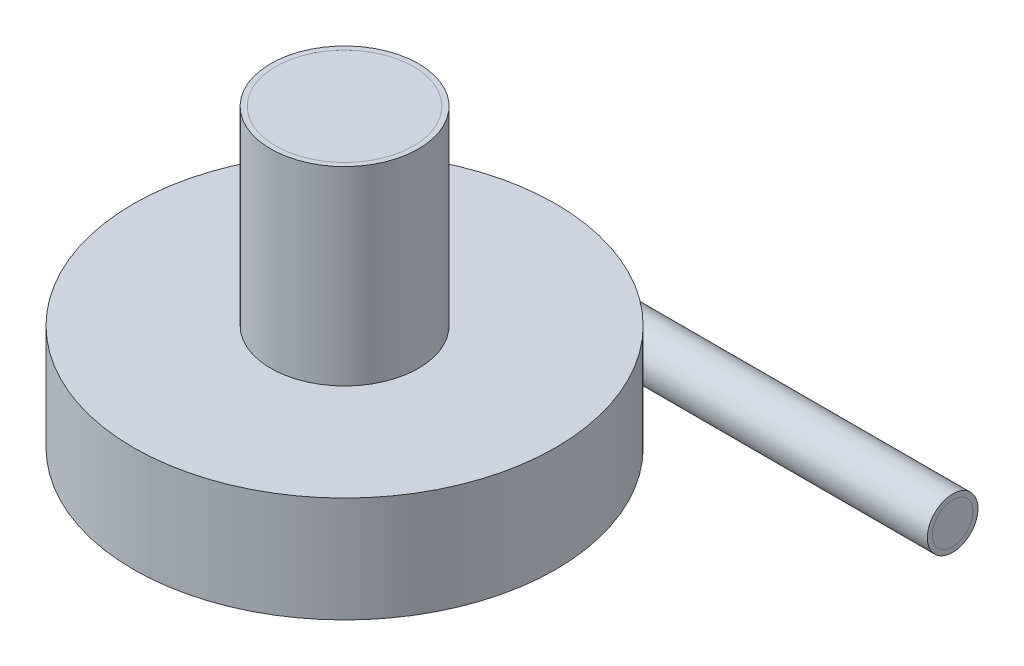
ISO-10303-21;
HEADER;
FILE_DESCRIPTION(('STEP AP214'),'2;1');
FILE_NAME('part.step','',(''),(''),'','','');
FILE_SCHEMA(('AUTOMOTIVE_DESIGN { 1 0 10303 214 1 1 1 1 }'));
ENDSEC;
DATA;
#1=APPLICATION_CONTEXT('core data for automotive mechanical design processes');
#2=APPLICATION_PROTOCOL_DEFINITION('international standard','automotive_design',2000,#1);
#3=PRODUCT_CONTEXT('',#1,'mechanical');
#4=PRODUCT('Part','Part','',(#3));
#5=PRODUCT_RELATED_PRODUCT_CATEGORY('part','',(#4));
#6=PRODUCT_DEFINITION_FORMATION('','',#4);
#7=PRODUCT_DEFINITION_CONTEXT('part definition',#1,'design');
#8=PRODUCT_DEFINITION('design','',#6,#7);
#9=PRODUCT_DEFINITION_SHAPE('','',#8);
#10=(LENGTH_UNIT() NAMED_UNIT(*) SI_UNIT(.MILLI.,.METRE.));
#11=(NAMED_UNIT(*) PLANE_ANGLE_UNIT() SI_UNIT($,.RADIAN.));
#12=(NAMED_UNIT(*) SI_UNIT($,.STERADIAN.) SOLID_ANGLE_UNIT());
#13=UNCERTAINTY_MEASURE_WITH_UNIT(LENGTH_MEASURE(1.E-05),#10,'distance_accuracy_value','');
#14=(GEOMETRIC_REPRESENTATION_CONTEXT(3) GLOBAL_UNCERTAINTY_ASSIGNED_CONTEXT((#13)) GLOBAL_UNIT_ASSIGNED_CONTEXT((#10,
#11,#12)) REPRESENTATION_CONTEXT('',''));
#15=CARTESIAN_POINT('',(0.,0.,0.));
#16=DIRECTION('',(0.,0.,1.));
#17=DIRECTION('',(1.,0.,0.));
#18=AXIS2_PLACEMENT_3D('',#15,#16,#17);
#19=CARTESIAN_POINT('',(0.,8.5,0.));
#20=DIRECTION('',(0.,-1.,0.));
#21=DIRECTION('',(0.,0.,-1.));
#22=AXIS2_PLACEMENT_3D('',#19,#20,#21);
#23=CYLINDRICAL_SURFACE('',#22,45.);
#24=CARTESIAN_POINT('',(0.,8.5,0.));
#25=DIRECTION('',(0.,1.,0.));
#26=DIRECTION('',(0.,0.,1.));
#27=AXIS2_PLACEMENT_3D('',#24,#25,#26);
#28=CIRCLE('',#27,45.);
#29=CARTESIAN_POINT('',(0.,8.5,45.));
#30=VERTEX_POINT('',#29);
#31=EDGE_CURVE('P0_E11',#30,#30,#28,.T.);
#32=ORIENTED_EDGE('',*,*,#31,.F.);
#33=EDGE_LOOP('',(#32));
#34=FACE_BOUND('',#33,.T.);
#35=CARTESIAN_POINT('',(0.,-8.5,0.));
#36=DIRECTION('',(0.,1.,0.));
#37=DIRECTION('',(0.,0.,1.));
#38=AXIS2_PLACEMENT_3D('',#35,#36,#37);
#39=CIRCLE('',#38,45.);
#40=CARTESIAN_POINT('',(0.,-8.5,45.));
#41=VERTEX_POINT('',#40);
#42=EDGE_CURVE('P0_E63',#41,#41,#39,.T.);
#43=ORIENTED_EDGE('',*,*,#42,.T.);
#44=EDGE_LOOP('',(#43));
#45=FACE_BOUND('',#44,.T.);
#46=ADVANCED_FACE('P0_F60',(#34,#45),#23,.T.);
#47=CARTESIAN_POINT('',(0.,8.5,0.));
#48=DIRECTION('',(0.,1.,0.));
#49=DIRECTION('',(0.,0.,1.));
#50=AXIS2_PLACEMENT_3D('',#47,#48,#49);
#51=PLANE('',#50);
#52=ORIENTED_EDGE('',*,*,#31,.T.);
#53=EDGE_LOOP('',(#52));
#54=FACE_BOUND('',#53,.T.);
#55=ADVANCED_FACE('P0_F77',(#54),#51,.T.);
#56=CARTESIAN_POINT('',(0.,-8.5,0.));
#57=DIRECTION('',(0.,1.,0.));
#58=DIRECTION('',(0.,0.,1.));
#59=AXIS2_PLACEMENT_3D('',#56,#57,#58);
#60=PLANE('',#59);
#61=ORIENTED_EDGE('',*,*,#42,.F.);
#62=EDGE_LOOP('',(#61));
#63=FACE_BOUND('',#62,.T.);
#64=ADVANCED_FACE('P0_F75',(#63),#60,.F.);
#65=CLOSED_SHELL('',(#46,#55,#64));
#66=MANIFOLD_SOLID_BREP('P0_B2',#65);
#67=CARTESIAN_POINT('',(0.,12.5,0.));
#68=DIRECTION('',(0.,-1.,0.));
#69=DIRECTION('',(0.,0.,-1.));
#70=AXIS2_PLACEMENT_3D('',#67,#68,#69);
#71=CYLINDRICAL_SURFACE('',#70,50.);
#72=CARTESIAN_POINT('',(0.,0.,-50.));
#73=CARTESIAN_POINT('',(-3.25265267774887E-08,0.000188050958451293,-50.));
#74=CARTESIAN_POINT('',(0.000892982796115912,0.00037610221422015,-49.9999999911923));
#75=CARTESIAN_POINT('',(0.00302240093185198,0.000922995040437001,-49.9999999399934));
#76=CARTESIAN_POINT('',(0.00383500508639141,0.00128196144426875,-49.9999998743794));
#77=CARTESIAN_POINT('',(0.00733349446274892,0.00269011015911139,-49.999999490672));
#78=CARTESIAN_POINT('',(0.0106108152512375,0.00373587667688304,-49.9999989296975));
#79=CARTESIAN_POINT('',(0.0238182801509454,0.00806237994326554,-49.9999954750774));
#80=CARTESIAN_POINT('',(0.0330221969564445,0.0113506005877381,-49.9999901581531));
#81=CARTESIAN_POINT('',(0.16788006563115,0.0593606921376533,-49.9998731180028));
#82=CARTESIAN_POINT('',(0.299349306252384,0.104022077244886,-49.9992648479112));
#83=CARTESIAN_POINT('',(0.561178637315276,0.194048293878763,-49.9970326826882));
#84=CARTESIAN_POINT('',(0.691490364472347,0.239413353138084,-49.995393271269));
#85=CARTESIAN_POINT('',(0.95426746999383,0.330553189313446,-49.9910631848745));
#86=CARTESIAN_POINT('',(1.08674136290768,0.376327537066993,-49.9883621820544));
#87=CARTESIAN_POINT('',(1.3509110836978,0.467639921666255,-49.9819226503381));
#88=CARTESIAN_POINT('',(1.48260787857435,0.513178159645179,-49.9781884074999));
#89=CARTESIAN_POINT('',(1.86648547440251,0.64579991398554,-49.9657856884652));
#90=CARTESIAN_POINT('',(2.11871090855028,0.732792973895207,-49.9557278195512));
#91=CARTESIAN_POINT('',(2.62201957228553,0.906053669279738,-49.9318363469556));
#92=CARTESIAN_POINT('',(2.87310320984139,0.992322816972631,-49.9180185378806));
#93=CARTESIAN_POINT('',(3.40662035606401,1.17514448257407,-49.8846169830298));
#94=CARTESIAN_POINT('',(3.6890458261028,1.27163317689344,-49.8645281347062));
#95=CARTESIAN_POINT('',(4.2540985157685,1.46394174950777,-49.8195049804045));
#96=CARTESIAN_POINT('',(4.53672558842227,1.55976072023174,-49.7945650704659));
#97=CARTESIAN_POINT('',(5.39013987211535,1.84772658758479,-49.7119233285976));
#98=CARTESIAN_POINT('',(5.96072456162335,2.03841018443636,-49.6467568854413));
#99=CARTESIAN_POINT('',(6.94688356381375,2.36354701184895,-49.5168343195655));
#100=CARTESIAN_POINT('',(7.36266317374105,2.49926576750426,-49.4567298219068));
#101=CARTESIAN_POINT('',(8.19262020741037,2.76686591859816,-49.3260275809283));
#102=CARTESIAN_POINT('',(8.60679901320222,2.89875621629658,-49.2554569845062));
#103=CARTESIAN_POINT('',(9.42480826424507,3.15536087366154,-49.1054155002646));
#104=CARTESIAN_POINT('',(9.82865398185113,3.28017094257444,-49.0261916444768));
#105=CARTESIAN_POINT('',(10.6358813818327,3.52527416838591,-48.857426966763));
#106=CARTESIAN_POINT('',(11.0392625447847,3.64556411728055,-48.767878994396));
#107=CARTESIAN_POINT('',(11.9006166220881,3.89701691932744,-48.5653896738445));
#108=CARTESIAN_POINT('',(12.3584614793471,4.0273974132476,-48.450924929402));
#109=CARTESIAN_POINT('',(13.2727114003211,4.28009859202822,-48.2084924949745));
#110=CARTESIAN_POINT('',(13.729116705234,4.4024207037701,-48.0805272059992));
#111=CARTESIAN_POINT('',(14.6437250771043,4.63862546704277,-47.8099408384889));
#112=CARTESIAN_POINT('',(15.1019159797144,4.75243799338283,-47.6672171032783));
#113=CARTESIAN_POINT('',(16.0163180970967,4.96910807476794,-47.3678054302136));
#114=CARTESIAN_POINT('',(16.4725293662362,5.07196593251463,-47.2111178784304));
#115=CARTESIAN_POINT('',(17.4122152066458,5.27131282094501,-46.8730203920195));
#116=CARTESIAN_POINT('',(17.8955318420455,5.36695172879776,-46.6906651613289));
#117=CARTESIAN_POINT('',(18.8589325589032,5.5414909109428,-46.3099227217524));
#118=CARTESIAN_POINT('',(19.3390164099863,5.62039000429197,-46.1115343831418));
#119=CARTESIAN_POINT('',(20.2938809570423,5.75842231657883,-45.6993225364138));
#120=CARTESIAN_POINT('',(20.7686723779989,5.81760766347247,-45.4855415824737));
#121=CARTESIAN_POINT('',(21.713143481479,5.91311572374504,-45.0423288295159));
#122=CARTESIAN_POINT('',(22.1828244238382,5.94944420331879,-44.8129009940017));
#123=CARTESIAN_POINT('',(23.1108944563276,5.99491551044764,-44.3413420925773));
#124=CARTESIAN_POINT('',(23.5693504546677,6.00434218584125,-44.0993713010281));
#125=CARTESIAN_POINT('',(24.4785896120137,5.99192225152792,-43.6012299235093));
#126=CARTESIAN_POINT('',(24.9293684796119,5.97005869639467,-43.3450517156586));
#127=CARTESIAN_POINT('',(25.5940229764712,5.90948845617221,-42.9535897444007));
#128=CARTESIAN_POINT('',(25.8119842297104,5.88496815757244,-42.8229587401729));
#129=CARTESIAN_POINT('',(26.2448978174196,5.82596374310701,-42.5590126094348));
#130=CARTESIAN_POINT('',(26.4598505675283,5.79148101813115,-42.4256978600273));
#131=CARTESIAN_POINT('',(26.8860917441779,5.71161176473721,-42.1568679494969));
#132=CARTESIAN_POINT('',(27.0973829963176,5.6662340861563,-42.0213546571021));
#133=CARTESIAN_POINT('',(27.515823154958,5.56347353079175,-41.748554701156));
#134=CARTESIAN_POINT('',(27.7229729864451,5.50609336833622,-41.6112684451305));
#135=CARTESIAN_POINT('',(28.1038680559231,5.38701314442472,-41.3547788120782));
#136=CARTESIAN_POINT('',(28.2782464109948,5.32702870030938,-41.2357208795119));
#137=CARTESIAN_POINT('',(28.6227694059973,5.19638708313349,-40.9973284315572));
#138=CARTESIAN_POINT('',(28.7929143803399,5.12573075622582,-40.8779939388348));
#139=CARTESIAN_POINT('',(29.1288245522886,4.97252438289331,-40.6393180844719));
#140=CARTESIAN_POINT('',(29.2945720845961,4.88993305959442,-40.5199781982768));
#141=CARTESIAN_POINT('',(29.6201129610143,4.71201508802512,-40.2826200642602));
#142=CARTESIAN_POINT('',(29.7799062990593,4.61668842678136,-40.164601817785));
#143=CARTESIAN_POINT('',(30.0942253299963,4.41099507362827,-39.9296449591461));
#144=CARTESIAN_POINT('',(30.2486654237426,4.30046250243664,-39.8127360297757));
#145=CARTESIAN_POINT('',(30.5487377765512,4.06409775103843,-39.5829550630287));
#146=CARTESIAN_POINT('',(30.6943681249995,3.93826226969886,-39.4700839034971));
#147=CARTESIAN_POINT('',(30.9743804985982,3.67071772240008,-39.2507230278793));
#148=CARTESIAN_POINT('',(31.1087996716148,3.52906503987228,-39.1442125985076));
#149=CARTESIAN_POINT('',(31.3644453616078,3.22894755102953,-38.9396759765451));
#150=CARTESIAN_POINT('',(31.4856826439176,3.07049667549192,-38.8416428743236));
#151=CARTESIAN_POINT('',(31.731728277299,2.70758049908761,-38.6409975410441));
#152=CARTESIAN_POINT('',(31.8535950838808,2.49988152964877,-38.5404742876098));
#153=CARTESIAN_POINT('',(32.0158569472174,2.17179389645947,-38.4055973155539));
#154=CARTESIAN_POINT('',(32.0665338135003,2.05963714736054,-38.3632788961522));
#155=CARTESIAN_POINT('',(32.1603498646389,1.8302006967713,-38.2846657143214));
#156=CARTESIAN_POINT('',(32.2034926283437,1.71292346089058,-38.2483680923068));
#157=CARTESIAN_POINT('',(32.2819385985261,1.47264657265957,-38.1821831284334));
#158=CARTESIAN_POINT('',(32.3171610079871,1.34960217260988,-38.1523619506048));
#159=CARTESIAN_POINT('',(32.378555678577,1.09976506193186,-38.1002723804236));
#160=CARTESIAN_POINT('',(32.4047325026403,0.972974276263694,-38.0780001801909));
#161=CARTESIAN_POINT('',(32.4475121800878,0.716694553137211,-38.0415528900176));
#162=CARTESIAN_POINT('',(32.4641194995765,0.587206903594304,-38.0273740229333));
#163=CARTESIAN_POINT('',(32.4874109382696,0.326701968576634,-38.0074778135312));
#164=CARTESIAN_POINT('',(32.4940963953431,0.195684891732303,-38.001759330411));
#165=CARTESIAN_POINT('',(32.4971892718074,-0.0499490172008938,-37.999114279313));
#166=CARTESIAN_POINT('',(32.4947905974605,-0.164542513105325,-38.0011664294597));
#167=CARTESIAN_POINT('',(32.4823568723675,-0.393047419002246,-38.0117950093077));
#168=CARTESIAN_POINT('',(32.4723194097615,-0.506958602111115,-38.0203734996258));
#169=CARTESIAN_POINT('',(32.4447788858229,-0.733165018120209,-38.0438779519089));
#170=CARTESIAN_POINT('',(32.4272788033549,-0.845460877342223,-38.0588013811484));
#171=CARTESIAN_POINT('',(32.3851066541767,-1.06773077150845,-38.0946929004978));
#172=CARTESIAN_POINT('',(32.3604317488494,-1.17770386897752,-38.1156633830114));
#173=CARTESIAN_POINT('',(32.277491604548,-1.49800447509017,-38.1859757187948));
#174=CARTESIAN_POINT('',(32.2096112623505,-1.70420090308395,-38.2433215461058));
#175=CARTESIAN_POINT('',(32.0513247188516,-2.10130718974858,-38.3760761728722));
#176=CARTESIAN_POINT('',(31.9609107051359,-2.29221171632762,-38.4514912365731));
#177=CARTESIAN_POINT('',(31.7129342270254,-2.74502936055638,-38.6565187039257));
#178=CARTESIAN_POINT('',(31.5440068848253,-2.9968433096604,-38.7947378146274));
#179=CARTESIAN_POINT('',(31.174788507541,-3.46249641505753,-39.0920563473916));
#180=CARTESIAN_POINT('',(30.9744170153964,-3.67623506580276,-39.2512091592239));
#181=CARTESIAN_POINT('',(30.6040378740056,-4.01840420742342,-39.5402772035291));
#182=CARTESIAN_POINT('',(30.4390762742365,-4.15476753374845,-39.6674727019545));
#183=CARTESIAN_POINT('',(30.0986362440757,-4.40894120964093,-39.9264049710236));
#184=CARTESIAN_POINT('',(29.9231525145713,-4.52674210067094,-40.0581440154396));
#185=CARTESIAN_POINT('',(29.563795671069,-4.74523661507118,-40.3240865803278));
#186=CARTESIAN_POINT('',(29.3799248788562,-4.84593493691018,-40.4582894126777));
#187=CARTESIAN_POINT('',(29.0052182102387,-5.03182366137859,-40.7277627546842));
#188=CARTESIAN_POINT('',(28.8143799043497,-5.11700859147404,-40.8630336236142));
#189=CARTESIAN_POINT('',(28.2962757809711,-5.32600043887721,-41.2247129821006));
#190=CARTESIAN_POINT('',(27.9638106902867,-5.43710351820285,-41.4510529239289));
#191=CARTESIAN_POINT('',(27.2868467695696,-5.62569182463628,-41.8998010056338));
#192=CARTESIAN_POINT('',(26.9423393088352,-5.70315238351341,-42.1222061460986));
#193=CARTESIAN_POINT('',(26.2407391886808,-5.82989615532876,-42.5628585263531));
#194=CARTESIAN_POINT('',(25.8835550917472,-5.87888965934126,-42.7810418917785));
#195=CARTESIAN_POINT('',(25.1621044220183,-5.95163505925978,-43.2093101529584));
#196=CARTESIAN_POINT('',(24.7978404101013,-5.97539591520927,-43.4193978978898));
#197=CARTESIAN_POINT('',(24.0919462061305,-6.00014864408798,-43.8147113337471));
#198=CARTESIAN_POINT('',(23.7507408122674,-6.00275733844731,-44.000604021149));
#199=CARTESIAN_POINT('',(23.0642590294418,-5.99169333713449,-44.3642973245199));
#200=CARTESIAN_POINT('',(22.7189819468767,-5.97801782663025,-44.542096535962));
#201=CARTESIAN_POINT('',(22.0244502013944,-5.93627166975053,-44.8895828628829));
#202=CARTESIAN_POINT('',(21.6751893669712,-5.90817446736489,-45.0592543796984));
#203=CARTESIAN_POINT('',(20.9738948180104,-5.83922856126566,-45.3899336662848));
#204=CARTESIAN_POINT('',(20.62186122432,-5.79838041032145,-45.5509418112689));
#205=CARTESIAN_POINT('',(19.5917374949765,-5.66278596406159,-46.0077363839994));
#206=CARTESIAN_POINT('',(18.9103819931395,-5.55294459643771,-46.2918715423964));
#207=CARTESIAN_POINT('',(17.8854663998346,-5.36367147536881,-46.6930823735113));
#208=CARTESIAN_POINT('',(17.5442109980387,-5.29669460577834,-46.8223594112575));
#209=CARTESIAN_POINT('',(16.8602373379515,-5.15533989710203,-47.0729755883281));
#210=CARTESIAN_POINT('',(16.5175188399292,-5.08096079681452,-47.1943133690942));
#211=CARTESIAN_POINT('',(15.6030631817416,-4.87403922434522,-47.5069336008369));
#212=CARTESIAN_POINT('',(15.0302418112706,-4.73564834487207,-47.6912099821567));
#213=CARTESIAN_POINT('',(13.8822540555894,-4.44370067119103,-48.0379265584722));
#214=CARTESIAN_POINT('',(13.3070890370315,-4.29015176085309,-48.2003780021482));
#215=CARTESIAN_POINT('',(12.1416273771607,-3.9668117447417,-48.5072381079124));
#216=CARTESIAN_POINT('',(11.5512821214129,-3.79673234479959,-48.6511569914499));
#217=CARTESIAN_POINT('',(10.3673194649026,-3.44532983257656,-48.9171519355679));
#218=CARTESIAN_POINT('',(9.77369756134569,-3.26397925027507,-49.039171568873));
#219=CARTESIAN_POINT('',(8.77878030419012,-2.95309995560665,-49.2249845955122));
#220=CARTESIAN_POINT('',(8.3778525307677,-2.82594311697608,-49.2947943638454));
#221=CARTESIAN_POINT('',(7.57533481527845,-2.5682280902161,-49.4244834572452));
#222=CARTESIAN_POINT('',(7.17374470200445,-2.43766882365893,-49.4843595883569));
#223=CARTESIAN_POINT('',(6.37422787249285,-2.17510180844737,-49.5936523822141));
#224=CARTESIAN_POINT('',(5.97630552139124,-2.04312237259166,-49.6431694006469));
#225=CARTESIAN_POINT('',(5.18058032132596,-1.77710267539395,-49.7325011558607));
#226=CARTESIAN_POINT('',(4.78277788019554,-1.64306501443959,-49.7723272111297));
#227=CARTESIAN_POINT('',(4.03124398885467,-1.38829692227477,-49.8384904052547));
#228=CARTESIAN_POINT('',(3.67753759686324,-1.26774667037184,-49.8658357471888));
#229=CARTESIAN_POINT('',(2.96842894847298,-1.02512272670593,-49.913075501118));
#230=CARTESIAN_POINT('',(2.61302578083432,-0.903044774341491,-49.9329383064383));
#231=CARTESIAN_POINT('',(2.07208464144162,-0.71667625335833,-49.957393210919));
#232=CARTESIAN_POINT('',(1.88649924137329,-0.652636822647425,-49.9647475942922));
#233=CARTESIAN_POINT('',(1.51421015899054,-0.524153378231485,-49.9774115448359));
#234=CARTESIAN_POINT('',(1.32750502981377,-0.459708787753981,-49.9827125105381));
#235=CARTESIAN_POINT('',(0.957177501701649,-0.331350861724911,-49.9911851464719));
#236=CARTESIAN_POINT('',(0.773542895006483,-0.267438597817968,-49.9943774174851));
#237=CARTESIAN_POINT('',(0.404513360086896,-0.14059286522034,-49.9986835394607));
#238=CARTESIAN_POINT('',(0.219188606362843,-0.0776594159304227,-49.999828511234));
#239=CARTESIAN_POINT('',(0.0330254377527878,-0.0113500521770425,-49.9999901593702));
#240=CARTESIAN_POINT('',(0.0238160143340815,-0.00806137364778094,-49.999995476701));
#241=CARTESIAN_POINT('',(0.0106074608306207,-0.00373475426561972,-49.9999989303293));
#242=CARTESIAN_POINT('',(0.00733156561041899,-0.00268936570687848,-49.9999994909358));
#243=CARTESIAN_POINT('',(0.00383420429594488,-0.00128169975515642,-49.9999998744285));
#244=CARTESIAN_POINT('',(0.00302177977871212,-0.000922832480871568,-49.9999999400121));
#245=CARTESIAN_POINT('',(0.000892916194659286,-0.000376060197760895,-49.9999999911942));
#246=CARTESIAN_POINT('',(3.25229444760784E-08,-0.000188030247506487,-50.));
#247=CARTESIAN_POINT('',(0.,0.,-50.));
#248=B_SPLINE_CURVE_WITH_KNOTS('',3,(#72,#73,#74,#75,#76,#77,#78,#79,#80,#81,#82,#83,#84,#85,
#86,#87,#88,#89,#90,#91,#92,#93,#94,#95,#96,#97,#98,#99,#100,#101,#102,#103,#104,#105,#106,#107,
#108,#109,#110,#111,#112,#113,#114,#115,#116,#117,#118,#119,#120,#121,#122,#123,#124,#125,#126,
#127,#128,#129,#130,#131,#132,#133,#134,#135,#136,#137,#138,#139,#140,#141,#142,#143,#144,#145,
#146,#147,#148,#149,#150,#151,#152,#153,#154,#155,#156,#157,#158,#159,#160,#161,#162,#163,#164,
#165,#166,#167,#168,#169,#170,#171,#172,#173,#174,#175,#176,#177,#178,#179,#180,#181,#182,#183,
#184,#185,#186,#187,#188,#189,#190,#191,#192,#193,#194,#195,#196,#197,#198,#199,#200,#201,#202,
#203,#204,#205,#206,#207,#208,#209,#210,#211,#212,#213,#214,#215,#216,#217,#218,#219,#220,#221,
#222,#223,#224,#225,#226,#227,#228,#229,#230,#231,#232,#233,#234,#235,#236,#237,#238,#239,#240,
#241,#242,#243,#244,#245,#246,#247),.UNSPECIFIED.,.T.,.F.,(4,2,2,2,2,2,2,2,2,2,2,2,2,2,2,2,2,2,
2,2,2,2,2,2,2,2,2,2,2,2,2,2,2,2,2,2,2,2,2,2,2,2,2,2,2,2,2,2,2,2,2,2,2,2,2,2,2,2,2,2,2,2,2,2,2,2,
2,2,2,2,2,2,2,2,2,2,2,2,2,2,2,2,2,2,2,2,2,4),(0.,0.00172051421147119,0.00500236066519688,
0.0146106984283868,0.0447213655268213,0.454289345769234,0.870172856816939,1.29020668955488,
1.70852361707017,2.50938654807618,3.30693584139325,4.20426985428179,5.10264669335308,
6.9176190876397,8.24193469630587,9.56287350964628,10.8528889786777,12.1438033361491,
13.6124014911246,15.0807389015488,16.5600814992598,18.0393832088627,19.6149574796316,
21.190642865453,22.7621280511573,24.3332166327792,25.8876658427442,27.4429571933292,
28.2086432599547,28.9742224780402,29.7391819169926,30.5039685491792,31.1622044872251,
31.8203882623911,32.4809053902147,33.1414231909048,33.8098219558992,34.4783651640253,
35.1445970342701,35.8102806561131,36.5899207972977,36.9799849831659,37.3698633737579,
37.7635547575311,38.1570472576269,38.550355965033,38.943611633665,39.2870876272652,
39.6306721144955,39.9741195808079,40.3177031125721,40.9883763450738,41.6592824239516,
42.6534084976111,43.6501210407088,44.3960385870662,45.1423349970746,45.8884260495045,
46.6347797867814,47.8845438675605,49.1352227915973,50.3984164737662,51.6611614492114,
52.8263784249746,53.9917968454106,55.1593689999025,56.326890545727,58.5639589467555,
59.6768981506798,60.7900273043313,62.6416877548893,64.4923901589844,66.3848482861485,
68.282114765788,69.5610841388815,70.8404639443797,72.1068081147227,73.3716660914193,
74.4956798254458,75.6243895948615,76.2139470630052,76.80594806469,77.3920764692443,
77.9692169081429,77.9993321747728,78.0089370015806,78.0122179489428,78.0139382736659),.UNSPECIFIED.);
#249=CARTESIAN_POINT('',(0.,0.,-50.));
#250=VERTEX_POINT('',#249);
#251=EDGE_CURVE('P0_E149',#250,#250,#248,.T.);
#252=ORIENTED_EDGE('',*,*,#251,.F.);
#253=EDGE_LOOP('',(#252));
#254=FACE_BOUND('',#253,.T.);
#255=CARTESIAN_POINT('',(0.,12.5,0.));
#256=DIRECTION('',(0.,1.,0.));
#257=DIRECTION('',(0.,0.,1.));
#258=AXIS2_PLACEMENT_3D('',#255,#256,#257);
#259=CIRCLE('',#258,50.);
#260=CARTESIAN_POINT('',(0.,12.5,50.));
#261=VERTEX_POINT('',#260);
#262=EDGE_CURVE('P0_E143',#261,#261,#259,.T.);
#263=ORIENTED_EDGE('',*,*,#262,.F.);
#264=EDGE_LOOP('',(#263));
#265=FACE_BOUND('',#264,.T.);
#266=CARTESIAN_POINT('',(0.,-12.5,0.));
#267=DIRECTION('',(0.,1.,0.));
#268=DIRECTION('',(0.,0.,1.));
#269=AXIS2_PLACEMENT_3D('',#266,#267,#268);
#270=CIRCLE('',#269,50.);
#271=CARTESIAN_POINT('',(0.,-12.5,50.));
#272=VERTEX_POINT('',#271);
#273=EDGE_CURVE('P0_E138',#272,#272,#270,.T.);
#274=ORIENTED_EDGE('',*,*,#273,.T.);
#275=EDGE_LOOP('',(#274));
#276=FACE_BOUND('',#275,.T.);
#277=ADVANCED_FACE('P0_F135',(#254,#265,#276),#71,.T.);
#278=CARTESIAN_POINT('',(0.,12.5,0.));
#279=DIRECTION('',(0.,1.,0.));
#280=DIRECTION('',(0.,0.,1.));
#281=AXIS2_PLACEMENT_3D('',#278,#279,#280);
#282=PLANE('',#281);
#283=CARTESIAN_POINT('',(0.,12.5,0.));
#284=DIRECTION('',(0.,1.,0.));
#285=DIRECTION('',(0.,0.,1.));
#286=AXIS2_PLACEMENT_3D('',#283,#284,#285);
#287=CIRCLE('',#286,17.5);
#288=CARTESIAN_POINT('',(0.,12.5,-17.5));
#289=VERTEX_POINT('',#288);
#290=EDGE_CURVE('P0_E58',#289,#289,#287,.T.);
#291=ORIENTED_EDGE('',*,*,#290,.F.);
#292=EDGE_LOOP('',(#291));
#293=FACE_BOUND('',#292,.T.);
#294=ORIENTED_EDGE('',*,*,#262,.T.);
#295=EDGE_LOOP('',(#294));
#296=FACE_BOUND('',#295,.T.);
#297=ADVANCED_FACE('P0_F221',(#293,#296),#282,.T.);
#298=CARTESIAN_POINT('',(0.,-12.5,0.));
#299=DIRECTION('',(0.,1.,0.));
#300=DIRECTION('',(0.,0.,1.));
#301=AXIS2_PLACEMENT_3D('',#298,#299,#300);
#302=PLANE('',#301);
#303=ORIENTED_EDGE('',*,*,#273,.F.);
#304=EDGE_LOOP('',(#303));
#305=FACE_BOUND('',#304,.T.);
#306=ADVANCED_FACE('P0_F218',(#305),#302,.F.);
#307=CARTESIAN_POINT('',(0.,57.5,0.));
#308=DIRECTION('',(0.,-1.,0.));
#309=DIRECTION('',(0.,0.,-1.));
#310=AXIS2_PLACEMENT_3D('',#307,#308,#309);
#311=CYLINDRICAL_SURFACE('',#310,17.5);
#312=CARTESIAN_POINT('',(0.,57.5,0.));
#313=DIRECTION('',(0.,1.,0.));
#314=DIRECTION('',(0.,0.,1.));
#315=AXIS2_PLACEMENT_3D('',#312,#313,#314);
#316=CIRCLE('',#315,17.5);
#317=CARTESIAN_POINT('',(0.,57.5,-17.5));
#318=VERTEX_POINT('',#317);
#319=EDGE_CURVE('P0_E209',#318,#318,#316,.T.);
#320=CARTESIAN_POINT('',(0.,57.5,-17.5));
#321=CARTESIAN_POINT('',(0.,57.03125,-17.5));
#322=CARTESIAN_POINT('',(0.,56.5625,-17.5));
#323=CARTESIAN_POINT('',(0.,55.625,-17.5));
#324=CARTESIAN_POINT('',(0.,55.15625,-17.5));
#325=CARTESIAN_POINT('',(0.,54.21875,-17.5));
#326=CARTESIAN_POINT('',(0.,53.75,-17.5));
#327=CARTESIAN_POINT('',(0.,52.8125,-17.5));
#328=CARTESIAN_POINT('',(0.,52.34375,-17.5));
#329=CARTESIAN_POINT('',(0.,51.40625,-17.5));
#330=CARTESIAN_POINT('',(0.,50.9375,-17.5));
#331=CARTESIAN_POINT('',(0.,50.,-17.5));
#332=CARTESIAN_POINT('',(0.,49.53125,-17.5));
#333=CARTESIAN_POINT('',(0.,48.59375,-17.5));
#334=CARTESIAN_POINT('',(0.,48.125,-17.5));
#335=CARTESIAN_POINT('',(0.,47.1875,-17.5));
#336=CARTESIAN_POINT('',(0.,46.71875,-17.5));
#337=CARTESIAN_POINT('',(0.,45.78125,-17.5));
#338=CARTESIAN_POINT('',(0.,45.3125,-17.5));
#339=CARTESIAN_POINT('',(0.,44.375,-17.5));
#340=CARTESIAN_POINT('',(0.,43.90625,-17.5));
#341=CARTESIAN_POINT('',(0.,42.96875,-17.5));
#342=CARTESIAN_POINT('',(0.,42.5,-17.5));
#343=CARTESIAN_POINT('',(0.,41.5625,-17.5));
#344=CARTESIAN_POINT('',(0.,41.09375,-17.5));
#345=CARTESIAN_POINT('',(0.,40.15625,-17.5));
#346=CARTESIAN_POINT('',(0.,39.6875,-17.5));
#347=CARTESIAN_POINT('',(0.,38.75,-17.5));
#348=CARTESIAN_POINT('',(0.,38.28125,-17.5));
#349=CARTESIAN_POINT('',(0.,37.34375,-17.5));
#350=CARTESIAN_POINT('',(0.,36.875,-17.5));
#351=CARTESIAN_POINT('',(0.,35.9375,-17.5));
#352=CARTESIAN_POINT('',(0.,35.46875,-17.5));
#353=CARTESIAN_POINT('',(0.,34.53125,-17.5));
#354=CARTESIAN_POINT('',(0.,34.0625,-17.5));
#355=CARTESIAN_POINT('',(0.,33.125,-17.5));
#356=CARTESIAN_POINT('',(0.,32.65625,-17.5));
#357=CARTESIAN_POINT('',(0.,31.71875,-17.5));
#358=CARTESIAN_POINT('',(0.,31.25,-17.5));
#359=CARTESIAN_POINT('',(0.,30.3125,-17.5));
#360=CARTESIAN_POINT('',(0.,29.84375,-17.5));
#361=CARTESIAN_POINT('',(0.,28.90625,-17.5));
#362=CARTESIAN_POINT('',(0.,28.4375,-17.5));
#363=CARTESIAN_POINT('',(0.,27.5,-17.5));
#364=CARTESIAN_POINT('',(0.,27.03125,-17.5));
#365=CARTESIAN_POINT('',(0.,26.09375,-17.5));
#366=CARTESIAN_POINT('',(0.,25.625,-17.5));
#367=CARTESIAN_POINT('',(0.,24.6875,-17.5));
#368=CARTESIAN_POINT('',(0.,24.21875,-17.5));
#369=CARTESIAN_POINT('',(0.,23.28125,-17.5));
#370=CARTESIAN_POINT('',(0.,22.8125,-17.5));
#371=CARTESIAN_POINT('',(0.,21.875,-17.5));
#372=CARTESIAN_POINT('',(0.,21.40625,-17.5));
#373=CARTESIAN_POINT('',(0.,20.46875,-17.5));
#374=CARTESIAN_POINT('',(0.,20.,-17.5));
#375=CARTESIAN_POINT('',(0.,19.0625,-17.5));
#376=CARTESIAN_POINT('',(0.,18.59375,-17.5));
#377=CARTESIAN_POINT('',(0.,17.65625,-17.5));
#378=CARTESIAN_POINT('',(0.,17.1875,-17.5));
#379=CARTESIAN_POINT('',(0.,16.25,-17.5));
#380=CARTESIAN_POINT('',(0.,15.78125,-17.5));
#381=CARTESIAN_POINT('',(0.,14.84375,-17.5));
#382=CARTESIAN_POINT('',(0.,14.375,-17.5));
#383=CARTESIAN_POINT('',(0.,13.4375,-17.5));
#384=CARTESIAN_POINT('',(0.,12.96875,-17.5));
#385=CARTESIAN_POINT('',(0.,12.5,-17.5));
#386=B_SPLINE_CURVE_WITH_KNOTS('',3,(#320,#321,#322,#323,#324,#325,#326,#327,#328,#329,#330,
#331,#332,#333,#334,#335,#336,#337,#338,#339,#340,#341,#342,#343,#344,#345,#346,#347,#348,#349,
#350,#351,#352,#353,#354,#355,#356,#357,#358,#359,#360,#361,#362,#363,#364,#365,#366,#367,#368,
#369,#370,#371,#372,#373,#374,#375,#376,#377,#378,#379,#380,#381,#382,#383,#384,#385),
.UNSPECIFIED.,.F.,.F.,(4,2,2,2,2,2,2,2,2,2,2,2,2,2,2,2,2,2,2,2,2,2,2,2,2,2,2,2,2,2,2,2,4),(0.,
1.40625,2.8125,4.21874999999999,5.625,7.03125,8.43749999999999,9.84375,11.25,12.65625,14.0625,
15.46875,16.875,18.28125,19.6875,21.09375,22.5,23.90625,25.3125,26.71875,28.125,29.53125,
30.9375,32.34375,33.75,35.15625,36.5625,37.96875,39.375,40.78125,42.1875,43.59375,45.),.UNSPECIFIED.);
#387=EDGE_CURVE('P0_BSEAM220',#318,#289,#386,.T.);
#388=ORIENTED_EDGE('',*,*,#319,.F.);
#389=ORIENTED_EDGE('',*,*,#290,.T.);
#390=ORIENTED_EDGE('',*,*,#387,.T.);
#391=ORIENTED_EDGE('',*,*,#387,.F.);
#392=EDGE_LOOP('',(#388,#390,#389,#391));
#393=FACE_BOUND('',#392,.T.);
#394=ADVANCED_FACE('P0_F220',(#393),#311,.T.);
#395=CARTESIAN_POINT('',(0.,57.5,0.));
#396=DIRECTION('',(0.,1.,0.));
#397=DIRECTION('',(0.,0.,1.));
#398=AXIS2_PLACEMENT_3D('',#395,#396,#397);
#399=PLANE('',#398);
#400=CARTESIAN_POINT('',(0.,57.5,0.));
#401=DIRECTION('',(0.,1.,0.));
#402=DIRECTION('',(0.,0.,1.));
#403=AXIS2_PLACEMENT_3D('',#400,#401,#402);
#404=CIRCLE('',#403,16.3);
#405=CARTESIAN_POINT('',(0.,57.5,-16.3));
#406=VERTEX_POINT('',#405);
#407=EDGE_CURVE('P0_E160',#406,#406,#404,.T.);
#408=ORIENTED_EDGE('',*,*,#407,.F.);
#409=EDGE_LOOP('',(#408));
#410=FACE_BOUND('',#409,.T.);
#411=ORIENTED_EDGE('',*,*,#319,.T.);
#412=EDGE_LOOP('',(#411));
#413=FACE_BOUND('',#412,.T.);
#414=ADVANCED_FACE('P0_F193',(#410,#413),#399,.T.);
#415=CARTESIAN_POINT('',(-50.002,0.,-44.));
#416=DIRECTION('',(1.,0.,0.));
#417=DIRECTION('',(0.,0.,-1.));
#418=AXIS2_PLACEMENT_3D('',#415,#416,#417);
#419=CYLINDRICAL_SURFACE('',#418,5.99999999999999);
#420=CARTESIAN_POINT('',(100.,0.,-44.));
#421=DIRECTION('',(1.,0.,0.));
#422=DIRECTION('',(0.,0.,-1.));
#423=AXIS2_PLACEMENT_3D('',#420,#421,#422);
#424=CIRCLE('',#423,5.99999999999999);
#425=CARTESIAN_POINT('',(100.,0.,-50.));
#426=VERTEX_POINT('',#425);
#427=EDGE_CURVE('P0_E204',#426,#426,#424,.T.);
#428=ORIENTED_EDGE('',*,*,#427,.F.);
#429=EDGE_LOOP('',(#428));
#430=FACE_BOUND('',#429,.T.);
#431=ORIENTED_EDGE('',*,*,#251,.T.);
#432=EDGE_LOOP('',(#431));
#433=FACE_BOUND('',#432,.T.);
#434=ADVANCED_FACE('P0_F178',(#430,#433),#419,.T.);
#435=CARTESIAN_POINT('',(100.,0.,-44.));
#436=DIRECTION('',(1.,0.,0.));
#437=DIRECTION('',(0.,0.,-1.));
#438=AXIS2_PLACEMENT_3D('',#435,#436,#437);
#439=PLANE('',#438);
#440=CARTESIAN_POINT('',(100.,0.,-44.));
#441=DIRECTION('',(1.,0.,0.));
#442=DIRECTION('',(0.,0.,-1.));
#443=AXIS2_PLACEMENT_3D('',#440,#441,#442);
#444=CIRCLE('',#443,4.8);
#445=CARTESIAN_POINT('',(100.,0.,-48.8));
#446=VERTEX_POINT('',#445);
#447=EDGE_CURVE('P0_E157',#446,#446,#444,.T.);
#448=ORIENTED_EDGE('',*,*,#447,.F.);
#449=EDGE_LOOP('',(#448));
#450=FACE_BOUND('',#449,.T.);
#451=ORIENTED_EDGE('',*,*,#427,.T.);
#452=EDGE_LOOP('',(#451));
#453=FACE_BOUND('',#452,.T.);
#454=ADVANCED_FACE('P0_F177',(#450,#453),#439,.T.);
#455=CARTESIAN_POINT('',(0.,12.5,0.));
#456=DIRECTION('',(0.,-1.,0.));
#457=DIRECTION('',(0.,0.,-1.));
#458=AXIS2_PLACEMENT_3D('',#455,#456,#457);
#459=CYLINDRICAL_SURFACE('',#458,48.8);
#460=CARTESIAN_POINT('',(0.,0.,-48.8));
#461=CARTESIAN_POINT('',(2.82332285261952E-07,0.000166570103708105,-48.8));
#462=CARTESIAN_POINT('',(0.000872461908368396,0.000333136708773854,-48.7999999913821));
#463=CARTESIAN_POINT('',(0.00296849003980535,0.000819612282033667,-48.7999999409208));
#464=CARTESIAN_POINT('',(0.00377064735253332,0.00113875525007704,-48.7999998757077));
#465=CARTESIAN_POINT('',(0.00723824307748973,0.00239918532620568,-48.7999994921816));
#466=CARTESIAN_POINT('',(0.0104918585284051,0.00334256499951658,-48.7999989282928));
#467=CARTESIAN_POINT('',(0.023692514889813,0.00726615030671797,-48.799995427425));
#468=CARTESIAN_POINT('',(0.0329146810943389,0.0102437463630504,-48.7999899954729));
#469=CARTESIAN_POINT('',(0.246950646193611,0.0792028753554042,-48.7997999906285));
#470=CARTESIAN_POINT('',(0.461532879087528,0.145217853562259,-48.7982568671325));
#471=CARTESIAN_POINT('',(0.888851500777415,0.278196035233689,-48.7924011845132));
#472=CARTESIAN_POINT('',(1.1015038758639,0.345157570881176,-48.7880448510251));
#473=CARTESIAN_POINT('',(1.51850943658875,0.475859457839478,-48.7767834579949));
#474=CARTESIAN_POINT('',(1.72279784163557,0.539607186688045,-48.7700039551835));
#475=CARTESIAN_POINT('',(2.13012370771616,0.666604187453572,-48.7539161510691));
#476=CARTESIAN_POINT('',(2.33316280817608,0.729854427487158,-48.7446186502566));
#477=CARTESIAN_POINT('',(2.76524325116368,0.864120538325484,-48.7221289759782));
#478=CARTESIAN_POINT('',(2.99429158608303,0.935095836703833,-48.7085909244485));
#479=CARTESIAN_POINT('',(3.45256318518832,1.07664326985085,-48.6782565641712));
#480=CARTESIAN_POINT('',(3.68178633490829,1.14721482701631,-48.6614564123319));
#481=CARTESIAN_POINT('',(4.37411864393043,1.35950107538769,-48.6057910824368));
#482=CARTESIAN_POINT('',(4.83712687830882,1.50030275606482,-48.5619079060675));
#483=CARTESIAN_POINT('',(5.63326335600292,1.73964764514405,-48.4749297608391));
#484=CARTESIAN_POINT('',(5.96650699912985,1.83899818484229,-48.4350455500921));
#485=CARTESIAN_POINT('',(6.63184804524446,2.03534422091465,-48.3484316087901));
#486=CARTESIAN_POINT('',(6.96394617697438,2.13234516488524,-48.3017199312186));
#487=CARTESIAN_POINT('',(7.61961301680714,2.32151753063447,-48.2025798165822));
#488=CARTESIAN_POINT('',(7.94318999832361,2.41374906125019,-48.1503208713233));
#489=CARTESIAN_POINT('',(8.59020604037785,2.59556273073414,-48.0391110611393));
#490=CARTESIAN_POINT('',(8.91364481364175,2.68514282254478,-47.9801551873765));
#491=CARTESIAN_POINT('',(9.73283229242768,2.90823539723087,-47.8222447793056));
#492=CARTESIAN_POINT('',(10.2282907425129,3.0396415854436,-47.7187523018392));
#493=CARTESIAN_POINT('',(11.2178200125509,3.2935426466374,-47.4958701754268));
#494=CARTESIAN_POINT('',(11.7118910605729,3.41603907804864,-47.3764833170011));
#495=CARTESIAN_POINT('',(12.702883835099,3.65144164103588,-47.1204943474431));
#496=CARTESIAN_POINT('',(13.1997910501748,3.76425124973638,-46.9837466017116));
#497=CARTESIAN_POINT('',(14.1915855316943,3.9769428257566,-46.6937452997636));
#498=CARTESIAN_POINT('',(14.6864727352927,4.07682439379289,-46.540491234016));
#499=CARTESIAN_POINT('',(15.7048647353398,4.26702978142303,-46.2071646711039));
#500=CARTESIAN_POINT('',(16.2282052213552,4.35635305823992,-46.0260102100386));
#501=CARTESIAN_POINT('',(17.2712917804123,4.51409799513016,-45.6448341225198));
#502=CARTESIAN_POINT('',(17.7910372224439,4.58251607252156,-45.4448092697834));
#503=CARTESIAN_POINT('',(18.8238561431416,4.69386340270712,-45.0267862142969));
#504=CARTESIAN_POINT('',(19.3369473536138,4.7368874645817,-44.8088583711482));
#505=CARTESIAN_POINT('',(20.1016259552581,4.77845016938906,-44.4684439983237));
#506=CARTESIAN_POINT('',(20.3556465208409,4.78847577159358,-44.3527411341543));
#507=CARTESIAN_POINT('',(20.8618143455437,4.80002872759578,-44.1169198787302));
#508=CARTESIAN_POINT('',(21.1139617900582,4.80155693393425,-43.9968019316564));
#509=CARTESIAN_POINT('',(21.5901896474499,4.7954933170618,-43.764899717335));
#510=CARTESIAN_POINT('',(21.814484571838,4.78882514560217,-43.6535323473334));
#511=CARTESIAN_POINT('',(22.26105238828,4.76708964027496,-43.4275048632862));
#512=CARTESIAN_POINT('',(22.4833249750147,4.75202105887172,-43.312844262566));
#513=CARTESIAN_POINT('',(22.9244304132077,4.71266347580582,-43.080996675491));
#514=CARTESIAN_POINT('',(23.1432743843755,4.68841720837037,-42.9638237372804));
#515=CARTESIAN_POINT('',(23.578091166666,4.62965871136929,-42.7267475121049));
#516=CARTESIAN_POINT('',(23.7940639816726,4.59514649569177,-42.6068442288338));
#517=CARTESIAN_POINT('',(24.293060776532,4.50141102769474,-42.3248632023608));
#518=CARTESIAN_POINT('',(24.5747784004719,4.43779377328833,-42.1618831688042));
#519=CARTESIAN_POINT('',(25.1304302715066,4.28686114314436,-41.8330704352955));
#520=CARTESIAN_POINT('',(25.4043591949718,4.19952996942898,-41.667235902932));
#521=CARTESIAN_POINT('',(25.940557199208,3.99727896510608,-41.3355325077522));
#522=CARTESIAN_POINT('',(26.2028668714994,3.88246593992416,-41.1696662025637));
#523=CARTESIAN_POINT('',(26.5848473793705,3.68569380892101,-40.9232079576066));
#524=CARTESIAN_POINT('',(26.7101912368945,3.61605821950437,-40.8414918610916));
#525=CARTESIAN_POINT('',(26.9563645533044,3.46783573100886,-40.6794305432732));
#526=CARTESIAN_POINT('',(27.0771957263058,3.3892522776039,-40.599084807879));
#527=CARTESIAN_POINT('',(27.27967278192,3.24618758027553,-40.463190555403));
#528=CARTESIAN_POINT('',(27.36265144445,3.18409133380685,-40.4071154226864));
#529=CARTESIAN_POINT('',(27.525396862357,3.05463789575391,-40.296429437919));
#530=CARTESIAN_POINT('',(27.6051639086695,2.98728118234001,-40.2418184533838));
#531=CARTESIAN_POINT('',(27.8390075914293,2.77680444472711,-40.0807354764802));
#532=CARTESIAN_POINT('',(27.9876146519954,2.62528620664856,-39.977021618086));
#533=CARTESIAN_POINT('',(28.2664153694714,2.29606286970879,-39.7803862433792));
#534=CARTESIAN_POINT('',(28.3964027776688,2.11810323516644,-39.6875873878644));
#535=CARTESIAN_POINT('',(28.5703860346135,1.83245999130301,-39.5623333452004));
#536=CARTESIAN_POINT('',(28.6248713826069,1.73415134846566,-39.5229129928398));
#537=CARTESIAN_POINT('',(28.7257897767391,1.53156742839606,-39.4496244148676));
#538=CARTESIAN_POINT('',(28.7722266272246,1.42729500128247,-39.4157535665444));
#539=CARTESIAN_POINT('',(28.874233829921,1.16635633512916,-39.3411263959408));
#540=CARTESIAN_POINT('',(28.9249427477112,1.00668806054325,-39.3038184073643));
#541=CARTESIAN_POINT('',(28.9843110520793,0.761352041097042,-39.2600343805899));
#542=CARTESIAN_POINT('',(29.0013107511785,0.678672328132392,-39.2474747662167));
#543=CARTESIAN_POINT('',(29.0295046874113,0.511806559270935,-39.2266257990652));
#544=CARTESIAN_POINT('',(29.0407019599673,0.427621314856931,-39.218334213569));
#545=CARTESIAN_POINT('',(29.0539223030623,0.29093764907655,-39.2085403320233));
#546=CARTESIAN_POINT('',(29.0578175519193,0.238707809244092,-39.2056533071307));
#547=CARTESIAN_POINT('',(29.0633041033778,0.134048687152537,-39.2015862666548));
#548=CARTESIAN_POINT('',(29.0648948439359,0.0816193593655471,-39.2004066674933));
#549=CARTESIAN_POINT('',(29.0661042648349,-0.0662388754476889,-39.1995101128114));
#550=CARTESIAN_POINT('',(29.0630414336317,-0.16172262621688,-39.2017818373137));
#551=CARTESIAN_POINT('',(29.0492977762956,-0.351883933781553,-39.2119671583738));
#552=CARTESIAN_POINT('',(29.0386115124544,-0.446560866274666,-39.2198847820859));
#553=CARTESIAN_POINT('',(29.0098479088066,-0.634379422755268,-39.2411651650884));
#554=CARTESIAN_POINT('',(28.9917544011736,-0.727517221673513,-39.2545398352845));
#555=CARTESIAN_POINT('',(28.9486007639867,-0.911293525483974,-39.2863746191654));
#556=CARTESIAN_POINT('',(28.9235368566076,-1.0019306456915,-39.30483749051));
#557=CARTESIAN_POINT('',(28.8392205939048,-1.26729800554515,-39.3667903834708));
#558=CARTESIAN_POINT('',(28.7705114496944,-1.43753888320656,-39.4170928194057));
#559=CARTESIAN_POINT('',(28.6124751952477,-1.76251487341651,-39.531959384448));
#560=CARTESIAN_POINT('',(28.5231459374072,-1.91724836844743,-39.5965249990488));
#561=CARTESIAN_POINT('',(28.2805941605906,-2.28217062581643,-39.7703338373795));
#562=CARTESIAN_POINT('',(28.1174315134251,-2.48271036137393,-39.8860301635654));
#563=CARTESIAN_POINT('',(27.8540863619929,-2.758084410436,-40.0699586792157));
#564=CARTESIAN_POINT('',(27.763047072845,-2.84575386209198,-40.1331060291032));
#565=CARTESIAN_POINT('',(27.5756863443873,-3.01314334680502,-40.262071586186));
#566=CARTESIAN_POINT('',(27.4793658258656,-3.09286475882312,-40.3278893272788));
#567=CARTESIAN_POINT('',(27.2201437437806,-3.29278506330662,-40.5035974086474));
#568=CARTESIAN_POINT('',(27.0535670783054,-3.406798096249,-40.6151011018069));
#569=CARTESIAN_POINT('',(26.7114174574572,-3.61720264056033,-40.8409388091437));
#570=CARTESIAN_POINT('',(26.5358387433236,-3.71358268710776,-40.9552746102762));
#571=CARTESIAN_POINT('',(26.177354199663,-3.89085757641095,-41.1853322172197));
#572=CARTESIAN_POINT('',(25.9944336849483,-3.97171930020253,-41.3010564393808));
#573=CARTESIAN_POINT('',(25.6230027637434,-4.11951033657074,-41.5325131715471));
#574=CARTESIAN_POINT('',(25.4344902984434,-4.18643444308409,-41.6482456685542));
#575=CARTESIAN_POINT('',(25.068333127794,-4.30297736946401,-41.8695676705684));
#576=CARTESIAN_POINT('',(24.8910314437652,-4.35355432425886,-41.975225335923));
#577=CARTESIAN_POINT('',(24.5332701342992,-4.44523164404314,-42.185326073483));
#578=CARTESIAN_POINT('',(24.3528099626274,-4.48633035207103,-42.289768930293));
#579=CARTESIAN_POINT('',(23.8072598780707,-4.59682733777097,-42.6008154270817));
#580=CARTESIAN_POINT('',(23.43816870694,-4.6533750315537,-42.8050351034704));
#581=CARTESIAN_POINT('',(22.6934707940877,-4.73799644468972,-43.2044517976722));
#582=CARTESIAN_POINT('',(22.3178847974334,-4.76614815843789,-43.39967211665));
#583=CARTESIAN_POINT('',(21.5610812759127,-4.798788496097,-43.7805798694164));
#584=CARTESIAN_POINT('',(21.1798652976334,-4.80328350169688,-43.9662698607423));
#585=CARTESIAN_POINT('',(20.4288264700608,-4.79244829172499,-44.3200658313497));
#586=CARTESIAN_POINT('',(20.0591820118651,-4.77792792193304,-44.4885811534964));
#587=CARTESIAN_POINT('',(19.3165710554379,-4.7330152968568,-44.8160103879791));
#588=CARTESIAN_POINT('',(18.943603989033,-4.70262027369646,-44.974922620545));
#589=CARTESIAN_POINT('',(18.1946780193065,-4.62804957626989,-45.2830853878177));
#590=CARTESIAN_POINT('',(17.818716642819,-4.5838610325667,-45.4323267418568));
#591=CARTESIAN_POINT('',(17.0646388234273,-4.48350543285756,-45.7209042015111));
#592=CARTESIAN_POINT('',(16.6865224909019,-4.4273389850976,-45.860240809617));
#593=CARTESIAN_POINT('',(15.9174422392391,-4.30276330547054,-46.1329199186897));
#594=CARTESIAN_POINT('',(15.5264248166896,-4.23404520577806,-46.2659697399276));
#595=CARTESIAN_POINT('',(14.7427778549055,-4.08695586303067,-46.5216122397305));
#596=CARTESIAN_POINT('',(14.3501481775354,-4.00858377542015,-46.6442040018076));
#597=CARTESIAN_POINT('',(13.1711589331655,-3.76107689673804,-46.9960930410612));
#598=CARTESIAN_POINT('',(12.38273108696,-3.57938842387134,-47.2098465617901));
#599=CARTESIAN_POINT('',(10.8365926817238,-3.19925181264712,-47.587960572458));
#600=CARTESIAN_POINT('',(10.0790366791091,-3.00187553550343,-47.7540642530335));
#601=CARTESIAN_POINT('',(8.55929460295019,-2.58921899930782,-48.0497593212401));
#602=CARTESIAN_POINT('',(7.79710148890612,-2.37388942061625,-48.179245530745));
#603=CARTESIAN_POINT('',(6.34966735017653,-1.95361106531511,-48.3900830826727));
#604=CARTESIAN_POINT('',(5.6645875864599,-1.74987801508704,-48.4750189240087));
#605=CARTESIAN_POINT('',(4.30041340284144,-1.33764124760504,-48.6149332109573));
#606=CARTESIAN_POINT('',(3.6213286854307,-1.12920680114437,-48.6702065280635));
#607=CARTESIAN_POINT('',(2.74035285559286,-0.856379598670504,-48.7234165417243));
#608=CARTESIAN_POINT('',(2.53862283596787,-0.793741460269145,-48.734343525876));
#609=CARTESIAN_POINT('',(2.12947284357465,-0.666443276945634,-48.753957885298));
#610=CARTESIAN_POINT('',(1.92205093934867,-0.601775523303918,-48.7625743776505));
#611=CARTESIAN_POINT('',(1.56740892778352,-0.49100580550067,-48.775045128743));
#612=CARTESIAN_POINT('',(1.42016566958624,-0.444955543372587,-48.7795558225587));
#613=CARTESIAN_POINT('',(1.1269757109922,-0.353267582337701,-48.7872012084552));
#614=CARTESIAN_POINT('',(0.981031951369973,-0.307630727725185,-48.7903500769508));
#615=CARTESIAN_POINT('',(0.706260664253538,-0.221375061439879,-48.7950648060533));
#616=CARTESIAN_POINT('',(0.577330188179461,-0.18076113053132,-48.7967675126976));
#617=CARTESIAN_POINT('',(0.311018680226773,-0.0978323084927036,-48.7991893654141));
#618=CARTESIAN_POINT('',(0.173508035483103,-0.0555160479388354,-48.7998652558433));
#619=CARTESIAN_POINT('',(0.0329218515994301,-0.0102477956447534,-48.7999899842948));
#620=CARTESIAN_POINT('',(0.0237173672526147,-0.00727428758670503,-48.7999954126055));
#621=CARTESIAN_POINT('',(0.0105203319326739,-0.00335162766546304,-48.7999989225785));
#622=CARTESIAN_POINT('',(0.0072552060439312,-0.00240511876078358,-48.7999994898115));
#623=CARTESIAN_POINT('',(0.00377776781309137,-0.0011408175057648,-48.7999998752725));
#624=CARTESIAN_POINT('',(0.00297395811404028,-0.000820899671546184,-48.7999999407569));
#625=CARTESIAN_POINT('',(0.000873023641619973,-0.000333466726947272,-48.7999999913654));
#626=CARTESIAN_POINT('',(-2.82606035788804E-07,-0.000166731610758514,-48.8));
#627=CARTESIAN_POINT('',(0.,0.,-48.8));
#628=B_SPLINE_CURVE_WITH_KNOTS('',3,(#460,#461,#462,#463,#464,#465,#466,#467,#468,#469,#470,
#471,#472,#473,#474,#475,#476,#477,#478,#479,#480,#481,#482,#483,#484,#485,#486,#487,#488,#489,
#490,#491,#492,#493,#494,#495,#496,#497,#498,#499,#500,#501,#502,#503,#504,#505,#506,#507,#508,
#509,#510,#511,#512,#513,#514,#515,#516,#517,#518,#519,#520,#521,#522,#523,#524,#525,#526,#527,
#528,#529,#530,#531,#532,#533,#534,#535,#536,#537,#538,#539,#540,#541,#542,#543,#544,#545,#546,
#547,#548,#549,#550,#551,#552,#553,#554,#555,#556,#557,#558,#559,#560,#561,#562,#563,#564,#565,
#566,#567,#568,#569,#570,#571,#572,#573,#574,#575,#576,#577,#578,#579,#580,#581,#582,#583,#584,
#585,#586,#587,#588,#589,#590,#591,#592,#593,#594,#595,#596,#597,#598,#599,#600,#601,#602,#603,
#604,#605,#606,#607,#608,#609,#610,#611,#612,#613,#614,#615,#616,#617,#618,#619,#620,#621,#622,
#623,#624,#625,#626,#627),.UNSPECIFIED.,.T.,.F.,(4,2,2,2,2,2,2,2,2,2,2,2,2,2,2,2,2,2,2,2,2,2,2,
2,2,2,2,2,2,2,2,2,2,2,2,2,2,2,2,2,2,2,2,2,2,2,2,2,2,2,2,2,2,2,2,2,2,2,2,2,2,2,2,2,2,2,2,2,2,2,2,
2,2,2,2,2,2,2,2,2,2,2,2,4),(0.,0.00166555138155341,0.00487269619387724,0.0143211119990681,
0.0441814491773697,0.705850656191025,1.37807213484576,2.01957724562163,2.65837316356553,
3.37880446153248,4.10008970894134,5.55764370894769,6.60763353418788,7.65489561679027,
8.67631780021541,9.69850903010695,11.2669825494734,12.8351810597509,14.4175316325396,
15.9999310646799,17.6821627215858,19.3646825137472,21.0408801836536,21.8786731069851,
22.7163819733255,23.4677591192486,24.2192478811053,24.9672796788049,25.7153104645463,
26.7093344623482,27.704022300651,28.6949054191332,29.189776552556,29.6844577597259,
30.0378139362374,30.3911380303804,31.0978364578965,31.8118410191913,32.1686903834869,
32.5253706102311,33.0377473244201,33.2935103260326,33.5491393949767,33.7064311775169,
33.8637613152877,34.1499237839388,34.4362905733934,34.7232857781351,35.0104368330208,
35.5785432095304,36.146708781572,36.9913188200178,37.4149540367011,37.838515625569,
38.5292402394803,39.2204123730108,39.9130435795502,40.6059330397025,41.2431778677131,
41.8805340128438,43.1558542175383,44.4276619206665,45.699126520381,46.9181625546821,
48.1374112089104,49.3578008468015,50.5781285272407,51.8339901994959,53.0899618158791,
55.5987918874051,57.9985636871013,60.4051600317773,62.5638403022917,64.7006440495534,
65.3351923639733,65.9874205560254,66.4505982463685,66.9088309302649,67.3162363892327,
67.7403699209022,67.7701895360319,67.779669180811,67.7828842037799,67.7845513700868),.UNSPECIFIED.);
#629=CARTESIAN_POINT('',(0.,0.,-48.8));
#630=VERTEX_POINT('',#629);
#631=EDGE_CURVE('P0_E153',#630,#630,#628,.T.);
#632=ORIENTED_EDGE('',*,*,#631,.T.);
#633=EDGE_LOOP('',(#632));
#634=FACE_BOUND('',#633,.T.);
#635=CARTESIAN_POINT('',(0.,11.3,0.));
#636=DIRECTION('',(0.,1.,0.));
#637=DIRECTION('',(0.,0.,1.));
#638=AXIS2_PLACEMENT_3D('',#635,#636,#637);
#639=CIRCLE('',#638,48.8);
#640=CARTESIAN_POINT('',(0.,11.3,48.8));
#641=VERTEX_POINT('',#640);
#642=EDGE_CURVE('P0_E169',#641,#641,#639,.T.);
#643=ORIENTED_EDGE('',*,*,#642,.T.);
#644=EDGE_LOOP('',(#643));
#645=FACE_BOUND('',#644,.T.);
#646=CARTESIAN_POINT('',(0.,-11.3,0.));
#647=DIRECTION('',(0.,1.,0.));
#648=DIRECTION('',(0.,0.,1.));
#649=AXIS2_PLACEMENT_3D('',#646,#647,#648);
#650=CIRCLE('',#649,48.8);
#651=CARTESIAN_POINT('',(0.,-11.3,48.8));
#652=VERTEX_POINT('',#651);
#653=EDGE_CURVE('P0_E322',#652,#652,#650,.T.);
#654=ORIENTED_EDGE('',*,*,#653,.F.);
#655=EDGE_LOOP('',(#654));
#656=FACE_BOUND('',#655,.T.);
#657=ADVANCED_FACE('P0_F154',(#634,#645,#656),#459,.F.);
#658=CARTESIAN_POINT('',(0.,11.3,0.));
#659=DIRECTION('',(0.,1.,0.));
#660=DIRECTION('',(0.,0.,1.));
#661=AXIS2_PLACEMENT_3D('',#658,#659,#660);
#662=PLANE('',#661);
#663=CARTESIAN_POINT('',(0.,11.3,0.));
#664=DIRECTION('',(0.,1.,0.));
#665=DIRECTION('',(0.,0.,1.));
#666=AXIS2_PLACEMENT_3D('',#663,#664,#665);
#667=CIRCLE('',#666,16.3);
#668=CARTESIAN_POINT('',(0.,11.3,-16.3));
#669=VERTEX_POINT('',#668);
#670=EDGE_CURVE('P0_E205',#669,#669,#667,.T.);
#671=ORIENTED_EDGE('',*,*,#670,.T.);
#672=EDGE_LOOP('',(#671));
#673=FACE_BOUND('',#672,.T.);
#674=ORIENTED_EDGE('',*,*,#642,.F.);
#675=EDGE_LOOP('',(#674));
#676=FACE_BOUND('',#675,.T.);
#677=ADVANCED_FACE('P0_F176',(#673,#676),#662,.F.);
#678=CARTESIAN_POINT('',(0.,-11.3,0.));
#679=DIRECTION('',(0.,1.,0.));
#680=DIRECTION('',(0.,0.,1.));
#681=AXIS2_PLACEMENT_3D('',#678,#679,#680);
#682=PLANE('',#681);
#683=ORIENTED_EDGE('',*,*,#653,.T.);
#684=EDGE_LOOP('',(#683));
#685=FACE_BOUND('',#684,.T.);
#686=ADVANCED_FACE('P0_F181',(#685),#682,.T.);
#687=CARTESIAN_POINT('',(0.,57.5,0.));
#688=DIRECTION('',(0.,-1.,0.));
#689=DIRECTION('',(0.,0.,-1.));
#690=AXIS2_PLACEMENT_3D('',#687,#688,#689);
#691=CYLINDRICAL_SURFACE('',#690,16.3);
#692=CARTESIAN_POINT('',(0.,57.5,-16.3));
#693=CARTESIAN_POINT('',(0.,57.01875,-16.3));
#694=CARTESIAN_POINT('',(0.,56.5375,-16.3));
#695=CARTESIAN_POINT('',(0.,55.575,-16.3));
#696=CARTESIAN_POINT('',(0.,55.09375,-16.3));
#697=CARTESIAN_POINT('',(0.,54.13125,-16.3));
#698=CARTESIAN_POINT('',(0.,53.65,-16.3));
#699=CARTESIAN_POINT('',(0.,52.6875,-16.3));
#700=CARTESIAN_POINT('',(0.,52.20625,-16.3));
#701=CARTESIAN_POINT('',(0.,51.24375,-16.3));
#702=CARTESIAN_POINT('',(0.,50.7625,-16.3));
#703=CARTESIAN_POINT('',(0.,49.8,-16.3));
#704=CARTESIAN_POINT('',(0.,49.31875,-16.3));
#705=CARTESIAN_POINT('',(0.,48.35625,-16.3));
#706=CARTESIAN_POINT('',(0.,47.875,-16.3));
#707=CARTESIAN_POINT('',(0.,46.9125,-16.3));
#708=CARTESIAN_POINT('',(0.,46.43125,-16.3));
#709=CARTESIAN_POINT('',(0.,45.46875,-16.3));
#710=CARTESIAN_POINT('',(0.,44.9875,-16.3));
#711=CARTESIAN_POINT('',(0.,44.025,-16.3));
#712=CARTESIAN_POINT('',(0.,43.54375,-16.3));
#713=CARTESIAN_POINT('',(0.,42.58125,-16.3));
#714=CARTESIAN_POINT('',(0.,42.1,-16.3));
#715=CARTESIAN_POINT('',(0.,41.1375,-16.3));
#716=CARTESIAN_POINT('',(0.,40.65625,-16.3));
#717=CARTESIAN_POINT('',(0.,39.69375,-16.3));
#718=CARTESIAN_POINT('',(0.,39.2125,-16.3));
#719=CARTESIAN_POINT('',(0.,38.25,-16.3));
#720=CARTESIAN_POINT('',(0.,37.76875,-16.3));
#721=CARTESIAN_POINT('',(0.,36.80625,-16.3));
#722=CARTESIAN_POINT('',(0.,36.325,-16.3));
#723=CARTESIAN_POINT('',(0.,35.3625,-16.3));
#724=CARTESIAN_POINT('',(0.,34.88125,-16.3));
#725=CARTESIAN_POINT('',(0.,33.91875,-16.3));
#726=CARTESIAN_POINT('',(0.,33.4375,-16.3));
#727=CARTESIAN_POINT('',(0.,32.475,-16.3));
#728=CARTESIAN_POINT('',(0.,31.99375,-16.3));
#729=CARTESIAN_POINT('',(0.,31.03125,-16.3));
#730=CARTESIAN_POINT('',(0.,30.55,-16.3));
#731=CARTESIAN_POINT('',(0.,29.5875,-16.3));
#732=CARTESIAN_POINT('',(0.,29.10625,-16.3));
#733=CARTESIAN_POINT('',(0.,28.14375,-16.3));
#734=CARTESIAN_POINT('',(0.,27.6625,-16.3));
#735=CARTESIAN_POINT('',(0.,26.7,-16.3));
#736=CARTESIAN_POINT('',(0.,26.21875,-16.3));
#737=CARTESIAN_POINT('',(0.,25.25625,-16.3));
#738=CARTESIAN_POINT('',(0.,24.775,-16.3));
#739=CARTESIAN_POINT('',(0.,23.8125,-16.3));
#740=CARTESIAN_POINT('',(0.,23.33125,-16.3));
#741=CARTESIAN_POINT('',(0.,22.36875,-16.3));
#742=CARTESIAN_POINT('',(0.,21.8875,-16.3));
#743=CARTESIAN_POINT('',(0.,20.925,-16.3));
#744=CARTESIAN_POINT('',(0.,20.44375,-16.3));
#745=CARTESIAN_POINT('',(0.,19.48125,-16.3));
#746=CARTESIAN_POINT('',(0.,19.,-16.3));
#747=CARTESIAN_POINT('',(0.,18.0375,-16.3));
#748=CARTESIAN_POINT('',(0.,17.55625,-16.3));
#749=CARTESIAN_POINT('',(0.,16.59375,-16.3));
#750=CARTESIAN_POINT('',(0.,16.1125,-16.3));
#751=CARTESIAN_POINT('',(0.,15.15,-16.3));
#752=CARTESIAN_POINT('',(0.,14.66875,-16.3));
#753=CARTESIAN_POINT('',(0.,13.70625,-16.3));
#754=CARTESIAN_POINT('',(0.,13.225,-16.3));
#755=CARTESIAN_POINT('',(0.,12.2625,-16.3));
#756=CARTESIAN_POINT('',(0.,11.78125,-16.3));
#757=CARTESIAN_POINT('',(0.,11.3,-16.3));
#758=B_SPLINE_CURVE_WITH_KNOTS('',3,(#692,#693,#694,#695,#696,#697,#698,#699,#700,#701,#702,
#703,#704,#705,#706,#707,#708,#709,#710,#711,#712,#713,#714,#715,#716,#717,#718,#719,#720,#721,
#722,#723,#724,#725,#726,#727,#728,#729,#730,#731,#732,#733,#734,#735,#736,#737,#738,#739,#740,
#741,#742,#743,#744,#745,#746,#747,#748,#749,#750,#751,#752,#753,#754,#755,#756,#757),
.UNSPECIFIED.,.F.,.F.,(4,2,2,2,2,2,2,2,2,2,2,2,2,2,2,2,2,2,2,2,2,2,2,2,2,2,2,2,2,2,2,2,4),(0.,
1.44374999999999,2.88749999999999,4.33124999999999,5.775,7.21875,8.6625,10.10625,11.55,12.99375,
14.4375,15.88125,17.325,18.76875,20.2125,21.65625,23.1,24.54375,25.9875,27.43125,28.875,
30.31875,31.7625,33.20625,34.65,36.09375,37.5375,38.98125,40.425,41.86875,43.3125,44.75625,
46.2),.UNSPECIFIED.);
#759=EDGE_CURVE('P0_BSEAM185',#406,#669,#758,.T.);
#760=ORIENTED_EDGE('',*,*,#407,.T.);
#761=ORIENTED_EDGE('',*,*,#670,.F.);
#762=ORIENTED_EDGE('',*,*,#759,.T.);
#763=ORIENTED_EDGE('',*,*,#759,.F.);
#764=EDGE_LOOP('',(#760,#762,#761,#763));
#765=FACE_BOUND('',#764,.T.);
#766=ADVANCED_FACE('P0_F185',(#765),#691,.F.);
#767=CARTESIAN_POINT('',(-50.002,0.,-44.));
#768=DIRECTION('',(1.,0.,0.));
#769=DIRECTION('',(0.,0.,-1.));
#770=AXIS2_PLACEMENT_3D('',#767,#768,#769);
#771=CYLINDRICAL_SURFACE('',#770,4.8);
#772=ORIENTED_EDGE('',*,*,#447,.T.);
#773=EDGE_LOOP('',(#772));
#774=FACE_BOUND('',#773,.T.);
#775=ORIENTED_EDGE('',*,*,#631,.F.);
#776=EDGE_LOOP('',(#775));
#777=FACE_BOUND('',#776,.T.);
#778=ADVANCED_FACE('P0_F171',(#774,#777),#771,.F.);
#779=CLOSED_SHELL('',(#277,#297,#306,#394,#414,#434,#454,#657,#677,#686,#766,#778));
#780=MANIFOLD_SOLID_BREP('P0_B6',#779);
#781=CARTESIAN_POINT('',(-28.2650133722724,6.,1.04356076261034));
#782=DIRECTION('',(0.,-1.,0.));
#783=DIRECTION('',(0.,0.,-1.));
#784=AXIS2_PLACEMENT_3D('',#781,#782,#783);
#785=CYLINDRICAL_SURFACE('',#784,20.);
#786=CARTESIAN_POINT('',(-28.2650133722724,-6.,1.04356076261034));
#787=DIRECTION('',(0.,1.,0.));
#788=DIRECTION('',(0.,0.,-1.));
#789=AXIS2_PLACEMENT_3D('',#786,#787,#788);
#790=CIRCLE('',#789,20.);
#791=CARTESIAN_POINT('',(-34.6410161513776,-6.,19.9999999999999));
#792=VERTEX_POINT('',#791);
#793=CARTESIAN_POINT('',(-15.4265822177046,-6.,16.3789670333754));
#794=VERTEX_POINT('',#793);
#795=EDGE_CURVE('P0_E528',#792,#794,#790,.T.);
#796=ORIENTED_EDGE('',*,*,#795,.T.);
#797=DIRECTION('',(0.,-1.,0.));
#798=VECTOR('',#797,1.);
#799=CARTESIAN_POINT('',(-15.4265822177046,6.,16.3789670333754));
#800=LINE('',#799,#798);
#801=CARTESIAN_POINT('',(-15.4265822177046,6.,16.3789670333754));
#802=VERTEX_POINT('',#801);
#803=EDGE_CURVE('P0_E133',#802,#794,#800,.T.);
#804=ORIENTED_EDGE('',*,*,#803,.F.);
#805=CARTESIAN_POINT('',(-28.2650133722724,6.,1.04356076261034));
#806=DIRECTION('',(0.,1.,0.));
#807=DIRECTION('',(0.,0.,-1.));
#808=AXIS2_PLACEMENT_3D('',#805,#806,#807);
#809=CIRCLE('',#808,20.);
#810=CARTESIAN_POINT('',(-34.6410161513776,6.,19.9999999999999));
#811=VERTEX_POINT('',#810);
#812=EDGE_CURVE('P0_E574',#811,#802,#809,.T.);
#813=ORIENTED_EDGE('',*,*,#812,.F.);
#814=DIRECTION('',(0.,-1.,0.));
#815=VECTOR('',#814,1.);
#816=CARTESIAN_POINT('',(-34.6410161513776,6.,19.9999999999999));
#817=LINE('',#816,#815);
#818=EDGE_CURVE('P0_E524',#811,#792,#817,.T.);
#819=ORIENTED_EDGE('',*,*,#818,.T.);
#820=EDGE_LOOP('',(#796,#804,#813,#819));
#821=FACE_BOUND('',#820,.T.);
#822=ADVANCED_FACE('P0_F336',(#821),#785,.T.);
#823=CARTESIAN_POINT('',(0.,6.,0.));
#824=DIRECTION('',(0.,-1.,0.));
#825=DIRECTION('',(0.,0.,-1.));
#826=AXIS2_PLACEMENT_3D('',#823,#824,#825);
#827=CYLINDRICAL_SURFACE('',#826,22.5);
#828=CARTESIAN_POINT('',(0.,-6.,0.));
#829=DIRECTION('',(0.,1.,0.));
#830=DIRECTION('',(0.,0.,1.));
#831=AXIS2_PLACEMENT_3D('',#828,#829,#830);
#832=CIRCLE('',#831,22.5);
#833=CARTESIAN_POINT('',(4.14496514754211,-6.,22.114910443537));
#834=VERTEX_POINT('',#833);
#835=EDGE_CURVE('P0_E531',#794,#834,#832,.T.);
#836=ORIENTED_EDGE('',*,*,#835,.T.);
#837=DIRECTION('',(0.,-1.,0.));
#838=VECTOR('',#837,1.);
#839=CARTESIAN_POINT('',(4.14496514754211,6.,22.114910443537));
#840=LINE('',#839,#838);
#841=CARTESIAN_POINT('',(4.14496514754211,6.,22.114910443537));
#842=VERTEX_POINT('',#841);
#843=EDGE_CURVE('P0_E344',#842,#834,#840,.T.);
#844=ORIENTED_EDGE('',*,*,#843,.F.);
#845=CARTESIAN_POINT('',(0.,6.,0.));
#846=DIRECTION('',(0.,1.,0.));
#847=DIRECTION('',(0.,0.,1.));
#848=AXIS2_PLACEMENT_3D('',#845,#846,#847);
#849=CIRCLE('',#848,22.5);
#850=EDGE_CURVE('P0_E443',#802,#842,#849,.T.);
#851=ORIENTED_EDGE('',*,*,#850,.F.);
#852=ORIENTED_EDGE('',*,*,#803,.T.);
#853=EDGE_LOOP('',(#836,#844,#851,#852));
#854=FACE_BOUND('',#853,.T.);
#855=ADVANCED_FACE('P0_F712',(#854),#827,.T.);
#856=CARTESIAN_POINT('',(-13.228756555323,6.,25.));
#857=DIRECTION('',(0.,-1.,0.));
#858=DIRECTION('',(0.,0.,-1.));
#859=AXIS2_PLACEMENT_3D('',#856,#857,#858);
#860=CYLINDRICAL_SURFACE('',#859,17.6116423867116);
#861=CARTESIAN_POINT('',(-13.228756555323,-6.,25.));
#862=DIRECTION('',(0.,-1.,0.));
#863=DIRECTION('',(0.,0.,-1.));
#864=AXIS2_PLACEMENT_3D('',#861,#862,#863);
#865=CIRCLE('',#864,17.6116423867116);
#866=CARTESIAN_POINT('',(-4.,-6.,40.));
#867=VERTEX_POINT('',#866);
#868=EDGE_CURVE('P0_E533',#834,#867,#865,.T.);
#869=ORIENTED_EDGE('',*,*,#868,.T.);
#870=DIRECTION('',(0.,-1.,0.));
#871=VECTOR('',#870,1.);
#872=CARTESIAN_POINT('',(-4.,6.,40.));
#873=LINE('',#872,#871);
#874=CARTESIAN_POINT('',(-4.,6.,40.));
#875=VERTEX_POINT('',#874);
#876=EDGE_CURVE('P0_E629',#875,#867,#873,.T.);
#877=ORIENTED_EDGE('',*,*,#876,.F.);
#878=CARTESIAN_POINT('',(-13.228756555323,6.,25.));
#879=DIRECTION('',(0.,-1.,0.));
#880=DIRECTION('',(0.,0.,-1.));
#881=AXIS2_PLACEMENT_3D('',#878,#879,#880);
#882=CIRCLE('',#881,17.6116423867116);
#883=EDGE_CURVE('P0_E637',#842,#875,#882,.T.);
#884=ORIENTED_EDGE('',*,*,#883,.F.);
#885=ORIENTED_EDGE('',*,*,#843,.T.);
#886=EDGE_LOOP('',(#869,#877,#884,#885));
#887=FACE_BOUND('',#886,.T.);
#888=ADVANCED_FACE('P0_F635',(#887),#860,.F.);
#889=CARTESIAN_POINT('',(0.,6.,40.));
#890=DIRECTION('',(0.,0.,-1.));
#891=DIRECTION('',(-1.,0.,0.));
#892=AXIS2_PLACEMENT_3D('',#889,#890,#891);
#893=PLANE('',#892);
#894=DIRECTION('',(1.,0.,0.));
#895=VECTOR('',#894,1.);
#896=CARTESIAN_POINT('',(0.,-6.,40.));
#897=LINE('',#896,#895);
#898=CARTESIAN_POINT('',(0.,-6.,40.));
#899=VERTEX_POINT('',#898);
#900=EDGE_CURVE('P0_E535',#867,#899,#897,.T.);
#901=ORIENTED_EDGE('',*,*,#900,.T.);
#902=DIRECTION('',(0.,-1.,0.));
#903=VECTOR('',#902,1.);
#904=CARTESIAN_POINT('',(0.,6.,40.));
#905=LINE('',#904,#903);
#906=CARTESIAN_POINT('',(0.,6.,40.));
#907=VERTEX_POINT('',#906);
#908=EDGE_CURVE('P0_E626',#907,#899,#905,.T.);
#909=ORIENTED_EDGE('',*,*,#908,.F.);
#910=DIRECTION('',(1.,0.,0.));
#911=VECTOR('',#910,1.);
#912=CARTESIAN_POINT('',(0.,6.,40.));
#913=LINE('',#912,#911);
#914=EDGE_CURVE('P0_E655',#875,#907,#913,.T.);
#915=ORIENTED_EDGE('',*,*,#914,.F.);
#916=ORIENTED_EDGE('',*,*,#876,.T.);
#917=EDGE_LOOP('',(#901,#909,#915,#916));
#918=FACE_BOUND('',#917,.T.);
#919=ADVANCED_FACE('P0_F646',(#918),#893,.F.);
#920=CARTESIAN_POINT('',(-13.228756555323,6.,25.));
#921=DIRECTION('',(0.,-1.,0.));
#922=DIRECTION('',(0.,0.,-1.));
#923=AXIS2_PLACEMENT_3D('',#920,#921,#922);
#924=CYLINDRICAL_SURFACE('',#923,20.);
#925=CARTESIAN_POINT('',(-13.228756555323,-6.,25.));
#926=DIRECTION('',(0.,1.,0.));
#927=DIRECTION('',(0.,0.,-1.));
#928=AXIS2_PLACEMENT_3D('',#925,#926,#927);
#929=CIRCLE('',#928,20.);
#930=CARTESIAN_POINT('',(6.47131042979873,-6.,21.5492956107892));
#931=VERTEX_POINT('',#930);
#932=EDGE_CURVE('P0_E537',#899,#931,#929,.T.);
#933=ORIENTED_EDGE('',*,*,#932,.T.);
#934=DIRECTION('',(0.,-1.,0.));
#935=VECTOR('',#934,1.);
#936=CARTESIAN_POINT('',(6.47131042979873,6.,21.5492956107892));
#937=LINE('',#936,#935);
#938=CARTESIAN_POINT('',(6.47131042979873,6.,21.5492956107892));
#939=VERTEX_POINT('',#938);
#940=EDGE_CURVE('P0_E623',#939,#931,#937,.T.);
#941=ORIENTED_EDGE('',*,*,#940,.F.);
#942=CARTESIAN_POINT('',(-13.228756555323,6.,25.));
#943=DIRECTION('',(0.,1.,0.));
#944=DIRECTION('',(0.,0.,-1.));
#945=AXIS2_PLACEMENT_3D('',#942,#943,#944);
#946=CIRCLE('',#945,20.);
#947=EDGE_CURVE('P0_E652',#907,#939,#946,.T.);
#948=ORIENTED_EDGE('',*,*,#947,.F.);
#949=ORIENTED_EDGE('',*,*,#908,.T.);
#950=EDGE_LOOP('',(#933,#941,#948,#949));
#951=FACE_BOUND('',#950,.T.);
#952=ADVANCED_FACE('P0_F650',(#951),#924,.T.);
#953=CARTESIAN_POINT('',(0.,6.,0.));
#954=DIRECTION('',(0.,-1.,0.));
#955=DIRECTION('',(0.,0.,-1.));
#956=AXIS2_PLACEMENT_3D('',#953,#954,#955);
#957=CYLINDRICAL_SURFACE('',#956,22.5);
#958=CARTESIAN_POINT('',(0.,-6.,0.));
#959=DIRECTION('',(0.,1.,0.));
#960=DIRECTION('',(0.,0.,1.));
#961=AXIS2_PLACEMENT_3D('',#958,#959,#960);
#962=CIRCLE('',#961,22.5);
#963=CARTESIAN_POINT('',(21.2245568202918,-6.,7.46781010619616));
#964=VERTEX_POINT('',#963);
#965=EDGE_CURVE('P0_E539',#931,#964,#962,.T.);
#966=ORIENTED_EDGE('',*,*,#965,.T.);
#967=DIRECTION('',(0.,-1.,0.));
#968=VECTOR('',#967,1.);
#969=CARTESIAN_POINT('',(21.2245568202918,6.,7.46781010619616));
#970=LINE('',#969,#968);
#971=CARTESIAN_POINT('',(21.2245568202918,6.,7.46781010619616));
#972=VERTEX_POINT('',#971);
#973=EDGE_CURVE('P0_E620',#972,#964,#970,.T.);
#974=ORIENTED_EDGE('',*,*,#973,.F.);
#975=CARTESIAN_POINT('',(0.,6.,0.));
#976=DIRECTION('',(0.,1.,0.));
#977=DIRECTION('',(0.,0.,1.));
#978=AXIS2_PLACEMENT_3D('',#975,#976,#977);
#979=CIRCLE('',#978,22.5);
#980=EDGE_CURVE('P0_E654',#939,#972,#979,.T.);
#981=ORIENTED_EDGE('',*,*,#980,.F.);
#982=ORIENTED_EDGE('',*,*,#940,.T.);
#983=EDGE_LOOP('',(#966,#974,#981,#982));
#984=FACE_BOUND('',#983,.T.);
#985=ADVANCED_FACE('P0_F726',(#984),#957,.T.);
#986=CARTESIAN_POINT('',(15.0362568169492,6.,23.9564392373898));
#987=DIRECTION('',(0.,-1.,0.));
#988=DIRECTION('',(0.,0.,-1.));
#989=AXIS2_PLACEMENT_3D('',#986,#987,#988);
#990=CYLINDRICAL_SURFACE('',#989,17.6116423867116);
#991=CARTESIAN_POINT('',(15.0362568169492,-6.,23.9564392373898));
#992=DIRECTION('',(0.,-1.,0.));
#993=DIRECTION('',(0.,0.,-1.));
#994=AXIS2_PLACEMENT_3D('',#991,#992,#993);
#995=CIRCLE('',#994,17.6116423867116);
#996=CARTESIAN_POINT('',(32.6410161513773,-6.,23.4641016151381));
#997=VERTEX_POINT('',#996);
#998=EDGE_CURVE('P0_E541',#964,#997,#995,.T.);
#999=ORIENTED_EDGE('',*,*,#998,.T.);
#1000=DIRECTION('',(0.,-1.,0.));
#1001=VECTOR('',#1000,1.);
#1002=CARTESIAN_POINT('',(32.6410161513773,6.,23.4641016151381));
#1003=LINE('',#1002,#1001);
#1004=CARTESIAN_POINT('',(32.6410161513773,6.,23.4641016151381));
#1005=VERTEX_POINT('',#1004);
#1006=EDGE_CURVE('P0_E617',#1005,#997,#1003,.T.);
#1007=ORIENTED_EDGE('',*,*,#1006,.F.);
#1008=CARTESIAN_POINT('',(15.0362568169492,6.,23.9564392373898));
#1009=DIRECTION('',(0.,-1.,0.));
#1010=DIRECTION('',(0.,0.,-1.));
#1011=AXIS2_PLACEMENT_3D('',#1008,#1009,#1010);
#1012=CIRCLE('',#1011,17.6116423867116);
#1013=EDGE_CURVE('P0_E657',#972,#1005,#1012,.T.);
#1014=ORIENTED_EDGE('',*,*,#1013,.F.);
#1015=ORIENTED_EDGE('',*,*,#973,.T.);
#1016=EDGE_LOOP('',(#999,#1007,#1014,#1015));
#1017=FACE_BOUND('',#1016,.T.);
#1018=ADVANCED_FACE('P0_F729',(#1017),#990,.F.);
#1019=CARTESIAN_POINT('',(34.6410161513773,6.,20.0000000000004));
#1020=DIRECTION('',(-0.866025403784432,0.,-0.50000000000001));
#1021=DIRECTION('',(-0.500000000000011,0.,0.866025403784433));
#1022=AXIS2_PLACEMENT_3D('',#1019,#1020,#1021);
#1023=PLANE('',#1022);
#1024=DIRECTION('',(0.500000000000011,0.,-0.866025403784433));
#1025=VECTOR('',#1024,1.);
#1026=CARTESIAN_POINT('',(34.6410161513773,-6.,20.0000000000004));
#1027=LINE('',#1026,#1025);
#1028=CARTESIAN_POINT('',(34.6410161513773,-6.,20.0000000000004));
#1029=VERTEX_POINT('',#1028);
#1030=EDGE_CURVE('P0_E543',#997,#1029,#1027,.T.);
#1031=ORIENTED_EDGE('',*,*,#1030,.T.);
#1032=DIRECTION('',(0.,-1.,0.));
#1033=VECTOR('',#1032,1.);
#1034=CARTESIAN_POINT('',(34.6410161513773,6.,20.0000000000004));
#1035=LINE('',#1034,#1033);
#1036=CARTESIAN_POINT('',(34.6410161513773,6.,20.0000000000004));
#1037=VERTEX_POINT('',#1036);
#1038=EDGE_CURVE('P0_E614',#1037,#1029,#1035,.T.);
#1039=ORIENTED_EDGE('',*,*,#1038,.F.);
#1040=DIRECTION('',(0.500000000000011,0.,-0.866025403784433));
#1041=VECTOR('',#1040,1.);
#1042=CARTESIAN_POINT('',(34.6410161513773,6.,20.0000000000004));
#1043=LINE('',#1042,#1041);
#1044=EDGE_CURVE('P0_E663',#1005,#1037,#1043,.T.);
#1045=ORIENTED_EDGE('',*,*,#1044,.F.);
#1046=ORIENTED_EDGE('',*,*,#1006,.T.);
#1047=EDGE_LOOP('',(#1031,#1039,#1045,#1046));
#1048=FACE_BOUND('',#1047,.T.);
#1049=ADVANCED_FACE('P0_F733',(#1048),#1023,.F.);
#1050=CARTESIAN_POINT('',(15.0362568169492,6.,23.9564392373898));
#1051=DIRECTION('',(0.,-1.,0.));
#1052=DIRECTION('',(0.,0.,-1.));
#1053=AXIS2_PLACEMENT_3D('',#1050,#1051,#1052);
#1054=CYLINDRICAL_SURFACE('',#1053,20.);
#1055=CARTESIAN_POINT('',(15.0362568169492,-6.,23.9564392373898));
#1056=DIRECTION('',(0.,1.,0.));
#1057=DIRECTION('',(0.,0.,-1.));
#1058=AXIS2_PLACEMENT_3D('',#1055,#1056,#1057);
#1059=CIRCLE('',#1058,20.);
#1060=CARTESIAN_POINT('',(21.8978926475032,-6.,5.17032857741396));
#1061=VERTEX_POINT('',#1060);
#1062=EDGE_CURVE('P0_E545',#1029,#1061,#1059,.T.);
#1063=ORIENTED_EDGE('',*,*,#1062,.T.);
#1064=DIRECTION('',(0.,-1.,0.));
#1065=VECTOR('',#1064,1.);
#1066=CARTESIAN_POINT('',(21.8978926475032,6.,5.17032857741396));
#1067=LINE('',#1066,#1065);
#1068=CARTESIAN_POINT('',(21.8978926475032,6.,5.17032857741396));
#1069=VERTEX_POINT('',#1068);
#1070=EDGE_CURVE('P0_E611',#1069,#1061,#1067,.T.);
#1071=ORIENTED_EDGE('',*,*,#1070,.F.);
#1072=CARTESIAN_POINT('',(15.0362568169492,6.,23.9564392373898));
#1073=DIRECTION('',(0.,1.,0.));
#1074=DIRECTION('',(0.,0.,-1.));
#1075=AXIS2_PLACEMENT_3D('',#1072,#1073,#1074);
#1076=CIRCLE('',#1075,20.);
#1077=EDGE_CURVE('P0_E665',#1037,#1069,#1076,.T.);
#1078=ORIENTED_EDGE('',*,*,#1077,.F.);
#1079=ORIENTED_EDGE('',*,*,#1038,.T.);
#1080=EDGE_LOOP('',(#1063,#1071,#1078,#1079));
#1081=FACE_BOUND('',#1080,.T.);
#1082=ADVANCED_FACE('P0_F737',(#1081),#1054,.T.);
#1083=CARTESIAN_POINT('',(0.,6.,0.));
#1084=DIRECTION('',(0.,-1.,0.));
#1085=DIRECTION('',(0.,0.,-1.));
#1086=AXIS2_PLACEMENT_3D('',#1083,#1084,#1085);
#1087=CYLINDRICAL_SURFACE('',#1086,22.5);
#1088=CARTESIAN_POINT('',(0.,-6.,0.));
#1089=DIRECTION('',(0.,1.,0.));
#1090=DIRECTION('',(0.,0.,1.));
#1091=AXIS2_PLACEMENT_3D('',#1088,#1089,#1090);
#1092=CIRCLE('',#1091,22.5);
#1093=CARTESIAN_POINT('',(17.0795916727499,-6.,-14.6471003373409));
#1094=VERTEX_POINT('',#1093);
#1095=EDGE_CURVE('P0_E547',#1061,#1094,#1092,.T.);
#1096=ORIENTED_EDGE('',*,*,#1095,.T.);
#1097=DIRECTION('',(0.,-1.,0.));
#1098=VECTOR('',#1097,1.);
#1099=CARTESIAN_POINT('',(17.0795916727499,6.,-14.6471003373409));
#1100=LINE('',#1099,#1098);
#1101=CARTESIAN_POINT('',(17.0795916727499,6.,-14.6471003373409));
#1102=VERTEX_POINT('',#1101);
#1103=EDGE_CURVE('P0_E608',#1102,#1094,#1100,.T.);
#1104=ORIENTED_EDGE('',*,*,#1103,.F.);
#1105=CARTESIAN_POINT('',(0.,6.,0.));
#1106=DIRECTION('',(0.,1.,0.));
#1107=DIRECTION('',(0.,0.,1.));
#1108=AXIS2_PLACEMENT_3D('',#1105,#1106,#1107);
#1109=CIRCLE('',#1108,22.5);
#1110=EDGE_CURVE('P0_E667',#1069,#1102,#1109,.T.);
#1111=ORIENTED_EDGE('',*,*,#1110,.F.);
#1112=ORIENTED_EDGE('',*,*,#1070,.T.);
#1113=EDGE_LOOP('',(#1096,#1104,#1111,#1112));
#1114=FACE_BOUND('',#1113,.T.);
#1115=ADVANCED_FACE('P0_F741',(#1114),#1087,.T.);
#1116=CARTESIAN_POINT('',(28.2650133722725,6.,-1.04356076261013));
#1117=DIRECTION('',(0.,-1.,0.));
#1118=DIRECTION('',(0.,0.,-1.));
#1119=AXIS2_PLACEMENT_3D('',#1116,#1117,#1118);
#1120=CYLINDRICAL_SURFACE('',#1119,17.6116423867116);
#1121=CARTESIAN_POINT('',(28.2650133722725,-6.,-1.04356076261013));
#1122=DIRECTION('',(0.,-1.,0.));
#1123=DIRECTION('',(0.,0.,-1.));
#1124=AXIS2_PLACEMENT_3D('',#1121,#1122,#1123);
#1125=CIRCLE('',#1124,17.6116423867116);
#1126=CARTESIAN_POINT('',(36.6410161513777,-6.,-16.5358983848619));
#1127=VERTEX_POINT('',#1126);
#1128=EDGE_CURVE('P0_E549',#1094,#1127,#1125,.T.);
#1129=ORIENTED_EDGE('',*,*,#1128,.T.);
#1130=DIRECTION('',(0.,-1.,0.));
#1131=VECTOR('',#1130,1.);
#1132=CARTESIAN_POINT('',(36.6410161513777,6.,-16.5358983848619));
#1133=LINE('',#1132,#1131);
#1134=CARTESIAN_POINT('',(36.6410161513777,6.,-16.5358983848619));
#1135=VERTEX_POINT('',#1134);
#1136=EDGE_CURVE('P0_E605',#1135,#1127,#1133,.T.);
#1137=ORIENTED_EDGE('',*,*,#1136,.F.);
#1138=CARTESIAN_POINT('',(28.2650133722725,6.,-1.04356076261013));
#1139=DIRECTION('',(0.,-1.,0.));
#1140=DIRECTION('',(0.,0.,-1.));
#1141=AXIS2_PLACEMENT_3D('',#1138,#1139,#1140);
#1142=CIRCLE('',#1141,17.6116423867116);
#1143=EDGE_CURVE('P0_E669',#1102,#1135,#1142,.T.);
#1144=ORIENTED_EDGE('',*,*,#1143,.F.);
#1145=ORIENTED_EDGE('',*,*,#1103,.T.);
#1146=EDGE_LOOP('',(#1129,#1137,#1144,#1145));
#1147=FACE_BOUND('',#1146,.T.);
#1148=ADVANCED_FACE('P0_F745',(#1147),#1120,.F.);
#1149=CARTESIAN_POINT('',(34.6410161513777,6.,-19.9999999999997));
#1150=DIRECTION('',(-0.866025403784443,0.,0.499999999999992));
#1151=DIRECTION('',(0.499999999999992,0.,0.866025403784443));
#1152=AXIS2_PLACEMENT_3D('',#1149,#1150,#1151);
#1153=PLANE('',#1152);
#1154=DIRECTION('',(-0.499999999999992,0.,-0.866025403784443));
#1155=VECTOR('',#1154,1.);
#1156=CARTESIAN_POINT('',(34.6410161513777,-6.,-19.9999999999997));
#1157=LINE('',#1156,#1155);
#1158=CARTESIAN_POINT('',(34.6410161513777,-6.,-19.9999999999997));
#1159=VERTEX_POINT('',#1158);
#1160=EDGE_CURVE('P0_E551',#1127,#1159,#1157,.T.);
#1161=ORIENTED_EDGE('',*,*,#1160,.T.);
#1162=DIRECTION('',(0.,-1.,0.));
#1163=VECTOR('',#1162,1.);
#1164=CARTESIAN_POINT('',(34.6410161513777,6.,-19.9999999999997));
#1165=LINE('',#1164,#1163);
#1166=CARTESIAN_POINT('',(34.6410161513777,6.,-19.9999999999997));
#1167=VERTEX_POINT('',#1166);
#1168=EDGE_CURVE('P0_E602',#1167,#1159,#1165,.T.);
#1169=ORIENTED_EDGE('',*,*,#1168,.F.);
#1170=DIRECTION('',(-0.499999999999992,0.,-0.866025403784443));
#1171=VECTOR('',#1170,1.);
#1172=CARTESIAN_POINT('',(34.6410161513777,6.,-19.9999999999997));
#1173=LINE('',#1172,#1171);
#1174=EDGE_CURVE('P0_E671',#1135,#1167,#1173,.T.);
#1175=ORIENTED_EDGE('',*,*,#1174,.F.);
#1176=ORIENTED_EDGE('',*,*,#1136,.T.);
#1177=EDGE_LOOP('',(#1161,#1169,#1175,#1176));
#1178=FACE_BOUND('',#1177,.T.);
#1179=ADVANCED_FACE('P0_F749',(#1178),#1153,.F.);
#1180=CARTESIAN_POINT('',(28.2650133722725,6.,-1.04356076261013));
#1181=DIRECTION('',(0.,-1.,0.));
#1182=DIRECTION('',(0.,0.,-1.));
#1183=AXIS2_PLACEMENT_3D('',#1180,#1181,#1182);
#1184=CYLINDRICAL_SURFACE('',#1183,20.);
#1185=CARTESIAN_POINT('',(28.2650133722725,-6.,-1.04356076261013));
#1186=DIRECTION('',(0.,1.,0.));
#1187=DIRECTION('',(0.,0.,-1.));
#1188=AXIS2_PLACEMENT_3D('',#1185,#1186,#1187);
#1189=CIRCLE('',#1188,20.);
#1190=CARTESIAN_POINT('',(15.4265822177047,-6.,-16.3789670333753));
#1191=VERTEX_POINT('',#1190);
#1192=EDGE_CURVE('P0_E553',#1159,#1191,#1189,.T.);
#1193=ORIENTED_EDGE('',*,*,#1192,.T.);
#1194=DIRECTION('',(0.,-1.,0.));
#1195=VECTOR('',#1194,1.);
#1196=CARTESIAN_POINT('',(15.4265822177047,6.,-16.3789670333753));
#1197=LINE('',#1196,#1195);
#1198=CARTESIAN_POINT('',(15.4265822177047,6.,-16.3789670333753));
#1199=VERTEX_POINT('',#1198);
#1200=EDGE_CURVE('P0_E599',#1199,#1191,#1197,.T.);
#1201=ORIENTED_EDGE('',*,*,#1200,.F.);
#1202=CARTESIAN_POINT('',(28.2650133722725,6.,-1.04356076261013));
#1203=DIRECTION('',(0.,1.,0.));
#1204=DIRECTION('',(0.,0.,-1.));
#1205=AXIS2_PLACEMENT_3D('',#1202,#1203,#1204);
#1206=CIRCLE('',#1205,20.);
#1207=EDGE_CURVE('P0_E673',#1167,#1199,#1206,.T.);
#1208=ORIENTED_EDGE('',*,*,#1207,.F.);
#1209=ORIENTED_EDGE('',*,*,#1168,.T.);
#1210=EDGE_LOOP('',(#1193,#1201,#1208,#1209));
#1211=FACE_BOUND('',#1210,.T.);
#1212=ADVANCED_FACE('P0_F753',(#1211),#1184,.T.);
#1213=CARTESIAN_POINT('',(0.,6.,0.));
#1214=DIRECTION('',(0.,-1.,0.));
#1215=DIRECTION('',(0.,0.,-1.));
#1216=AXIS2_PLACEMENT_3D('',#1213,#1214,#1215);
#1217=CYLINDRICAL_SURFACE('',#1216,22.5);
#1218=CARTESIAN_POINT('',(0.,-6.,0.));
#1219=DIRECTION('',(0.,1.,0.));
#1220=DIRECTION('',(0.,0.,1.));
#1221=AXIS2_PLACEMENT_3D('',#1218,#1219,#1220);
#1222=CIRCLE('',#1221,22.5);
#1223=CARTESIAN_POINT('',(-4.14496514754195,-6.,-22.114910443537));
#1224=VERTEX_POINT('',#1223);
#1225=EDGE_CURVE('P0_E555',#1191,#1224,#1222,.T.);
#1226=ORIENTED_EDGE('',*,*,#1225,.T.);
#1227=DIRECTION('',(0.,-1.,0.));
#1228=VECTOR('',#1227,1.);
#1229=CARTESIAN_POINT('',(-4.14496514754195,6.,-22.114910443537));
#1230=LINE('',#1229,#1228);
#1231=CARTESIAN_POINT('',(-4.14496514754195,6.,-22.114910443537));
#1232=VERTEX_POINT('',#1231);
#1233=EDGE_CURVE('P0_E596',#1232,#1224,#1230,.T.);
#1234=ORIENTED_EDGE('',*,*,#1233,.F.);
#1235=CARTESIAN_POINT('',(0.,6.,0.));
#1236=DIRECTION('',(0.,1.,0.));
#1237=DIRECTION('',(0.,0.,1.));
#1238=AXIS2_PLACEMENT_3D('',#1235,#1236,#1237);
#1239=CIRCLE('',#1238,22.5);
#1240=EDGE_CURVE('P0_E675',#1199,#1232,#1239,.T.);
#1241=ORIENTED_EDGE('',*,*,#1240,.F.);
#1242=ORIENTED_EDGE('',*,*,#1200,.T.);
#1243=EDGE_LOOP('',(#1226,#1234,#1241,#1242));
#1244=FACE_BOUND('',#1243,.T.);
#1245=ADVANCED_FACE('P0_F757',(#1244),#1217,.T.);
#1246=CARTESIAN_POINT('',(13.2287565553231,6.,-24.9999999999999));
#1247=DIRECTION('',(0.,-1.,0.));
#1248=DIRECTION('',(0.,0.,-1.));
#1249=AXIS2_PLACEMENT_3D('',#1246,#1247,#1248);
#1250=CYLINDRICAL_SURFACE('',#1249,17.6116423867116);
#1251=CARTESIAN_POINT('',(13.2287565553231,-6.,-24.9999999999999));
#1252=DIRECTION('',(0.,-1.,0.));
#1253=DIRECTION('',(0.,0.,-1.));
#1254=AXIS2_PLACEMENT_3D('',#1251,#1252,#1253);
#1255=CIRCLE('',#1254,17.6116423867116);
#1256=CARTESIAN_POINT('',(4.00000000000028,-6.,-40.));
#1257=VERTEX_POINT('',#1256);
#1258=EDGE_CURVE('P0_E557',#1224,#1257,#1255,.T.);
#1259=ORIENTED_EDGE('',*,*,#1258,.T.);
#1260=DIRECTION('',(0.,-1.,0.));
#1261=VECTOR('',#1260,1.);
#1262=CARTESIAN_POINT('',(4.00000000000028,6.,-40.));
#1263=LINE('',#1262,#1261);
#1264=CARTESIAN_POINT('',(4.00000000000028,6.,-40.));
#1265=VERTEX_POINT('',#1264);
#1266=EDGE_CURVE('P0_E593',#1265,#1257,#1263,.T.);
#1267=ORIENTED_EDGE('',*,*,#1266,.F.);
#1268=CARTESIAN_POINT('',(13.2287565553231,6.,-24.9999999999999));
#1269=DIRECTION('',(0.,-1.,0.));
#1270=DIRECTION('',(0.,0.,-1.));
#1271=AXIS2_PLACEMENT_3D('',#1268,#1269,#1270);
#1272=CIRCLE('',#1271,17.6116423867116);
#1273=EDGE_CURVE('P0_E677',#1232,#1265,#1272,.T.);
#1274=ORIENTED_EDGE('',*,*,#1273,.F.);
#1275=ORIENTED_EDGE('',*,*,#1233,.T.);
#1276=EDGE_LOOP('',(#1259,#1267,#1274,#1275));
#1277=FACE_BOUND('',#1276,.T.);
#1278=ADVANCED_FACE('P0_F761',(#1277),#1250,.F.);
#1279=CARTESIAN_POINT('',(2.79318507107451E-13,6.,-40.));
#1280=DIRECTION('',(0.,0.,1.));
#1281=DIRECTION('',(1.,0.,0.));
#1282=AXIS2_PLACEMENT_3D('',#1279,#1280,#1281);
#1283=PLANE('',#1282);
#1284=DIRECTION('',(-1.,0.,0.));
#1285=VECTOR('',#1284,1.);
#1286=CARTESIAN_POINT('',(2.79318507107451E-13,-6.,-40.));
#1287=LINE('',#1286,#1285);
#1288=CARTESIAN_POINT('',(2.72351585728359E-13,-6.,-40.));
#1289=VERTEX_POINT('',#1288);
#1290=EDGE_CURVE('P0_E559',#1257,#1289,#1287,.T.);
#1291=ORIENTED_EDGE('',*,*,#1290,.T.);
#1292=DIRECTION('',(0.,-1.,0.));
#1293=VECTOR('',#1292,1.);
#1294=CARTESIAN_POINT('',(2.72351585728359E-13,6.,-40.));
#1295=LINE('',#1294,#1293);
#1296=CARTESIAN_POINT('',(2.72351585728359E-13,6.,-40.));
#1297=VERTEX_POINT('',#1296);
#1298=EDGE_CURVE('P0_E590',#1297,#1289,#1295,.T.);
#1299=ORIENTED_EDGE('',*,*,#1298,.F.);
#1300=DIRECTION('',(-1.,0.,0.));
#1301=VECTOR('',#1300,1.);
#1302=CARTESIAN_POINT('',(2.79318507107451E-13,6.,-40.));
#1303=LINE('',#1302,#1301);
#1304=EDGE_CURVE('P0_E679',#1265,#1297,#1303,.T.);
#1305=ORIENTED_EDGE('',*,*,#1304,.F.);
#1306=ORIENTED_EDGE('',*,*,#1266,.T.);
#1307=EDGE_LOOP('',(#1291,#1299,#1305,#1306));
#1308=FACE_BOUND('',#1307,.T.);
#1309=ADVANCED_FACE('P0_F765',(#1308),#1283,.F.);
#1310=CARTESIAN_POINT('',(13.2287565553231,6.,-24.9999999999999));
#1311=DIRECTION('',(0.,-1.,0.));
#1312=DIRECTION('',(0.,0.,-1.));
#1313=AXIS2_PLACEMENT_3D('',#1310,#1311,#1312);
#1314=CYLINDRICAL_SURFACE('',#1313,20.);
#1315=CARTESIAN_POINT('',(13.2287565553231,-6.,-24.9999999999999));
#1316=DIRECTION('',(0.,1.,0.));
#1317=DIRECTION('',(0.,0.,-1.));
#1318=AXIS2_PLACEMENT_3D('',#1315,#1316,#1317);
#1319=CIRCLE('',#1318,20.);
#1320=CARTESIAN_POINT('',(-6.47131042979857,-6.,-21.5492956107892));
#1321=VERTEX_POINT('',#1320);
#1322=EDGE_CURVE('P0_E561',#1289,#1321,#1319,.T.);
#1323=ORIENTED_EDGE('',*,*,#1322,.T.);
#1324=DIRECTION('',(0.,-1.,0.));
#1325=VECTOR('',#1324,1.);
#1326=CARTESIAN_POINT('',(-6.47131042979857,6.,-21.5492956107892));
#1327=LINE('',#1326,#1325);
#1328=CARTESIAN_POINT('',(-6.47131042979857,6.,-21.5492956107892));
#1329=VERTEX_POINT('',#1328);
#1330=EDGE_CURVE('P0_E587',#1329,#1321,#1327,.T.);
#1331=ORIENTED_EDGE('',*,*,#1330,.F.);
#1332=CARTESIAN_POINT('',(13.2287565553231,6.,-24.9999999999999));
#1333=DIRECTION('',(0.,1.,0.));
#1334=DIRECTION('',(0.,0.,-1.));
#1335=AXIS2_PLACEMENT_3D('',#1332,#1333,#1334);
#1336=CIRCLE('',#1335,20.);
#1337=EDGE_CURVE('P0_E681',#1297,#1329,#1336,.T.);
#1338=ORIENTED_EDGE('',*,*,#1337,.F.);
#1339=ORIENTED_EDGE('',*,*,#1298,.T.);
#1340=EDGE_LOOP('',(#1323,#1331,#1338,#1339));
#1341=FACE_BOUND('',#1340,.T.);
#1342=ADVANCED_FACE('P0_F769',(#1341),#1314,.T.);
#1343=CARTESIAN_POINT('',(0.,6.,0.));
#1344=DIRECTION('',(0.,-1.,0.));
#1345=DIRECTION('',(0.,0.,-1.));
#1346=AXIS2_PLACEMENT_3D('',#1343,#1344,#1345);
#1347=CYLINDRICAL_SURFACE('',#1346,22.5);
#1348=CARTESIAN_POINT('',(0.,-6.,0.));
#1349=DIRECTION('',(0.,1.,0.));
#1350=DIRECTION('',(0.,0.,1.));
#1351=AXIS2_PLACEMENT_3D('',#1348,#1349,#1350);
#1352=CIRCLE('',#1351,22.5);
#1353=CARTESIAN_POINT('',(-21.2245568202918,-6.,-7.46781010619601));
#1354=VERTEX_POINT('',#1353);
#1355=EDGE_CURVE('P0_E563',#1321,#1354,#1352,.T.);
#1356=ORIENTED_EDGE('',*,*,#1355,.T.);
#1357=DIRECTION('',(0.,-1.,0.));
#1358=VECTOR('',#1357,1.);
#1359=CARTESIAN_POINT('',(-21.2245568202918,6.,-7.46781010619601));
#1360=LINE('',#1359,#1358);
#1361=CARTESIAN_POINT('',(-21.2245568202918,6.,-7.46781010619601));
#1362=VERTEX_POINT('',#1361);
#1363=EDGE_CURVE('P0_E584',#1362,#1354,#1360,.T.);
#1364=ORIENTED_EDGE('',*,*,#1363,.F.);
#1365=CARTESIAN_POINT('',(0.,6.,0.));
#1366=DIRECTION('',(0.,1.,0.));
#1367=DIRECTION('',(0.,0.,1.));
#1368=AXIS2_PLACEMENT_3D('',#1365,#1366,#1367);
#1369=CIRCLE('',#1368,22.5);
#1370=EDGE_CURVE('P0_E683',#1329,#1362,#1369,.T.);
#1371=ORIENTED_EDGE('',*,*,#1370,.F.);
#1372=ORIENTED_EDGE('',*,*,#1330,.T.);
#1373=EDGE_LOOP('',(#1356,#1364,#1371,#1372));
#1374=FACE_BOUND('',#1373,.T.);
#1375=ADVANCED_FACE('P0_F773',(#1374),#1347,.T.);
#1376=CARTESIAN_POINT('',(-15.0362568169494,6.,-23.9564392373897));
#1377=DIRECTION('',(0.,-1.,0.));
#1378=DIRECTION('',(0.,0.,-1.));
#1379=AXIS2_PLACEMENT_3D('',#1376,#1377,#1378);
#1380=CYLINDRICAL_SURFACE('',#1379,17.6116423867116);
#1381=CARTESIAN_POINT('',(-15.0362568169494,-6.,-23.9564392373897));
#1382=DIRECTION('',(0.,-1.,0.));
#1383=DIRECTION('',(0.,0.,-1.));
#1384=AXIS2_PLACEMENT_3D('',#1381,#1382,#1383);
#1385=CIRCLE('',#1384,17.6116423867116);
#1386=CARTESIAN_POINT('',(-32.6410161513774,-6.,-23.4641016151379));
#1387=VERTEX_POINT('',#1386);
#1388=EDGE_CURVE('P0_E565',#1354,#1387,#1385,.T.);
#1389=ORIENTED_EDGE('',*,*,#1388,.T.);
#1390=DIRECTION('',(0.,-1.,0.));
#1391=VECTOR('',#1390,1.);
#1392=CARTESIAN_POINT('',(-32.6410161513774,6.,-23.4641016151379));
#1393=LINE('',#1392,#1391);
#1394=CARTESIAN_POINT('',(-32.6410161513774,6.,-23.4641016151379));
#1395=VERTEX_POINT('',#1394);
#1396=EDGE_CURVE('P0_E581',#1395,#1387,#1393,.T.);
#1397=ORIENTED_EDGE('',*,*,#1396,.F.);
#1398=CARTESIAN_POINT('',(-15.0362568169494,6.,-23.9564392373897));
#1399=DIRECTION('',(0.,-1.,0.));
#1400=DIRECTION('',(0.,0.,-1.));
#1401=AXIS2_PLACEMENT_3D('',#1398,#1399,#1400);
#1402=CIRCLE('',#1401,17.6116423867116);
#1403=EDGE_CURVE('P0_E685',#1362,#1395,#1402,.T.);
#1404=ORIENTED_EDGE('',*,*,#1403,.F.);
#1405=ORIENTED_EDGE('',*,*,#1363,.T.);
#1406=EDGE_LOOP('',(#1389,#1397,#1404,#1405));
#1407=FACE_BOUND('',#1406,.T.);
#1408=ADVANCED_FACE('P0_F777',(#1407),#1380,.F.);
#1409=CARTESIAN_POINT('',(-34.6410161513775,6.,-20.0000000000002));
#1410=DIRECTION('',(0.866025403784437,0.,0.500000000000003));
#1411=DIRECTION('',(0.500000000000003,0.,-0.866025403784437));
#1412=AXIS2_PLACEMENT_3D('',#1409,#1410,#1411);
#1413=PLANE('',#1412);
#1414=DIRECTION('',(-0.500000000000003,0.,0.866025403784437));
#1415=VECTOR('',#1414,1.);
#1416=CARTESIAN_POINT('',(-34.6410161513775,-6.,-20.0000000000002));
#1417=LINE('',#1416,#1415);
#1418=CARTESIAN_POINT('',(-34.6410161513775,-6.,-20.0000000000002));
#1419=VERTEX_POINT('',#1418);
#1420=EDGE_CURVE('P0_E567',#1387,#1419,#1417,.T.);
#1421=ORIENTED_EDGE('',*,*,#1420,.T.);
#1422=DIRECTION('',(0.,-1.,0.));
#1423=VECTOR('',#1422,1.);
#1424=CARTESIAN_POINT('',(-34.6410161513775,6.,-20.0000000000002));
#1425=LINE('',#1424,#1423);
#1426=CARTESIAN_POINT('',(-34.6410161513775,6.,-20.0000000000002));
#1427=VERTEX_POINT('',#1426);
#1428=EDGE_CURVE('P0_E578',#1427,#1419,#1425,.T.);
#1429=ORIENTED_EDGE('',*,*,#1428,.F.);
#1430=DIRECTION('',(-0.500000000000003,0.,0.866025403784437));
#1431=VECTOR('',#1430,1.);
#1432=CARTESIAN_POINT('',(-34.6410161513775,6.,-20.0000000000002));
#1433=LINE('',#1432,#1431);
#1434=EDGE_CURVE('P0_E687',#1395,#1427,#1433,.T.);
#1435=ORIENTED_EDGE('',*,*,#1434,.F.);
#1436=ORIENTED_EDGE('',*,*,#1396,.T.);
#1437=EDGE_LOOP('',(#1421,#1429,#1435,#1436));
#1438=FACE_BOUND('',#1437,.T.);
#1439=ADVANCED_FACE('P0_F693',(#1438),#1413,.F.);
#1440=CARTESIAN_POINT('',(-15.0362568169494,6.,-23.9564392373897));
#1441=DIRECTION('',(0.,-1.,0.));
#1442=DIRECTION('',(0.,0.,-1.));
#1443=AXIS2_PLACEMENT_3D('',#1440,#1441,#1442);
#1444=CYLINDRICAL_SURFACE('',#1443,20.);
#1445=CARTESIAN_POINT('',(-15.0362568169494,-6.,-23.9564392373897));
#1446=DIRECTION('',(0.,1.,0.));
#1447=DIRECTION('',(0.,0.,-1.));
#1448=AXIS2_PLACEMENT_3D('',#1445,#1446,#1447);
#1449=CIRCLE('',#1448,20.);
#1450=CARTESIAN_POINT('',(-21.8978926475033,-6.,-5.17032857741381));
#1451=VERTEX_POINT('',#1450);
#1452=EDGE_CURVE('P0_E569',#1419,#1451,#1449,.T.);
#1453=ORIENTED_EDGE('',*,*,#1452,.T.);
#1454=DIRECTION('',(0.,-1.,0.));
#1455=VECTOR('',#1454,1.);
#1456=CARTESIAN_POINT('',(-21.8978926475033,6.,-5.17032857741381));
#1457=LINE('',#1456,#1455);
#1458=CARTESIAN_POINT('',(-21.8978926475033,6.,-5.17032857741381));
#1459=VERTEX_POINT('',#1458);
#1460=EDGE_CURVE('P0_E519',#1459,#1451,#1457,.T.);
#1461=ORIENTED_EDGE('',*,*,#1460,.F.);
#1462=CARTESIAN_POINT('',(-15.0362568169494,6.,-23.9564392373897));
#1463=DIRECTION('',(0.,1.,0.));
#1464=DIRECTION('',(0.,0.,-1.));
#1465=AXIS2_PLACEMENT_3D('',#1462,#1463,#1464);
#1466=CIRCLE('',#1465,20.);
#1467=EDGE_CURVE('P0_E510',#1427,#1459,#1466,.T.);
#1468=ORIENTED_EDGE('',*,*,#1467,.F.);
#1469=ORIENTED_EDGE('',*,*,#1428,.T.);
#1470=EDGE_LOOP('',(#1453,#1461,#1468,#1469));
#1471=FACE_BOUND('',#1470,.T.);
#1472=ADVANCED_FACE('P0_F697',(#1471),#1444,.T.);
#1473=CARTESIAN_POINT('',(0.,6.,0.));
#1474=DIRECTION('',(0.,-1.,0.));
#1475=DIRECTION('',(0.,0.,-1.));
#1476=AXIS2_PLACEMENT_3D('',#1473,#1474,#1475);
#1477=CYLINDRICAL_SURFACE('',#1476,22.5);
#1478=CARTESIAN_POINT('',(0.,-6.,0.));
#1479=DIRECTION('',(0.,1.,0.));
#1480=DIRECTION('',(0.,0.,1.));
#1481=AXIS2_PLACEMENT_3D('',#1478,#1479,#1480);
#1482=CIRCLE('',#1481,22.5);
#1483=CARTESIAN_POINT('',(-17.0795916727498,-6.,14.647100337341));
#1484=VERTEX_POINT('',#1483);
#1485=EDGE_CURVE('P0_E518',#1451,#1484,#1482,.T.);
#1486=ORIENTED_EDGE('',*,*,#1485,.T.);
#1487=DIRECTION('',(0.,-1.,0.));
#1488=VECTOR('',#1487,1.);
#1489=CARTESIAN_POINT('',(-17.0795916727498,6.,14.647100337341));
#1490=LINE('',#1489,#1488);
#1491=CARTESIAN_POINT('',(-17.0795916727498,6.,14.647100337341));
#1492=VERTEX_POINT('',#1491);
#1493=EDGE_CURVE('P0_E515',#1492,#1484,#1490,.T.);
#1494=ORIENTED_EDGE('',*,*,#1493,.F.);
#1495=CARTESIAN_POINT('',(0.,6.,0.));
#1496=DIRECTION('',(0.,1.,0.));
#1497=DIRECTION('',(0.,0.,1.));
#1498=AXIS2_PLACEMENT_3D('',#1495,#1496,#1497);
#1499=CIRCLE('',#1498,22.5);
#1500=EDGE_CURVE('P0_E504',#1459,#1492,#1499,.T.);
#1501=ORIENTED_EDGE('',*,*,#1500,.F.);
#1502=ORIENTED_EDGE('',*,*,#1460,.T.);
#1503=EDGE_LOOP('',(#1486,#1494,#1501,#1502));
#1504=FACE_BOUND('',#1503,.T.);
#1505=ADVANCED_FACE('P0_F516',(#1504),#1477,.T.);
#1506=CARTESIAN_POINT('',(-28.2650133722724,6.,1.04356076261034));
#1507=DIRECTION('',(0.,-1.,0.));
#1508=DIRECTION('',(0.,0.,-1.));
#1509=AXIS2_PLACEMENT_3D('',#1506,#1507,#1508);
#1510=CYLINDRICAL_SURFACE('',#1509,17.6116423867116);
#1511=CARTESIAN_POINT('',(-28.2650133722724,-6.,1.04356076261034));
#1512=DIRECTION('',(0.,-1.,0.));
#1513=DIRECTION('',(0.,0.,-1.));
#1514=AXIS2_PLACEMENT_3D('',#1511,#1512,#1513);
#1515=CIRCLE('',#1514,17.6116423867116);
#1516=CARTESIAN_POINT('',(-36.6410161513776,-6.,16.5358983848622));
#1517=VERTEX_POINT('',#1516);
#1518=EDGE_CURVE('P0_E429',#1484,#1517,#1515,.T.);
#1519=ORIENTED_EDGE('',*,*,#1518,.T.);
#1520=DIRECTION('',(0.,-1.,0.));
#1521=VECTOR('',#1520,1.);
#1522=CARTESIAN_POINT('',(-36.6410161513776,6.,16.5358983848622));
#1523=LINE('',#1522,#1521);
#1524=CARTESIAN_POINT('',(-36.6410161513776,6.,16.5358983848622));
#1525=VERTEX_POINT('',#1524);
#1526=EDGE_CURVE('P0_E520',#1525,#1517,#1523,.T.);
#1527=ORIENTED_EDGE('',*,*,#1526,.F.);
#1528=CARTESIAN_POINT('',(-28.2650133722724,6.,1.04356076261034));
#1529=DIRECTION('',(0.,-1.,0.));
#1530=DIRECTION('',(0.,0.,-1.));
#1531=AXIS2_PLACEMENT_3D('',#1528,#1529,#1530);
#1532=CIRCLE('',#1531,17.6116423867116);
#1533=EDGE_CURVE('P0_E508',#1492,#1525,#1532,.T.);
#1534=ORIENTED_EDGE('',*,*,#1533,.F.);
#1535=ORIENTED_EDGE('',*,*,#1493,.T.);
#1536=EDGE_LOOP('',(#1519,#1527,#1534,#1535));
#1537=FACE_BOUND('',#1536,.T.);
#1538=ADVANCED_FACE('P0_F522',(#1537),#1510,.F.);
#1539=CARTESIAN_POINT('',(-34.6410161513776,6.,19.9999999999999));
#1540=DIRECTION('',(0.86602540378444,0.,-0.499999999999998));
#1541=DIRECTION('',(-0.499999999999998,0.,-0.86602540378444));
#1542=AXIS2_PLACEMENT_3D('',#1539,#1540,#1541);
#1543=PLANE('',#1542);
#1544=DIRECTION('',(0.499999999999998,0.,0.86602540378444));
#1545=VECTOR('',#1544,1.);
#1546=CARTESIAN_POINT('',(-34.6410161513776,-6.,19.9999999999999));
#1547=LINE('',#1546,#1545);
#1548=EDGE_CURVE('P0_E435',#1517,#792,#1547,.T.);
#1549=ORIENTED_EDGE('',*,*,#1548,.T.);
#1550=ORIENTED_EDGE('',*,*,#818,.F.);
#1551=DIRECTION('',(0.499999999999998,0.,0.86602540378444));
#1552=VECTOR('',#1551,1.);
#1553=CARTESIAN_POINT('',(-34.6410161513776,6.,19.9999999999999));
#1554=LINE('',#1553,#1552);
#1555=EDGE_CURVE('P0_E352',#1525,#811,#1554,.T.);
#1556=ORIENTED_EDGE('',*,*,#1555,.F.);
#1557=ORIENTED_EDGE('',*,*,#1526,.T.);
#1558=EDGE_LOOP('',(#1549,#1550,#1556,#1557));
#1559=FACE_BOUND('',#1558,.T.);
#1560=ADVANCED_FACE('P0_F701',(#1559),#1543,.F.);
#1561=CARTESIAN_POINT('',(-28.2650133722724,6.,1.04356076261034));
#1562=DIRECTION('',(0.,-1.,0.));
#1563=DIRECTION('',(0.,0.,-1.));
#1564=AXIS2_PLACEMENT_3D('',#1561,#1562,#1563);
#1565=PLANE('',#1564);
#1566=ORIENTED_EDGE('',*,*,#812,.T.);
#1567=ORIENTED_EDGE('',*,*,#850,.T.);
#1568=ORIENTED_EDGE('',*,*,#883,.T.);
#1569=ORIENTED_EDGE('',*,*,#914,.T.);
#1570=ORIENTED_EDGE('',*,*,#947,.T.);
#1571=ORIENTED_EDGE('',*,*,#980,.T.);
#1572=ORIENTED_EDGE('',*,*,#1013,.T.);
#1573=ORIENTED_EDGE('',*,*,#1044,.T.);
#1574=ORIENTED_EDGE('',*,*,#1077,.T.);
#1575=ORIENTED_EDGE('',*,*,#1110,.T.);
#1576=ORIENTED_EDGE('',*,*,#1143,.T.);
#1577=ORIENTED_EDGE('',*,*,#1174,.T.);
#1578=ORIENTED_EDGE('',*,*,#1207,.T.);
#1579=ORIENTED_EDGE('',*,*,#1240,.T.);
#1580=ORIENTED_EDGE('',*,*,#1273,.T.);
#1581=ORIENTED_EDGE('',*,*,#1304,.T.);
#1582=ORIENTED_EDGE('',*,*,#1337,.T.);
#1583=ORIENTED_EDGE('',*,*,#1370,.T.);
#1584=ORIENTED_EDGE('',*,*,#1403,.T.);
#1585=ORIENTED_EDGE('',*,*,#1434,.T.);
#1586=ORIENTED_EDGE('',*,*,#1467,.T.);
#1587=ORIENTED_EDGE('',*,*,#1500,.T.);
#1588=ORIENTED_EDGE('',*,*,#1533,.T.);
#1589=ORIENTED_EDGE('',*,*,#1555,.T.);
#1590=EDGE_LOOP('',(#1566,#1567,#1568,#1569,#1570,#1571,#1572,#1573,#1574,#1575,#1576,#1577,
#1578,#1579,#1580,#1581,#1582,#1583,#1584,#1585,#1586,#1587,#1588,#1589));
#1591=FACE_BOUND('',#1590,.T.);
#1592=ADVANCED_FACE('P0_F506',(#1591),#1565,.F.);
#1593=CARTESIAN_POINT('',(-28.2650133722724,-6.,1.04356076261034));
#1594=DIRECTION('',(0.,-1.,0.));
#1595=DIRECTION('',(0.,0.,-1.));
#1596=AXIS2_PLACEMENT_3D('',#1593,#1594,#1595);
#1597=PLANE('',#1596);
#1598=ORIENTED_EDGE('',*,*,#795,.F.);
#1599=ORIENTED_EDGE('',*,*,#1548,.F.);
#1600=ORIENTED_EDGE('',*,*,#1518,.F.);
#1601=ORIENTED_EDGE('',*,*,#1485,.F.);
#1602=ORIENTED_EDGE('',*,*,#1452,.F.);
#1603=ORIENTED_EDGE('',*,*,#1420,.F.);
#1604=ORIENTED_EDGE('',*,*,#1388,.F.);
#1605=ORIENTED_EDGE('',*,*,#1355,.F.);
#1606=ORIENTED_EDGE('',*,*,#1322,.F.);
#1607=ORIENTED_EDGE('',*,*,#1290,.F.);
#1608=ORIENTED_EDGE('',*,*,#1258,.F.);
#1609=ORIENTED_EDGE('',*,*,#1225,.F.);
#1610=ORIENTED_EDGE('',*,*,#1192,.F.);
#1611=ORIENTED_EDGE('',*,*,#1160,.F.);
#1612=ORIENTED_EDGE('',*,*,#1128,.F.);
#1613=ORIENTED_EDGE('',*,*,#1095,.F.);
#1614=ORIENTED_EDGE('',*,*,#1062,.F.);
#1615=ORIENTED_EDGE('',*,*,#1030,.F.);
#1616=ORIENTED_EDGE('',*,*,#998,.F.);
#1617=ORIENTED_EDGE('',*,*,#965,.F.);
#1618=ORIENTED_EDGE('',*,*,#932,.F.);
#1619=ORIENTED_EDGE('',*,*,#900,.F.);
#1620=ORIENTED_EDGE('',*,*,#868,.F.);
#1621=ORIENTED_EDGE('',*,*,#835,.F.);
#1622=EDGE_LOOP('',(#1598,#1599,#1600,#1601,#1602,#1603,#1604,#1605,#1606,#1607,#1608,#1609,
#1610,#1611,#1612,#1613,#1614,#1615,#1616,#1617,#1618,#1619,#1620,#1621));
#1623=FACE_BOUND('',#1622,.T.);
#1624=ADVANCED_FACE('P0_F641',(#1623),#1597,.T.);
#1625=CLOSED_SHELL('',(#822,#855,#888,#919,#952,#985,#1018,#1049,#1082,#1115,#1148,#1179,#1212,
#1245,#1278,#1309,#1342,#1375,#1408,#1439,#1472,#1505,#1538,#1560,#1592,#1624));
#1626=MANIFOLD_SOLID_BREP('P0_B52',#1625);
#1627=CARTESIAN_POINT('',(0.,56.5320460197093,16.7610336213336));
#1628=CARTESIAN_POINT('',(-1.09699798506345,56.5320460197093,16.7610336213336));
#1629=CARTESIAN_POINT('',(-3.29099395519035,56.5320460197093,16.5449438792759));
#1630=CARTESIAN_POINT('',(-6.4555168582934,56.5320460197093,15.5849963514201));
#1631=CARTESIAN_POINT('',(-9.3719578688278,56.5320460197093,14.0261261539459));
#1632=CARTESIAN_POINT('',(-11.9282397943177,56.5320460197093,11.9282397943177));
#1633=CARTESIAN_POINT('',(-14.0261261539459,56.5320460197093,9.3719578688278));
#1634=CARTESIAN_POINT('',(-15.5849963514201,56.5320460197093,6.4555168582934));
#1635=CARTESIAN_POINT('',(-16.5449438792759,56.5320460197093,3.29099395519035));
#1636=CARTESIAN_POINT('',(-16.8690784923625,56.5320460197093,0.));
#1637=CARTESIAN_POINT('',(-16.5449438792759,56.5320460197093,-3.29099395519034));
#1638=CARTESIAN_POINT('',(-15.5849963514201,56.5320460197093,-6.4555168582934));
#1639=CARTESIAN_POINT('',(-14.0261261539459,56.5320460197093,-9.3719578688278));
#1640=CARTESIAN_POINT('',(-11.9282397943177,56.5320460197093,-11.9282397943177));
#1641=CARTESIAN_POINT('',(-9.3719578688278,56.5320460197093,-14.0261261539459));
#1642=CARTESIAN_POINT('',(-6.4555168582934,56.5320460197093,-15.5849963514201));
#1643=CARTESIAN_POINT('',(-3.29099395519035,56.5320460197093,-16.5449438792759));
#1644=CARTESIAN_POINT('',(0.,56.5320460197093,-16.8690784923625));
#1645=CARTESIAN_POINT('',(3.29099395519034,56.5320460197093,-16.5449438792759));
#1646=CARTESIAN_POINT('',(6.45551685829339,56.5320460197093,-15.5849963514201));
#1647=CARTESIAN_POINT('',(9.3719578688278,56.5320460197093,-14.0261261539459));
#1648=CARTESIAN_POINT('',(11.9282397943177,56.5320460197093,-11.9282397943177));
#1649=CARTESIAN_POINT('',(14.0261261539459,56.5320460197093,-9.3719578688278));
#1650=CARTESIAN_POINT('',(15.5849963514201,56.5320460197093,-6.45551685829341));
#1651=CARTESIAN_POINT('',(16.5449438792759,56.5320460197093,-3.29099395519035));
#1652=CARTESIAN_POINT('',(16.8690784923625,56.5320460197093,0.));
#1653=CARTESIAN_POINT('',(16.5449438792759,56.5320460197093,3.29099395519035));
#1654=CARTESIAN_POINT('',(15.5849963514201,56.5320460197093,6.4555168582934));
#1655=CARTESIAN_POINT('',(14.0261261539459,56.5320460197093,9.3719578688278));
#1656=CARTESIAN_POINT('',(11.9282397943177,56.5320460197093,11.9282397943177));
#1657=CARTESIAN_POINT('',(9.37195786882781,56.5320460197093,14.0261261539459));
#1658=CARTESIAN_POINT('',(6.45551685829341,56.5320460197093,15.5849963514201));
#1659=CARTESIAN_POINT('',(3.29099395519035,56.5320460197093,16.5449438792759));
#1660=CARTESIAN_POINT('',(1.09699798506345,56.5320460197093,16.7610336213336));
#1661=CARTESIAN_POINT('',(0.,56.5320460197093,16.7610336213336));
#1662=B_SPLINE_CURVE_WITH_KNOTS('',3,(#1627,#1628,#1629,#1630,#1631,#1632,#1633,#1634,#1635,
#1636,#1637,#1638,#1639,#1640,#1641,#1642,#1643,#1644,#1645,#1646,#1647,#1648,#1649,#1650,#1651,
#1652,#1653,#1654,#1655,#1656,#1657,#1658,#1659,#1660,#1661),.UNSPECIFIED.,.T.,.F.,(4,1,1,1,1,1,
1,1,1,1,1,1,1,1,1,1,1,1,1,1,1,1,1,1,1,1,1,1,1,1,1,1,4),(0.,0.03125,0.0625,0.09375,0.125,0.15625,
0.1875,0.21875,0.25,0.28125,0.3125,0.34375,0.375,0.40625,0.4375,0.46875,0.5,0.53125,0.5625,
0.59375,0.625,0.65625,0.6875,0.71875,0.75,0.78125,0.8125,0.84375,0.875,0.90625,0.9375,0.96875,
1.),.UNSPECIFIED.);
#1663=DIRECTION('',(0.,1.,0.));
#1664=VECTOR('',#1663,1.);
#1665=SURFACE_OF_LINEAR_EXTRUSION('',#1662,#1664);
#1666=CARTESIAN_POINT('',(0.,56.5320460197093,16.7610336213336));
#1667=CARTESIAN_POINT('',(0.274251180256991,56.5320460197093,16.761033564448));
#1668=CARTESIAN_POINT('',(0.548500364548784,56.5320460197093,16.7542807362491));
#1669=CARTESIAN_POINT('',(1.09634003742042,56.5320460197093,16.7273344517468));
#1670=CARTESIAN_POINT('',(1.36993052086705,56.5320460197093,16.7071408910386));
#1671=CARTESIAN_POINT('',(1.91579380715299,56.5320460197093,16.6533780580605));
#1672=CARTESIAN_POINT('',(2.18806660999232,56.5320460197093,16.6198087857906));
#1673=CARTESIAN_POINT('',(2.73063722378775,56.5320460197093,16.5393589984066));
#1674=CARTESIAN_POINT('',(3.00093505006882,56.5320460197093,16.492478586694));
#1675=CARTESIAN_POINT('',(3.53889584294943,56.5320460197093,16.3854715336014));
#1676=CARTESIAN_POINT('',(3.80655880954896,56.5320460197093,16.3253448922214));
#1677=CARTESIAN_POINT('',(4.33861553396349,56.5320460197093,16.1920380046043));
#1678=CARTESIAN_POINT('',(4.60300926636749,56.5320460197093,16.1188576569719));
#1679=CARTESIAN_POINT('',(5.12789517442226,56.5320460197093,15.9596352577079));
#1680=CARTESIAN_POINT('',(5.38838735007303,56.5320460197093,15.8735932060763));
#1681=CARTESIAN_POINT('',(5.90483768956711,56.5320460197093,15.6888389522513));
#1682=CARTESIAN_POINT('',(6.16079588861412,56.5320460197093,15.5901268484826));
#1683=CARTESIAN_POINT('',(6.66754386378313,56.5320460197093,15.3802249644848));
#1684=CARTESIAN_POINT('',(6.91833363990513,56.5320460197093,15.2690351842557));
#1685=CARTESIAN_POINT('',(7.41416016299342,56.5320460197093,15.0344906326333));
#1686=CARTESIAN_POINT('',(7.65919686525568,56.5320460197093,14.9111357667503));
#1687=CARTESIAN_POINT('',(8.14293448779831,56.5320460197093,14.6525726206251));
#1688=CARTESIAN_POINT('',(8.38163540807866,56.5320460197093,14.5173643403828));
#1689=CARTESIAN_POINT('',(8.85211853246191,56.5320460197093,14.2354056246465));
#1690=CARTESIAN_POINT('',(9.0839007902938,56.5320460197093,14.0886552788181));
#1691=CARTESIAN_POINT('',(9.53996191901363,56.5320460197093,13.7839249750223));
#1692=CARTESIAN_POINT('',(9.76424078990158,56.5320460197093,13.625945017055));
#1693=CARTESIAN_POINT('',(10.2047827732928,56.5320460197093,13.2991762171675));
#1694=CARTESIAN_POINT('',(10.421045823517,56.5320460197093,13.1303872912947));
#1695=CARTESIAN_POINT('',(10.8450453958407,56.5320460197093,12.7824198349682));
#1696=CARTESIAN_POINT('',(11.0527819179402,56.5320460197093,12.6032413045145));
#1697=CARTESIAN_POINT('',(11.4592174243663,56.5320460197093,12.2349136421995));
#1698=CARTESIAN_POINT('',(11.6579164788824,56.5320460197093,12.045764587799));
#1699=CARTESIAN_POINT('',(12.045764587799,56.5320460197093,11.6579164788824));
#1700=CARTESIAN_POINT('',(12.2349136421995,56.5320460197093,11.4592174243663));
#1701=CARTESIAN_POINT('',(12.6032413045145,56.5320460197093,11.0527819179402));
#1702=CARTESIAN_POINT('',(12.7824198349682,56.5320460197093,10.8450453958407));
#1703=CARTESIAN_POINT('',(13.1303872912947,56.5320460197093,10.421045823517));
#1704=CARTESIAN_POINT('',(13.2991762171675,56.5320460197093,10.2047827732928));
#1705=CARTESIAN_POINT('',(13.625945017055,56.5320460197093,9.76424078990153));
#1706=CARTESIAN_POINT('',(13.7839249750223,56.5320460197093,9.53996191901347));
#1707=CARTESIAN_POINT('',(14.0886552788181,56.5320460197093,9.08390079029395));
#1708=CARTESIAN_POINT('',(14.2354056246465,56.5320460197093,8.85211853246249));
#1709=CARTESIAN_POINT('',(14.5173643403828,56.5320460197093,8.38163540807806));
#1710=CARTESIAN_POINT('',(14.6525726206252,56.5320460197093,8.1429344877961));
#1711=CARTESIAN_POINT('',(14.9111357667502,56.5320460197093,7.65919686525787));
#1712=CARTESIAN_POINT('',(15.0344906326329,56.5320460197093,7.41416016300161));
#1713=CARTESIAN_POINT('',(15.2690351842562,56.5320460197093,6.91833363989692));
#1714=CARTESIAN_POINT('',(15.3802249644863,56.5320460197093,6.6675438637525));
#1715=CARTESIAN_POINT('',(15.5901268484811,56.5320460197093,6.16079588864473));
#1716=CARTESIAN_POINT('',(15.6888389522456,56.5320460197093,5.90483768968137));
#1717=CARTESIAN_POINT('',(15.873593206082,56.5320460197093,5.38838734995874));
#1718=CARTESIAN_POINT('',(15.959635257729,56.5320460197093,5.12789517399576));
#1719=CARTESIAN_POINT('',(16.1188576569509,56.5320460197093,4.60300926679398));
#1720=CARTESIAN_POINT('',(16.1920380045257,56.5320460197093,4.33861553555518));
#1721=CARTESIAN_POINT('',(16.3253448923,56.5320460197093,3.80655880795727));
#1722=CARTESIAN_POINT('',(16.3854715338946,56.5320460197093,3.53889583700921));
#1723=CARTESIAN_POINT('',(16.4924785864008,56.5320460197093,3.00093505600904));
#1724=CARTESIAN_POINT('',(16.5393589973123,56.5320460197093,2.73063724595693));
#1725=CARTESIAN_POINT('',(16.619808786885,56.5320460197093,2.18806658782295));
#1726=CARTESIAN_POINT('',(16.6533780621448,56.5320460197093,1.9157937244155));
#1727=CARTESIAN_POINT('',(16.7071408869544,56.5320460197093,1.36993060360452));
#1728=CARTESIAN_POINT('',(16.7273344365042,56.5320460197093,1.09634034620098));
#1729=CARTESIAN_POINT('',(16.7542807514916,56.5320460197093,0.548500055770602));
#1730=CARTESIAN_POINT('',(16.7610336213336,56.5320460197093,0.274250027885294));
#1731=CARTESIAN_POINT('',(16.7610336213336,56.5320460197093,-0.274250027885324));
#1732=CARTESIAN_POINT('',(16.7542807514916,56.5320460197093,-0.548500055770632));
#1733=CARTESIAN_POINT('',(16.7273344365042,56.5320460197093,-1.09634034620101));
#1734=CARTESIAN_POINT('',(16.7071408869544,56.5320460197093,-1.36993060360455));
#1735=CARTESIAN_POINT('',(16.6533780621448,56.5320460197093,-1.91579372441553));
#1736=CARTESIAN_POINT('',(16.619808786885,56.5320460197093,-2.18806658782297));
#1737=CARTESIAN_POINT('',(16.5393589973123,56.5320460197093,-2.73063724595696));
#1738=CARTESIAN_POINT('',(16.4924785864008,56.5320460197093,-3.00093505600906));
#1739=CARTESIAN_POINT('',(16.3854715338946,56.5320460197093,-3.53889583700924));
#1740=CARTESIAN_POINT('',(16.3253448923,56.5320460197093,-3.8065588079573));
#1741=CARTESIAN_POINT('',(16.1920380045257,56.5320460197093,-4.33861553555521));
#1742=CARTESIAN_POINT('',(16.1188576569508,56.5320460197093,-4.603009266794));
#1743=CARTESIAN_POINT('',(15.959635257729,56.5320460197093,-5.12789517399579));
#1744=CARTESIAN_POINT('',(15.873593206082,56.5320460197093,-5.38838734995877));
#1745=CARTESIAN_POINT('',(15.6888389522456,56.5320460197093,-5.9048376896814));
#1746=CARTESIAN_POINT('',(15.590126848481,56.5320460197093,-6.16079588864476));
#1747=CARTESIAN_POINT('',(15.3802249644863,56.5320460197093,-6.66754386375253));
#1748=CARTESIAN_POINT('',(15.2690351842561,56.5320460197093,-6.91833363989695));
#1749=CARTESIAN_POINT('',(15.0344906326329,56.5320460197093,-7.41416016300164));
#1750=CARTESIAN_POINT('',(14.9111357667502,56.5320460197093,-7.6591968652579));
#1751=CARTESIAN_POINT('',(14.6525726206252,56.5320460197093,-8.14293448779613));
#1752=CARTESIAN_POINT('',(14.5173643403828,56.5320460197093,-8.38163540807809));
#1753=CARTESIAN_POINT('',(14.2354056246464,56.5320460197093,-8.85211853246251));
#1754=CARTESIAN_POINT('',(14.0886552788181,56.5320460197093,-9.08390079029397));
#1755=CARTESIAN_POINT('',(13.7839249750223,56.5320460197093,-9.53996191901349));
#1756=CARTESIAN_POINT('',(13.6259450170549,56.5320460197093,-9.76424078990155));
#1757=CARTESIAN_POINT('',(13.2991762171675,56.5320460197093,-10.2047827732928));
#1758=CARTESIAN_POINT('',(13.1303872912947,56.5320460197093,-10.421045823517));
#1759=CARTESIAN_POINT('',(12.7824198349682,56.5320460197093,-10.8450453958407));
#1760=CARTESIAN_POINT('',(12.6032413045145,56.5320460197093,-11.0527819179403));
#1761=CARTESIAN_POINT('',(12.2349136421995,56.5320460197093,-11.4592174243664));
#1762=CARTESIAN_POINT('',(12.045764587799,56.5320460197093,-11.6579164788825));
#1763=CARTESIAN_POINT('',(11.6579164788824,56.5320460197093,-12.0457645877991));
#1764=CARTESIAN_POINT('',(11.4592174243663,56.5320460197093,-12.2349136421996));
#1765=CARTESIAN_POINT('',(11.0527819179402,56.5320460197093,-12.6032413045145));
#1766=CARTESIAN_POINT('',(10.8450453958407,56.5320460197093,-12.7824198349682));
#1767=CARTESIAN_POINT('',(10.421045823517,56.5320460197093,-13.1303872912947));
#1768=CARTESIAN_POINT('',(10.2047827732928,56.5320460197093,-13.2991762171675));
#1769=CARTESIAN_POINT('',(9.76424078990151,56.5320460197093,-13.625945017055));
#1770=CARTESIAN_POINT('',(9.53996191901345,56.5320460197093,-13.7839249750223));
#1771=CARTESIAN_POINT('',(9.08390079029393,56.5320460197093,-14.0886552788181));
#1772=CARTESIAN_POINT('',(8.85211853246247,56.5320460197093,-14.2354056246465));
#1773=CARTESIAN_POINT('',(8.38163540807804,56.5320460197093,-14.5173643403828));
#1774=CARTESIAN_POINT('',(8.14293448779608,56.5320460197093,-14.6525726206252));
#1775=CARTESIAN_POINT('',(7.65919686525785,56.5320460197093,-14.9111357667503));
#1776=CARTESIAN_POINT('',(7.41416016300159,56.5320460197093,-15.0344906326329));
#1777=CARTESIAN_POINT('',(6.91833363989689,56.5320460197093,-15.2690351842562));
#1778=CARTESIAN_POINT('',(6.66754386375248,56.5320460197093,-15.3802249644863));
#1779=CARTESIAN_POINT('',(6.1607958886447,56.5320460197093,-15.5901268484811));
#1780=CARTESIAN_POINT('',(5.90483768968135,56.5320460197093,-15.6888389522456));
#1781=CARTESIAN_POINT('',(5.38838734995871,56.5320460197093,-15.873593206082));
#1782=CARTESIAN_POINT('',(5.12789517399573,56.5320460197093,-15.959635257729));
#1783=CARTESIAN_POINT('',(4.60300926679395,56.5320460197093,-16.1188576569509));
#1784=CARTESIAN_POINT('',(4.33861553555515,56.5320460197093,-16.1920380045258));
#1785=CARTESIAN_POINT('',(3.80655880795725,56.5320460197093,-16.3253448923));
#1786=CARTESIAN_POINT('',(3.53889583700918,56.5320460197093,-16.3854715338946));
#1787=CARTESIAN_POINT('',(3.00093505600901,56.5320460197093,-16.4924785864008));
#1788=CARTESIAN_POINT('',(2.73063724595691,56.5320460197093,-16.5393589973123));
#1789=CARTESIAN_POINT('',(2.18806658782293,56.5320460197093,-16.619808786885));
#1790=CARTESIAN_POINT('',(1.91579372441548,56.5320460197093,-16.6533780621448));
#1791=CARTESIAN_POINT('',(1.3699306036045,56.5320460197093,-16.7071408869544));
#1792=CARTESIAN_POINT('',(1.09634034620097,56.5320460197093,-16.7273344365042));
#1793=CARTESIAN_POINT('',(0.54850005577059,56.5320460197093,-16.7542807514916));
#1794=CARTESIAN_POINT('',(0.274250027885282,56.5320460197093,-16.7610336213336));
#1795=CARTESIAN_POINT('',(-0.274250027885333,56.5320460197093,-16.7610336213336));
#1796=CARTESIAN_POINT('',(-0.548500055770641,56.5320460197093,-16.7542807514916));
#1797=CARTESIAN_POINT('',(-1.09634034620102,56.5320460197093,-16.7273344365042));
#1798=CARTESIAN_POINT('',(-1.36993060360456,56.5320460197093,-16.7071408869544));
#1799=CARTESIAN_POINT('',(-1.91579372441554,56.5320460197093,-16.6533780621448));
#1800=CARTESIAN_POINT('',(-2.18806658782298,56.5320460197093,-16.619808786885));
#1801=CARTESIAN_POINT('',(-2.73063724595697,56.5320460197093,-16.5393589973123));
#1802=CARTESIAN_POINT('',(-3.00093505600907,56.5320460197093,-16.4924785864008));
#1803=CARTESIAN_POINT('',(-3.53889583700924,56.5320460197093,-16.3854715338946));
#1804=CARTESIAN_POINT('',(-3.80655880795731,56.5320460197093,-16.3253448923));
#1805=CARTESIAN_POINT('',(-4.33861553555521,56.5320460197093,-16.1920380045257));
#1806=CARTESIAN_POINT('',(-4.60300926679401,56.5320460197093,-16.1188576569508));
#1807=CARTESIAN_POINT('',(-5.12789517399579,56.5320460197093,-15.959635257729));
#1808=CARTESIAN_POINT('',(-5.38838734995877,56.5320460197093,-15.873593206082));
#1809=CARTESIAN_POINT('',(-5.9048376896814,56.5320460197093,-15.6888389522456));
#1810=CARTESIAN_POINT('',(-6.16079588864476,56.5320460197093,-15.590126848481));
#1811=CARTESIAN_POINT('',(-6.66754386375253,56.5320460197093,-15.3802249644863));
#1812=CARTESIAN_POINT('',(-6.91833363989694,56.5320460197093,-15.2690351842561));
#1813=CARTESIAN_POINT('',(-7.41416016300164,56.5320460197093,-15.0344906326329));
#1814=CARTESIAN_POINT('',(-7.6591968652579,56.5320460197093,-14.9111357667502));
#1815=CARTESIAN_POINT('',(-8.14293448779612,56.5320460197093,-14.6525726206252));
#1816=CARTESIAN_POINT('',(-8.38163540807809,56.5320460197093,-14.5173643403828));
#1817=CARTESIAN_POINT('',(-8.85211853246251,56.5320460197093,-14.2354056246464));
#1818=CARTESIAN_POINT('',(-9.08390079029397,56.5320460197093,-14.0886552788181));
#1819=CARTESIAN_POINT('',(-9.53996191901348,56.5320460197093,-13.7839249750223));
#1820=CARTESIAN_POINT('',(-9.76424078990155,56.5320460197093,-13.6259450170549));
#1821=CARTESIAN_POINT('',(-10.2047827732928,56.5320460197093,-13.2991762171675));
#1822=CARTESIAN_POINT('',(-10.421045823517,56.5320460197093,-13.1303872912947));
#1823=CARTESIAN_POINT('',(-10.8450453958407,56.5320460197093,-12.7824198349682));
#1824=CARTESIAN_POINT('',(-11.0527819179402,56.5320460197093,-12.6032413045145));
#1825=CARTESIAN_POINT('',(-11.4592174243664,56.5320460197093,-12.2349136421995));
#1826=CARTESIAN_POINT('',(-11.6579164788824,56.5320460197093,-12.045764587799));
#1827=CARTESIAN_POINT('',(-12.045764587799,56.5320460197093,-11.6579164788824));
#1828=CARTESIAN_POINT('',(-12.2349136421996,56.5320460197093,-11.4592174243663));
#1829=CARTESIAN_POINT('',(-12.6032413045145,56.5320460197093,-11.0527819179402));
#1830=CARTESIAN_POINT('',(-12.7824198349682,56.5320460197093,-10.8450453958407));
#1831=CARTESIAN_POINT('',(-13.1303872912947,56.5320460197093,-10.421045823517));
#1832=CARTESIAN_POINT('',(-13.2991762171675,56.5320460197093,-10.2047827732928));
#1833=CARTESIAN_POINT('',(-13.625945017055,56.5320460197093,-9.76424078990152));
#1834=CARTESIAN_POINT('',(-13.7839249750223,56.5320460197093,-9.53996191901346));
#1835=CARTESIAN_POINT('',(-14.0886552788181,56.5320460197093,-9.08390079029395));
#1836=CARTESIAN_POINT('',(-14.2354056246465,56.5320460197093,-8.85211853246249));
#1837=CARTESIAN_POINT('',(-14.5173643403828,56.5320460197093,-8.38163540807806));
#1838=CARTESIAN_POINT('',(-14.6525726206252,56.5320460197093,-8.1429344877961));
#1839=CARTESIAN_POINT('',(-14.9111357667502,56.5320460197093,-7.65919686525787));
#1840=CARTESIAN_POINT('',(-15.0344906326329,56.5320460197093,-7.41416016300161));
#1841=CARTESIAN_POINT('',(-15.2690351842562,56.5320460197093,-6.91833363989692));
#1842=CARTESIAN_POINT('',(-15.3802249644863,56.5320460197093,-6.6675438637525));
#1843=CARTESIAN_POINT('',(-15.5901268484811,56.5320460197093,-6.16079588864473));
#1844=CARTESIAN_POINT('',(-15.6888389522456,56.5320460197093,-5.90483768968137));
#1845=CARTESIAN_POINT('',(-15.873593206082,56.5320460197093,-5.38838734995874));
#1846=CARTESIAN_POINT('',(-15.959635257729,56.5320460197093,-5.12789517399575));
#1847=CARTESIAN_POINT('',(-16.1188576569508,56.5320460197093,-4.60300926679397));
#1848=CARTESIAN_POINT('',(-16.1920380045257,56.5320460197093,-4.33861553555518));
#1849=CARTESIAN_POINT('',(-16.3253448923,56.5320460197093,-3.80655880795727));
#1850=CARTESIAN_POINT('',(-16.3854715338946,56.5320460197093,-3.5388958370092));
#1851=CARTESIAN_POINT('',(-16.4924785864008,56.5320460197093,-3.00093505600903));
#1852=CARTESIAN_POINT('',(-16.5393589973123,56.5320460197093,-2.73063724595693));
#1853=CARTESIAN_POINT('',(-16.619808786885,56.5320460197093,-2.18806658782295));
#1854=CARTESIAN_POINT('',(-16.6533780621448,56.5320460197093,-1.9157937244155));
#1855=CARTESIAN_POINT('',(-16.7071408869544,56.5320460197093,-1.36993060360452));
#1856=CARTESIAN_POINT('',(-16.7273344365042,56.5320460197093,-1.09634034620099));
#1857=CARTESIAN_POINT('',(-16.7542807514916,56.5320460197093,-0.548500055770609));
#1858=CARTESIAN_POINT('',(-16.7610336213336,56.5320460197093,-0.274250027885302));
#1859=CARTESIAN_POINT('',(-16.7610336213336,56.5320460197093,0.274250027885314));
#1860=CARTESIAN_POINT('',(-16.7542807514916,56.5320460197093,0.548500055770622));
#1861=CARTESIAN_POINT('',(-16.7273344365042,56.5320460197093,1.096340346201));
#1862=CARTESIAN_POINT('',(-16.7071408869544,56.5320460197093,1.36993060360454));
#1863=CARTESIAN_POINT('',(-16.6533780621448,56.5320460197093,1.91579372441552));
#1864=CARTESIAN_POINT('',(-16.619808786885,56.5320460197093,2.18806658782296));
#1865=CARTESIAN_POINT('',(-16.5393589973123,56.5320460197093,2.73063724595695));
#1866=CARTESIAN_POINT('',(-16.4924785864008,56.5320460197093,3.00093505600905));
#1867=CARTESIAN_POINT('',(-16.3854715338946,56.5320460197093,3.53889583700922));
#1868=CARTESIAN_POINT('',(-16.3253448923,56.5320460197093,3.80655880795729));
#1869=CARTESIAN_POINT('',(-16.1920380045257,56.5320460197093,4.3386155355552));
#1870=CARTESIAN_POINT('',(-16.1188576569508,56.5320460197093,4.60300926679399));
#1871=CARTESIAN_POINT('',(-15.959635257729,56.5320460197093,5.12789517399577));
#1872=CARTESIAN_POINT('',(-15.873593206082,56.5320460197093,5.38838734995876));
#1873=CARTESIAN_POINT('',(-15.6888389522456,56.5320460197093,5.90483768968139));
#1874=CARTESIAN_POINT('',(-15.590126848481,56.5320460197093,6.16079588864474));
#1875=CARTESIAN_POINT('',(-15.3802249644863,56.5320460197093,6.66754386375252));
#1876=CARTESIAN_POINT('',(-15.2690351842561,56.5320460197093,6.91833363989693));
#1877=CARTESIAN_POINT('',(-15.0344906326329,56.5320460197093,7.41416016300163));
#1878=CARTESIAN_POINT('',(-14.9111357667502,56.5320460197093,7.65919686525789));
#1879=CARTESIAN_POINT('',(-14.6525726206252,56.5320460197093,8.14293448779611));
#1880=CARTESIAN_POINT('',(-14.5173643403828,56.5320460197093,8.38163540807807));
#1881=CARTESIAN_POINT('',(-14.2354056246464,56.5320460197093,8.8521185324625));
#1882=CARTESIAN_POINT('',(-14.0886552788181,56.5320460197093,9.08390079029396));
#1883=CARTESIAN_POINT('',(-13.7839249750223,56.5320460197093,9.53996191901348));
#1884=CARTESIAN_POINT('',(-13.625945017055,56.5320460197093,9.76424078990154));
#1885=CARTESIAN_POINT('',(-13.2991762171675,56.5320460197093,10.2047827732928));
#1886=CARTESIAN_POINT('',(-13.1303872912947,56.5320460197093,10.421045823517));
#1887=CARTESIAN_POINT('',(-12.7824198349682,56.5320460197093,10.8450453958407));
#1888=CARTESIAN_POINT('',(-12.6032413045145,56.5320460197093,11.0527819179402));
#1889=CARTESIAN_POINT('',(-12.2349136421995,56.5320460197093,11.4592174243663));
#1890=CARTESIAN_POINT('',(-12.045764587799,56.5320460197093,11.6579164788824));
#1891=CARTESIAN_POINT('',(-11.6579164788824,56.5320460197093,12.045764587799));
#1892=CARTESIAN_POINT('',(-11.4592174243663,56.5320460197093,12.2349136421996));
#1893=CARTESIAN_POINT('',(-11.0527819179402,56.5320460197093,12.6032413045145));
#1894=CARTESIAN_POINT('',(-10.8450453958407,56.5320460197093,12.7824198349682));
#1895=CARTESIAN_POINT('',(-10.421045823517,56.5320460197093,13.1303872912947));
#1896=CARTESIAN_POINT('',(-10.2047827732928,56.5320460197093,13.2991762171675));
#1897=CARTESIAN_POINT('',(-9.76424078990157,56.5320460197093,13.625945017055));
#1898=CARTESIAN_POINT('',(-9.53996191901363,56.5320460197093,13.7839249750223));
#1899=CARTESIAN_POINT('',(-9.08390079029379,56.5320460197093,14.0886552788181));
#1900=CARTESIAN_POINT('',(-8.8521185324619,56.5320460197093,14.2354056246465));
#1901=CARTESIAN_POINT('',(-8.38163540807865,56.5320460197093,14.5173643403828));
#1902=CARTESIAN_POINT('',(-8.1429344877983,56.5320460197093,14.6525726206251));
#1903=CARTESIAN_POINT('',(-7.65919686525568,56.5320460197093,14.9111357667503));
#1904=CARTESIAN_POINT('',(-7.41416016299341,56.5320460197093,15.0344906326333));
#1905=CARTESIAN_POINT('',(-6.91833363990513,56.5320460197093,15.2690351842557));
#1906=CARTESIAN_POINT('',(-6.66754386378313,56.5320460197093,15.3802249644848));
#1907=CARTESIAN_POINT('',(-6.16079588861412,56.5320460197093,15.5901268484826));
#1908=CARTESIAN_POINT('',(-5.90483768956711,56.5320460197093,15.6888389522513));
#1909=CARTESIAN_POINT('',(-5.38838735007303,56.5320460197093,15.8735932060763));
#1910=CARTESIAN_POINT('',(-5.12789517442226,56.5320460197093,15.9596352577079));
#1911=CARTESIAN_POINT('',(-4.60300926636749,56.5320460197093,16.1188576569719));
#1912=CARTESIAN_POINT('',(-4.33861553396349,56.5320460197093,16.1920380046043));
#1913=CARTESIAN_POINT('',(-3.80655880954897,56.5320460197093,16.3253448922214));
#1914=CARTESIAN_POINT('',(-3.53889584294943,56.5320460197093,16.3854715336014));
#1915=CARTESIAN_POINT('',(-3.00093505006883,56.5320460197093,16.492478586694));
#1916=CARTESIAN_POINT('',(-2.73063722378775,56.5320460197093,16.5393589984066));
#1917=CARTESIAN_POINT('',(-2.18806660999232,56.5320460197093,16.6198087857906));
#1918=CARTESIAN_POINT('',(-1.91579380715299,56.5320460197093,16.6533780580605));
#1919=CARTESIAN_POINT('',(-1.36993052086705,56.5320460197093,16.7071408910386));
#1920=CARTESIAN_POINT('',(-1.09634003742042,56.5320460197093,16.7273344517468));
#1921=CARTESIAN_POINT('',(-0.548500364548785,56.5320460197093,16.7542807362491));
#1922=CARTESIAN_POINT('',(-0.274251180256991,56.5320460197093,16.761033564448));
#1923=CARTESIAN_POINT('',(0.,56.5320460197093,16.7610336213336));
#1924=B_SPLINE_CURVE_WITH_KNOTS('',3,(#1666,#1667,#1668,#1669,#1670,#1671,#1672,#1673,#1674,
#1675,#1676,#1677,#1678,#1679,#1680,#1681,#1682,#1683,#1684,#1685,#1686,#1687,#1688,#1689,#1690,
#1691,#1692,#1693,#1694,#1695,#1696,#1697,#1698,#1699,#1700,#1701,#1702,#1703,#1704,#1705,#1706,
#1707,#1708,#1709,#1710,#1711,#1712,#1713,#1714,#1715,#1716,#1717,#1718,#1719,#1720,#1721,#1722,
#1723,#1724,#1725,#1726,#1727,#1728,#1729,#1730,#1731,#1732,#1733,#1734,#1735,#1736,#1737,#1738,
#1739,#1740,#1741,#1742,#1743,#1744,#1745,#1746,#1747,#1748,#1749,#1750,#1751,#1752,#1753,#1754,
#1755,#1756,#1757,#1758,#1759,#1760,#1761,#1762,#1763,#1764,#1765,#1766,#1767,#1768,#1769,#1770,
#1771,#1772,#1773,#1774,#1775,#1776,#1777,#1778,#1779,#1780,#1781,#1782,#1783,#1784,#1785,#1786,
#1787,#1788,#1789,#1790,#1791,#1792,#1793,#1794,#1795,#1796,#1797,#1798,#1799,#1800,#1801,#1802,
#1803,#1804,#1805,#1806,#1807,#1808,#1809,#1810,#1811,#1812,#1813,#1814,#1815,#1816,#1817,#1818,
#1819,#1820,#1821,#1822,#1823,#1824,#1825,#1826,#1827,#1828,#1829,#1830,#1831,#1832,#1833,#1834,
#1835,#1836,#1837,#1838,#1839,#1840,#1841,#1842,#1843,#1844,#1845,#1846,#1847,#1848,#1849,#1850,
#1851,#1852,#1853,#1854,#1855,#1856,#1857,#1858,#1859,#1860,#1861,#1862,#1863,#1864,#1865,#1866,
#1867,#1868,#1869,#1870,#1871,#1872,#1873,#1874,#1875,#1876,#1877,#1878,#1879,#1880,#1881,#1882,
#1883,#1884,#1885,#1886,#1887,#1888,#1889,#1890,#1891,#1892,#1893,#1894,#1895,#1896,#1897,#1898,
#1899,#1900,#1901,#1902,#1903,#1904,#1905,#1906,#1907,#1908,#1909,#1910,#1911,#1912,#1913,#1914,
#1915,#1916,#1917,#1918,#1919,#1920,#1921,#1922,#1923),.UNSPECIFIED.,.F.,.F.,(4,2,2,2,2,2,2,2,2,
2,2,2,2,2,2,2,2,2,2,2,2,2,2,2,2,2,2,2,2,2,2,2,2,2,2,2,2,2,2,2,2,2,2,2,2,2,2,2,2,2,2,2,2,2,2,2,2,
2,2,2,2,2,2,2,2,2,2,2,2,2,2,2,2,2,2,2,2,2,2,2,2,2,2,2,2,2,2,2,2,2,2,2,2,2,2,2,2,2,2,2,2,2,2,2,2,
2,2,2,2,2,2,2,2,2,2,2,2,2,2,2,2,2,2,2,2,2,2,2,4),(0.,0.822667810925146,1.64534201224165,
2.46801621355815,3.29068402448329,4.11335183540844,4.93602603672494,5.75870023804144,
6.58136804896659,7.40403585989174,8.22671006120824,9.04938426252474,9.8720520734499,
10.694719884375,11.5173940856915,12.340068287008,13.1627360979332,13.9854039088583,
14.8080781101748,15.6307523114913,16.4534201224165,17.2760879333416,18.0987621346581,
18.9214363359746,19.7441041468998,20.5667719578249,21.3894461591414,22.2121203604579,
23.0347881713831,23.8574559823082,24.6801301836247,25.5028043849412,26.3254721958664,
27.1481400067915,27.970814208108,28.7934884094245,29.6161562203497,30.4388240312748,
31.2614982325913,32.0841724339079,32.906840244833,33.7295080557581,34.5521822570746,
35.3748564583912,36.1975242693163,37.0201920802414,37.8428662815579,38.6655404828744,
39.4882082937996,40.3108761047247,41.1335503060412,41.9562245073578,42.7788923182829,
43.6015601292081,44.4242343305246,45.2469085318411,46.0695763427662,46.8922441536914,
47.7149183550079,48.5375925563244,49.3602603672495,50.1829281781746,51.0056023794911,
51.8282765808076,52.6509443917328,53.4736122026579,54.2962864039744,55.1189606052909,
55.9416284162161,56.7642962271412,57.5869704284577,58.4096446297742,59.2323124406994,
60.0549802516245,60.877654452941,61.7003286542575,62.5229964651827,63.3456642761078,
64.1683384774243,64.9910126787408,65.813680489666,66.6363483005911,67.4590225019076,
68.2816967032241,69.1043645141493,69.9270323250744,70.7497065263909,71.5723807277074,
72.3950485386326,73.2177163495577,74.0403905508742,74.8630647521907,75.6857325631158,
76.508400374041,77.3310745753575,78.153748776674,78.9764165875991,79.7990843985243,
80.6217585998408,81.4444328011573,82.2671006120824,83.0897684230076,83.9124426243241,
84.7351168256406,85.5577846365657,86.3804524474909,87.2031266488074,88.0258008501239,
88.848468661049,89.6711364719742,90.4938106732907,91.3164848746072,92.1391526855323,
92.9618204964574,93.784494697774,94.6071688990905,95.4298367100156,96.2525045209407,
97.0751787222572,97.8978529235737,98.7205207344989,99.543188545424,100.365862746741,
101.188536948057,102.011204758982,102.833872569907,103.656546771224,104.47922097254,
105.301888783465),.UNSPECIFIED.);
#1925=CARTESIAN_POINT('',(0.,56.5320460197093,16.7610336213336));
#1926=VERTEX_POINT('',#1925);
#1927=EDGE_CURVE('P1_E10',#1926,#1926,#1924,.F.);
#1928=ORIENTED_EDGE('',*,*,#1927,.F.);
#1929=EDGE_LOOP('',(#1928));
#1930=FACE_BOUND('',#1929,.T.);
#1931=CARTESIAN_POINT('',(0.,57.499,16.7610336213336));
#1932=CARTESIAN_POINT('',(-1.09699798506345,57.499,16.7610336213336));
#1933=CARTESIAN_POINT('',(-3.29099395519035,57.499,16.5449438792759));
#1934=CARTESIAN_POINT('',(-6.4555168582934,57.499,15.5849963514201));
#1935=CARTESIAN_POINT('',(-9.3719578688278,57.499,14.0261261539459));
#1936=CARTESIAN_POINT('',(-11.9282397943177,57.499,11.9282397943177));
#1937=CARTESIAN_POINT('',(-14.0261261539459,57.499,9.3719578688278));
#1938=CARTESIAN_POINT('',(-15.5849963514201,57.499,6.4555168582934));
#1939=CARTESIAN_POINT('',(-16.5449438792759,57.499,3.29099395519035));
#1940=CARTESIAN_POINT('',(-16.8690784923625,57.499,0.));
#1941=CARTESIAN_POINT('',(-16.5449438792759,57.499,-3.29099395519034));
#1942=CARTESIAN_POINT('',(-15.5849963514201,57.499,-6.4555168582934));
#1943=CARTESIAN_POINT('',(-14.0261261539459,57.499,-9.3719578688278));
#1944=CARTESIAN_POINT('',(-11.9282397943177,57.499,-11.9282397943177));
#1945=CARTESIAN_POINT('',(-9.3719578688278,57.499,-14.0261261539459));
#1946=CARTESIAN_POINT('',(-6.4555168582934,57.499,-15.5849963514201));
#1947=CARTESIAN_POINT('',(-3.29099395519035,57.499,-16.5449438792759));
#1948=CARTESIAN_POINT('',(0.,57.499,-16.8690784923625));
#1949=CARTESIAN_POINT('',(3.29099395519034,57.499,-16.5449438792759));
#1950=CARTESIAN_POINT('',(6.45551685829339,57.499,-15.5849963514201));
#1951=CARTESIAN_POINT('',(9.3719578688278,57.499,-14.0261261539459));
#1952=CARTESIAN_POINT('',(11.9282397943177,57.499,-11.9282397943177));
#1953=CARTESIAN_POINT('',(14.0261261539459,57.499,-9.3719578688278));
#1954=CARTESIAN_POINT('',(15.5849963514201,57.499,-6.45551685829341));
#1955=CARTESIAN_POINT('',(16.5449438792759,57.499,-3.29099395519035));
#1956=CARTESIAN_POINT('',(16.8690784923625,57.499,0.));
#1957=CARTESIAN_POINT('',(16.5449438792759,57.499,3.29099395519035));
#1958=CARTESIAN_POINT('',(15.5849963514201,57.499,6.4555168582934));
#1959=CARTESIAN_POINT('',(14.0261261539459,57.499,9.3719578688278));
#1960=CARTESIAN_POINT('',(11.9282397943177,57.499,11.9282397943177));
#1961=CARTESIAN_POINT('',(9.37195786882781,57.499,14.0261261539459));
#1962=CARTESIAN_POINT('',(6.45551685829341,57.499,15.5849963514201));
#1963=CARTESIAN_POINT('',(3.29099395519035,57.499,16.5449438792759));
#1964=CARTESIAN_POINT('',(1.09699798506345,57.499,16.7610336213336));
#1965=CARTESIAN_POINT('',(0.,57.499,16.7610336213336));
#1966=B_SPLINE_CURVE_WITH_KNOTS('',3,(#1931,#1932,#1933,#1934,#1935,#1936,#1937,#1938,#1939,
#1940,#1941,#1942,#1943,#1944,#1945,#1946,#1947,#1948,#1949,#1950,#1951,#1952,#1953,#1954,#1955,
#1956,#1957,#1958,#1959,#1960,#1961,#1962,#1963,#1964,#1965),.UNSPECIFIED.,.T.,.F.,(4,1,1,1,1,1,
1,1,1,1,1,1,1,1,1,1,1,1,1,1,1,1,1,1,1,1,1,1,1,1,1,1,4),(0.,0.03125,0.0625,0.09375,0.125,0.15625,
0.1875,0.21875,0.25,0.28125,0.3125,0.34375,0.375,0.40625,0.4375,0.46875,0.5,0.53125,0.5625,
0.59375,0.625,0.65625,0.6875,0.71875,0.75,0.78125,0.8125,0.84375,0.875,0.90625,0.9375,0.96875,
1.),.UNSPECIFIED.);
#1967=CARTESIAN_POINT('',(0.,57.499,16.7610336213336));
#1968=VERTEX_POINT('',#1967);
#1969=EDGE_CURVE('P1_E25',#1968,#1968,#1966,.T.);
#1970=ORIENTED_EDGE('',*,*,#1969,.T.);
#1971=EDGE_LOOP('',(#1970));
#1972=FACE_BOUND('',#1971,.T.);
#1973=ADVANCED_FACE('P1_F15',(#1930,#1972),#1665,.F.);
#1974=CARTESIAN_POINT('',(0.,56.5320460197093,-16.3));
#1975=DIRECTION('',(0.,1.,0.));
#1976=DIRECTION('',(-1.,0.,0.));
#1977=AXIS2_PLACEMENT_3D('',#1974,#1975,#1976);
#1978=PLANE('',#1977);
#1979=ORIENTED_EDGE('',*,*,#1927,.T.);
#1980=EDGE_LOOP('',(#1979));
#1981=FACE_BOUND('',#1980,.T.);
#1982=ADVANCED_FACE('P1_F60',(#1981),#1978,.F.);
#1983=CARTESIAN_POINT('',(0.,57.499,-16.3));
#1984=DIRECTION('',(0.,1.,0.));
#1985=DIRECTION('',(-1.,0.,0.));
#1986=AXIS2_PLACEMENT_3D('',#1983,#1984,#1985);
#1987=PLANE('',#1986);
#1988=ORIENTED_EDGE('',*,*,#1969,.F.);
#1989=EDGE_LOOP('',(#1988));
#1990=FACE_BOUND('',#1989,.T.);
#1991=ADVANCED_FACE('P1_F68',(#1990),#1987,.T.);
#1992=CLOSED_SHELL('',(#1973,#1982,#1991));
#1993=MANIFOLD_SOLID_BREP('P1_B1',#1992);
#1994=CARTESIAN_POINT('',(99.0320387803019,0.,-48.9357645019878));
#1995=CARTESIAN_POINT('',(99.0320387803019,0.323042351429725,-48.9357645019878));
#1996=CARTESIAN_POINT('',(99.0320387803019,0.969127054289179,-48.8721307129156));
#1997=CARTESIAN_POINT('',(99.0320387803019,1.90101109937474,-48.5894467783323));
#1998=CARTESIAN_POINT('',(99.0320387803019,2.75984035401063,-48.1303929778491));
#1999=CARTESIAN_POINT('',(99.0320387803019,3.51261049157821,-47.5126104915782));
#2000=CARTESIAN_POINT('',(99.0320387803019,4.13039297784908,-46.7598403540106));
#2001=CARTESIAN_POINT('',(99.0320387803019,4.58944677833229,-45.9010110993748));
#2002=CARTESIAN_POINT('',(99.0320387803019,4.87213071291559,-44.9691270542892));
#2003=CARTESIAN_POINT('',(99.0320387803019,4.96758139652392,-44.));
#2004=CARTESIAN_POINT('',(99.0320387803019,4.87213071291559,-43.0308729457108));
#2005=CARTESIAN_POINT('',(99.0320387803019,4.58944677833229,-42.0989889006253));
#2006=CARTESIAN_POINT('',(99.0320387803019,4.13039297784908,-41.2401596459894));
#2007=CARTESIAN_POINT('',(99.0320387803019,3.51261049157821,-40.4873895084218));
#2008=CARTESIAN_POINT('',(99.0320387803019,2.75984035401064,-39.8696070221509));
#2009=CARTESIAN_POINT('',(99.0320387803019,1.90101109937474,-39.4105532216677));
#2010=CARTESIAN_POINT('',(99.0320387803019,0.96912705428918,-39.1278692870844));
#2011=CARTESIAN_POINT('',(99.0320387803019,0.,-39.0324186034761));
#2012=CARTESIAN_POINT('',(99.0320387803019,-0.969127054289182,-39.1278692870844));
#2013=CARTESIAN_POINT('',(99.0320387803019,-1.90101109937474,-39.4105532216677));
#2014=CARTESIAN_POINT('',(99.0320387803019,-2.75984035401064,-39.8696070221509));
#2015=CARTESIAN_POINT('',(99.0320387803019,-3.51261049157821,-40.4873895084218));
#2016=CARTESIAN_POINT('',(99.0320387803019,-4.13039297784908,-41.2401596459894));
#2017=CARTESIAN_POINT('',(99.032038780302,-4.58944677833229,-42.0989889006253));
#2018=CARTESIAN_POINT('',(99.0320387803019,-4.87213071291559,-43.0308729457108));
#2019=CARTESIAN_POINT('',(99.0320387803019,-4.96758139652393,-44.));
#2020=CARTESIAN_POINT('',(99.0320387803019,-4.87213071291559,-44.9691270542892));
#2021=CARTESIAN_POINT('',(99.0320387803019,-4.58944677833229,-45.9010110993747));
#2022=CARTESIAN_POINT('',(99.0320387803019,-4.13039297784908,-46.7598403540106));
#2023=CARTESIAN_POINT('',(99.0320387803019,-3.51261049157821,-47.5126104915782));
#2024=CARTESIAN_POINT('',(99.0320387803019,-2.75984035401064,-48.1303929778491));
#2025=CARTESIAN_POINT('',(99.0320387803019,-1.90101109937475,-48.5894467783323));
#2026=CARTESIAN_POINT('',(99.0320387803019,-0.969127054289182,-48.8721307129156));
#2027=CARTESIAN_POINT('',(99.0320387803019,-0.32304235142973,-48.9357645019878));
#2028=CARTESIAN_POINT('',(99.0320387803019,0.,-48.9357645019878));
#2029=B_SPLINE_CURVE_WITH_KNOTS('',3,(#1994,#1995,#1996,#1997,#1998,#1999,#2000,#2001,#2002,
#2003,#2004,#2005,#2006,#2007,#2008,#2009,#2010,#2011,#2012,#2013,#2014,#2015,#2016,#2017,#2018,
#2019,#2020,#2021,#2022,#2023,#2024,#2025,#2026,#2027,#2028),.UNSPECIFIED.,.T.,.F.,(4,1,1,1,1,1,
1,1,1,1,1,1,1,1,1,1,1,1,1,1,1,1,1,1,1,1,1,1,1,1,1,1,4),(0.,0.03125,0.0625,0.09375,0.125,0.15625,
0.1875,0.21875,0.25,0.28125,0.3125,0.34375,0.375,0.40625,0.4375,0.46875,0.5,0.53125,0.5625,
0.59375,0.625,0.65625,0.6875,0.71875,0.75,0.78125,0.8125,0.84375,0.875,0.90625,0.9375,0.96875,
1.),.UNSPECIFIED.);
#2030=DIRECTION('',(1.,0.,0.));
#2031=VECTOR('',#2030,1.);
#2032=SURFACE_OF_LINEAR_EXTRUSION('',#2029,#2031);
#2033=CARTESIAN_POINT('',(99.0320387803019,0.,-48.9357645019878));
#2034=CARTESIAN_POINT('',(99.0320387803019,0.0646087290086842,-48.9357644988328));
#2035=CARTESIAN_POINT('',(99.0320387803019,0.129217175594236,-48.93449181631));
#2036=CARTESIAN_POINT('',(99.0320387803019,0.258334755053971,-48.9294108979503));
#2037=CARTESIAN_POINT('',(99.0320387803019,0.322843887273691,-48.9256026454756));
#2038=CARTESIAN_POINT('',(99.0320387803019,0.451663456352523,-48.9154603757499));
#2039=CARTESIAN_POINT('',(99.0320387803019,0.515973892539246,-48.9091263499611));
#2040=CARTESIAN_POINT('',(99.0320387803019,0.644296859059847,-48.8939422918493));
#2041=CARTESIAN_POINT('',(99.0320387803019,0.708309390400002,-48.8850922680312));
#2042=CARTESIAN_POINT('',(99.0320387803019,0.835937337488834,-48.8648859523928));
#2043=CARTESIAN_POINT('',(99.0320387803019,0.899552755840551,-48.8535296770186));
#2044=CARTESIAN_POINT('',(99.0320387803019,1.02628701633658,-48.8283206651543));
#2045=CARTESIAN_POINT('',(99.0320387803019,1.08940585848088,-48.8144679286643));
#2046=CARTESIAN_POINT('',(99.0320387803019,1.2150513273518,-48.7842950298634));
#2047=CARTESIAN_POINT('',(99.0320387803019,1.27757795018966,-48.7679748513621));
#2048=CARTESIAN_POINT('',(99.0320387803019,1.40194360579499,-48.7328960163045));
#2049=CARTESIAN_POINT('',(99.0320387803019,1.46378263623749,-48.7141373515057));
#2050=CARTESIAN_POINT('',(99.0320387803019,1.58667765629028,-48.6742104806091));
#2051=CARTESIAN_POINT('',(99.0320387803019,1.64773364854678,-48.6530422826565));
#2052=CARTESIAN_POINT('',(99.0320387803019,1.76896720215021,-48.6083252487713));
#2053=CARTESIAN_POINT('',(99.0320387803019,1.82914476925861,-48.5847764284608));
#2054=CARTESIAN_POINT('',(99.0320387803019,1.94852583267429,-48.5353271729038));
#2055=CARTESIAN_POINT('',(99.0320387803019,2.00772932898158,-48.5094267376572));
#2056=CARTESIAN_POINT('',(99.0320387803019,2.12507411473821,-48.45532138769));
#2057=CARTESIAN_POINT('',(99.0320387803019,2.18321539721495,-48.427116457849));
#2058=CARTESIAN_POINT('',(99.0320387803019,2.29834786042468,-48.3684491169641));
#2059=CARTESIAN_POINT('',(99.0320387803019,2.3553390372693,-48.3379866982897));
#2060=CARTESIAN_POINT('',(99.0320387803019,2.46808331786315,-48.2748513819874));
#2061=CARTESIAN_POINT('',(99.0320387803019,2.52383642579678,-48.2421784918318));
#2062=CARTESIAN_POINT('',(99.0320387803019,2.634016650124,-48.1746691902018));
#2063=CARTESIAN_POINT('',(99.0320387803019,2.68844377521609,-48.1398327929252));
#2064=CARTESIAN_POINT('',(99.0320387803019,2.79588389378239,-48.0680436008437));
#2065=CARTESIAN_POINT('',(99.0320387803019,2.84889688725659,-48.0310908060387));
#2066=CARTESIAN_POINT('',(99.0320387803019,2.95343149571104,-47.9551322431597));
#2067=CARTESIAN_POINT('',(99.0320387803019,3.00495310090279,-47.9161264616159));
#2068=CARTESIAN_POINT('',(99.0320387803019,3.10642789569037,-47.8361251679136));
#2069=CARTESIAN_POINT('',(99.0320387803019,3.15638107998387,-47.7951296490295));
#2070=CARTESIAN_POINT('',(99.0320387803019,3.25464192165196,-47.7112121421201));
#2071=CARTESIAN_POINT('',(99.0320387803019,3.30294958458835,-47.6682901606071));
#2072=CARTESIAN_POINT('',(99.0320387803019,3.39784231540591,-47.5805829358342));
#2073=CARTESIAN_POINT('',(99.0320387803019,3.44442739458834,-47.5357977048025));
#2074=CARTESIAN_POINT('',(99.0320387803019,3.53579770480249,-47.4444273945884));
#2075=CARTESIAN_POINT('',(99.0320387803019,3.5805829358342,-47.3978423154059));
#2076=CARTESIAN_POINT('',(99.0320387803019,3.66829016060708,-47.3029495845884));
#2077=CARTESIAN_POINT('',(99.0320387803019,3.71121214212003,-47.254641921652));
#2078=CARTESIAN_POINT('',(99.0320387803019,3.79512964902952,-47.1563810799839));
#2079=CARTESIAN_POINT('',(99.0320387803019,3.83612516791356,-47.1064278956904));
#2080=CARTESIAN_POINT('',(99.0320387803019,3.91612646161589,-47.0049531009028));
#2081=CARTESIAN_POINT('',(99.0320387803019,3.95513224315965,-46.9534314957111));
#2082=CARTESIAN_POINT('',(99.0320387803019,4.0310908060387,-46.8488968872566));
#2083=CARTESIAN_POINT('',(99.0320387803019,4.0680436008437,-46.7958838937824));
#2084=CARTESIAN_POINT('',(99.0320387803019,4.13983279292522,-46.6884437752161));
#2085=CARTESIAN_POINT('',(99.0320387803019,4.17466919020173,-46.634016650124));
#2086=CARTESIAN_POINT('',(99.0320387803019,4.2421784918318,-46.5238364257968));
#2087=CARTESIAN_POINT('',(99.0320387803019,4.27485138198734,-46.4680833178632));
#2088=CARTESIAN_POINT('',(99.0320387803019,4.33798669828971,-46.3553390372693));
#2089=CARTESIAN_POINT('',(99.0320387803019,4.36844911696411,-46.2983478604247));
#2090=CARTESIAN_POINT('',(99.0320387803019,4.42711645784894,-46.183215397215));
#2091=CARTESIAN_POINT('',(99.0320387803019,4.45532138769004,-46.1250741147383));
#2092=CARTESIAN_POINT('',(99.0320387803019,4.50942673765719,-46.0077293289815));
#2093=CARTESIAN_POINT('',(99.0320387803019,4.53532717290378,-45.948525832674));
#2094=CARTESIAN_POINT('',(99.0320387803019,4.58477642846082,-45.829144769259));
#2095=CARTESIAN_POINT('',(99.0320387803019,4.60832524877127,-45.7689672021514));
#2096=CARTESIAN_POINT('',(99.0320387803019,4.65304228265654,-45.6477336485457));
#2097=CARTESIAN_POINT('',(99.0320387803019,4.67421048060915,-45.586677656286));
#2098=CARTESIAN_POINT('',(99.0320387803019,4.71413735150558,-45.4637826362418));
#2099=CARTESIAN_POINT('',(99.0320387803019,4.73289601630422,-45.4019436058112));
#2100=CARTESIAN_POINT('',(99.0320387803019,4.76797485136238,-45.2775779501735));
#2101=CARTESIAN_POINT('',(99.0320387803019,4.78429502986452,-45.2150513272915));
#2102=CARTESIAN_POINT('',(99.0320387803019,4.81446792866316,-45.0894058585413));
#2103=CARTESIAN_POINT('',(99.0320387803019,4.82832066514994,-45.0262870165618));
#2104=CARTESIAN_POINT('',(99.0320387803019,4.85352967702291,-44.8995527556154));
#2105=CARTESIAN_POINT('',(99.0320387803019,4.8648859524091,-44.8359373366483));
#2106=CARTESIAN_POINT('',(99.0320387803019,4.88509226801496,-44.7083093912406));
#2107=CARTESIAN_POINT('',(99.0320387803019,4.89394229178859,-44.6442968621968));
#2108=CARTESIAN_POINT('',(99.0320387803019,4.90912635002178,-44.5159738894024));
#2109=CARTESIAN_POINT('',(99.0320387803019,4.91546037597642,-44.4516634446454));
#2110=CARTESIAN_POINT('',(99.0320387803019,4.92560264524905,-44.3228438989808));
#2111=CARTESIAN_POINT('',(99.0320387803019,4.92941089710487,-44.2583347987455));
#2112=CARTESIAN_POINT('',(99.0320387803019,4.93449181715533,-44.1292171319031));
#2113=CARTESIAN_POINT('',(99.0320387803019,4.93576450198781,-44.0646085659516));
#2114=CARTESIAN_POINT('',(99.0320387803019,4.93576450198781,-43.9353914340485));
#2115=CARTESIAN_POINT('',(99.0320387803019,4.93449181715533,-43.8707828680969));
#2116=CARTESIAN_POINT('',(99.0320387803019,4.92941089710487,-43.7416652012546));
#2117=CARTESIAN_POINT('',(99.0320387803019,4.92560264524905,-43.6771561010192));
#2118=CARTESIAN_POINT('',(99.0320387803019,4.91546037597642,-43.5483365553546));
#2119=CARTESIAN_POINT('',(99.0320387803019,4.90912635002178,-43.4840261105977));
#2120=CARTESIAN_POINT('',(99.0320387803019,4.8939422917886,-43.3557031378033));
#2121=CARTESIAN_POINT('',(99.0320387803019,4.88509226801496,-43.2916906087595));
#2122=CARTESIAN_POINT('',(99.0320387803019,4.86488595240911,-43.1640626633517));
#2123=CARTESIAN_POINT('',(99.0320387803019,4.85352967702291,-43.1004472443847));
#2124=CARTESIAN_POINT('',(99.0320387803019,4.82832066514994,-42.9737129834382));
#2125=CARTESIAN_POINT('',(99.0320387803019,4.81446792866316,-42.9105941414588));
#2126=CARTESIAN_POINT('',(99.0320387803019,4.78429502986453,-42.7849486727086));
#2127=CARTESIAN_POINT('',(99.0320387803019,4.76797485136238,-42.7224220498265));
#2128=CARTESIAN_POINT('',(99.0320387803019,4.73289601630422,-42.5980563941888));
#2129=CARTESIAN_POINT('',(99.0320387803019,4.71413735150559,-42.5362173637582));
#2130=CARTESIAN_POINT('',(99.0320387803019,4.67421048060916,-42.4133223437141));
#2131=CARTESIAN_POINT('',(99.0320387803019,4.65304228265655,-42.3522663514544));
#2132=CARTESIAN_POINT('',(99.0320387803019,4.60832524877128,-42.2310327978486));
#2133=CARTESIAN_POINT('',(99.0320387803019,4.58477642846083,-42.1708552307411));
#2134=CARTESIAN_POINT('',(99.0320387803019,4.53532717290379,-42.051474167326));
#2135=CARTESIAN_POINT('',(99.0320387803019,4.5094267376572,-41.9922706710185));
#2136=CARTESIAN_POINT('',(99.0320387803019,4.45532138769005,-41.8749258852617));
#2137=CARTESIAN_POINT('',(99.0320387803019,4.42711645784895,-41.816784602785));
#2138=CARTESIAN_POINT('',(99.0320387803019,4.36844911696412,-41.7016521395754));
#2139=CARTESIAN_POINT('',(99.0320387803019,4.33798669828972,-41.6446609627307));
#2140=CARTESIAN_POINT('',(99.0320387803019,4.27485138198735,-41.5319166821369));
#2141=CARTESIAN_POINT('',(99.0320387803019,4.24217849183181,-41.4761635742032));
#2142=CARTESIAN_POINT('',(99.0320387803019,4.17466919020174,-41.365983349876));
#2143=CARTESIAN_POINT('',(99.0320387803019,4.13983279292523,-41.3115562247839));
#2144=CARTESIAN_POINT('',(99.0320387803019,4.06804360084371,-41.2041161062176));
#2145=CARTESIAN_POINT('',(99.0320387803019,4.03109080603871,-41.1511031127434));
#2146=CARTESIAN_POINT('',(99.0320387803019,3.95513224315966,-41.046568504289));
#2147=CARTESIAN_POINT('',(99.0320387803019,3.9161264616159,-40.9950468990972));
#2148=CARTESIAN_POINT('',(99.0320387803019,3.83612516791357,-40.8935721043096));
#2149=CARTESIAN_POINT('',(99.0320387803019,3.79512964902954,-40.8436189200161));
#2150=CARTESIAN_POINT('',(99.0320387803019,3.71121214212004,-40.745358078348));
#2151=CARTESIAN_POINT('',(99.0320387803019,3.66829016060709,-40.6970504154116));
#2152=CARTESIAN_POINT('',(99.0320387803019,3.58058293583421,-40.6021576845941));
#2153=CARTESIAN_POINT('',(99.0320387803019,3.5357977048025,-40.5555726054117));
#2154=CARTESIAN_POINT('',(99.0320387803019,3.44442739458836,-40.4642022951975));
#2155=CARTESIAN_POINT('',(99.0320387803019,3.39784231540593,-40.4194170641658));
#2156=CARTESIAN_POINT('',(99.0320387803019,3.30294958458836,-40.3317098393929));
#2157=CARTESIAN_POINT('',(99.0320387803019,3.25464192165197,-40.28878785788));
#2158=CARTESIAN_POINT('',(99.0320387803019,3.15638107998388,-40.2048703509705));
#2159=CARTESIAN_POINT('',(99.0320387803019,3.10642789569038,-40.1638748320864));
#2160=CARTESIAN_POINT('',(99.0320387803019,3.00495310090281,-40.0838735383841));
#2161=CARTESIAN_POINT('',(99.0320387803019,2.95343149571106,-40.0448677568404));
#2162=CARTESIAN_POINT('',(99.0320387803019,2.84889688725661,-39.9689091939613));
#2163=CARTESIAN_POINT('',(99.0320387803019,2.79588389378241,-39.9319563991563));
#2164=CARTESIAN_POINT('',(99.0320387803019,2.68844377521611,-39.8601672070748));
#2165=CARTESIAN_POINT('',(99.0320387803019,2.63401665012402,-39.8253308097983));
#2166=CARTESIAN_POINT('',(99.0320387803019,2.5238364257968,-39.7578215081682));
#2167=CARTESIAN_POINT('',(99.0320387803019,2.46808331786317,-39.7251486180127));
#2168=CARTESIAN_POINT('',(99.0320387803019,2.35533903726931,-39.6620133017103));
#2169=CARTESIAN_POINT('',(99.0320387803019,2.29834786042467,-39.6315508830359));
#2170=CARTESIAN_POINT('',(99.0320387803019,2.18321539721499,-39.5728835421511));
#2171=CARTESIAN_POINT('',(99.0320387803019,2.12507411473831,-39.54467861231));
#2172=CARTESIAN_POINT('',(99.0320387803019,2.00772932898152,-39.4905732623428));
#2173=CARTESIAN_POINT('',(99.0320387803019,1.948525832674,-39.4646728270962));
#2174=CARTESIAN_POINT('',(99.0320387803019,1.82914476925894,-39.4152235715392));
#2175=CARTESIAN_POINT('',(99.0320387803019,1.76896720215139,-39.3916747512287));
#2176=CARTESIAN_POINT('',(99.0320387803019,1.64773364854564,-39.3469577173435));
#2177=CARTESIAN_POINT('',(99.0320387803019,1.58667765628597,-39.3257895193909));
#2178=CARTESIAN_POINT('',(99.0320387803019,1.46378263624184,-39.2858626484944));
#2179=CARTESIAN_POINT('',(99.0320387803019,1.40194360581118,-39.2671039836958));
#2180=CARTESIAN_POINT('',(99.0320387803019,1.2775779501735,-39.2320251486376));
#2181=CARTESIAN_POINT('',(99.0320387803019,1.21505132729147,-39.2157049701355));
#2182=CARTESIAN_POINT('',(99.0320387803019,1.08940585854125,-39.1855320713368));
#2183=CARTESIAN_POINT('',(99.0320387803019,1.02628701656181,-39.1716793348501));
#2184=CARTESIAN_POINT('',(99.0320387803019,0.899552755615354,-39.1464703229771));
#2185=CARTESIAN_POINT('',(99.0320387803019,0.83593733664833,-39.1351140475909));
#2186=CARTESIAN_POINT('',(99.0320387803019,0.708309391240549,-39.114907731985));
#2187=CARTESIAN_POINT('',(99.0320387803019,0.644296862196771,-39.1060577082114));
#2188=CARTESIAN_POINT('',(99.0320387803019,0.51597388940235,-39.0908736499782));
#2189=CARTESIAN_POINT('',(99.0320387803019,0.451663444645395,-39.0845396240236));
#2190=CARTESIAN_POINT('',(99.0320387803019,0.322843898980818,-39.0743973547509));
#2191=CARTESIAN_POINT('',(99.0320387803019,0.258334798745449,-39.0705891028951));
#2192=CARTESIAN_POINT('',(99.0320387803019,0.129217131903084,-39.0655081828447));
#2193=CARTESIAN_POINT('',(99.0320387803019,0.0646085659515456,-39.0642354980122));
#2194=CARTESIAN_POINT('',(99.0320387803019,-0.064608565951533,-39.0642354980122));
#2195=CARTESIAN_POINT('',(99.0320387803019,-0.129217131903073,-39.0655081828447));
#2196=CARTESIAN_POINT('',(99.0320387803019,-0.258334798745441,-39.0705891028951));
#2197=CARTESIAN_POINT('',(99.0320387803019,-0.32284389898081,-39.0743973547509));
#2198=CARTESIAN_POINT('',(99.0320387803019,-0.451663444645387,-39.0845396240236));
#2199=CARTESIAN_POINT('',(99.0320387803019,-0.515973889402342,-39.0908736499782));
#2200=CARTESIAN_POINT('',(99.0320387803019,-0.644296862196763,-39.1060577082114));
#2201=CARTESIAN_POINT('',(99.0320387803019,-0.708309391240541,-39.114907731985));
#2202=CARTESIAN_POINT('',(99.0320387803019,-0.835937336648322,-39.1351140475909));
#2203=CARTESIAN_POINT('',(99.0320387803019,-0.899552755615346,-39.1464703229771));
#2204=CARTESIAN_POINT('',(99.0320387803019,-1.02628701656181,-39.1716793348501));
#2205=CARTESIAN_POINT('',(99.0320387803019,-1.08940585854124,-39.1855320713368));
#2206=CARTESIAN_POINT('',(99.0320387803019,-1.21505132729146,-39.2157049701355));
#2207=CARTESIAN_POINT('',(99.0320387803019,-1.2775779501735,-39.2320251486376));
#2208=CARTESIAN_POINT('',(99.0320387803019,-1.40194360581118,-39.2671039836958));
#2209=CARTESIAN_POINT('',(99.0320387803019,-1.46378263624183,-39.2858626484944));
#2210=CARTESIAN_POINT('',(99.0320387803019,-1.58667765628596,-39.3257895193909));
#2211=CARTESIAN_POINT('',(99.0320387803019,-1.64773364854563,-39.3469577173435));
#2212=CARTESIAN_POINT('',(99.0320387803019,-1.76896720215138,-39.3916747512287));
#2213=CARTESIAN_POINT('',(99.0320387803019,-1.82914476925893,-39.4152235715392));
#2214=CARTESIAN_POINT('',(99.0320387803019,-1.94852583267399,-39.4646728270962));
#2215=CARTESIAN_POINT('',(99.0320387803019,-2.00772932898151,-39.4905732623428));
#2216=CARTESIAN_POINT('',(99.0320387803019,-2.1250741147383,-39.54467861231));
#2217=CARTESIAN_POINT('',(99.0320387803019,-2.18321539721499,-39.5728835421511));
#2218=CARTESIAN_POINT('',(99.0320387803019,-2.29834786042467,-39.6315508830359));
#2219=CARTESIAN_POINT('',(99.0320387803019,-2.3553390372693,-39.6620133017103));
#2220=CARTESIAN_POINT('',(99.0320387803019,-2.46808331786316,-39.7251486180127));
#2221=CARTESIAN_POINT('',(99.0320387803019,-2.52383642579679,-39.7578215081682));
#2222=CARTESIAN_POINT('',(99.0320387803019,-2.63401665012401,-39.8253308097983));
#2223=CARTESIAN_POINT('',(99.0320387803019,-2.6884437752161,-39.8601672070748));
#2224=CARTESIAN_POINT('',(99.0320387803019,-2.7958838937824,-39.9319563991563));
#2225=CARTESIAN_POINT('',(99.0320387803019,-2.8488968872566,-39.9689091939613));
#2226=CARTESIAN_POINT('',(99.0320387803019,-2.95343149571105,-40.0448677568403));
#2227=CARTESIAN_POINT('',(99.0320387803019,-3.00495310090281,-40.0838735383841));
#2228=CARTESIAN_POINT('',(99.0320387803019,-3.10642789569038,-40.1638748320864));
#2229=CARTESIAN_POINT('',(99.0320387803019,-3.15638107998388,-40.2048703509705));
#2230=CARTESIAN_POINT('',(99.0320387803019,-3.25464192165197,-40.28878785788));
#2231=CARTESIAN_POINT('',(99.0320387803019,-3.30294958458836,-40.3317098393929));
#2232=CARTESIAN_POINT('',(99.0320387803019,-3.39784231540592,-40.4194170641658));
#2233=CARTESIAN_POINT('',(99.032038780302,-3.44442739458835,-40.4642022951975));
#2234=CARTESIAN_POINT('',(99.0320387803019,-3.53579770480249,-40.5555726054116));
#2235=CARTESIAN_POINT('',(99.0320387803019,-3.5805829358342,-40.6021576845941));
#2236=CARTESIAN_POINT('',(99.0320387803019,-3.66829016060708,-40.6970504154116));
#2237=CARTESIAN_POINT('',(99.0320387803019,-3.71121214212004,-40.745358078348));
#2238=CARTESIAN_POINT('',(99.0320387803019,-3.79512964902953,-40.8436189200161));
#2239=CARTESIAN_POINT('',(99.0320387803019,-3.83612516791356,-40.8935721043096));
#2240=CARTESIAN_POINT('',(99.0320387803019,-3.91612646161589,-40.9950468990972));
#2241=CARTESIAN_POINT('',(99.0320387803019,-3.95513224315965,-41.0465685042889));
#2242=CARTESIAN_POINT('',(99.0320387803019,-4.0310908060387,-41.1511031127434));
#2243=CARTESIAN_POINT('',(99.0320387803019,-4.06804360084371,-41.2041161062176));
#2244=CARTESIAN_POINT('',(99.0320387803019,-4.13983279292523,-41.3115562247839));
#2245=CARTESIAN_POINT('',(99.0320387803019,-4.17466919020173,-41.365983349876));
#2246=CARTESIAN_POINT('',(99.0320387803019,-4.2421784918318,-41.4761635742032));
#2247=CARTESIAN_POINT('',(99.0320387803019,-4.27485138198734,-41.5319166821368));
#2248=CARTESIAN_POINT('',(99.0320387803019,-4.33798669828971,-41.6446609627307));
#2249=CARTESIAN_POINT('',(99.0320387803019,-4.36844911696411,-41.7016521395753));
#2250=CARTESIAN_POINT('',(99.0320387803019,-4.42711645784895,-41.816784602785));
#2251=CARTESIAN_POINT('',(99.0320387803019,-4.45532138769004,-41.8749258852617));
#2252=CARTESIAN_POINT('',(99.032038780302,-4.50942673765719,-41.9922706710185));
#2253=CARTESIAN_POINT('',(99.032038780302,-4.53532717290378,-42.051474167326));
#2254=CARTESIAN_POINT('',(99.0320387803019,-4.58477642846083,-42.1708552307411));
#2255=CARTESIAN_POINT('',(99.0320387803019,-4.60832524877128,-42.2310327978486));
#2256=CARTESIAN_POINT('',(99.0320387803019,-4.65304228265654,-42.3522663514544));
#2257=CARTESIAN_POINT('',(99.0320387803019,-4.67421048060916,-42.413322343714));
#2258=CARTESIAN_POINT('',(99.0320387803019,-4.71413735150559,-42.5362173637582));
#2259=CARTESIAN_POINT('',(99.0320387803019,-4.73289601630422,-42.5980563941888));
#2260=CARTESIAN_POINT('',(99.0320387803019,-4.76797485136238,-42.7224220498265));
#2261=CARTESIAN_POINT('',(99.0320387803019,-4.78429502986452,-42.7849486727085));
#2262=CARTESIAN_POINT('',(99.0320387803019,-4.81446792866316,-42.9105941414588));
#2263=CARTESIAN_POINT('',(99.0320387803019,-4.82832066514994,-42.9737129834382));
#2264=CARTESIAN_POINT('',(99.0320387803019,-4.85352967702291,-43.1004472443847));
#2265=CARTESIAN_POINT('',(99.0320387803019,-4.86488595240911,-43.1640626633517));
#2266=CARTESIAN_POINT('',(99.0320387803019,-4.88509226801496,-43.2916906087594));
#2267=CARTESIAN_POINT('',(99.0320387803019,-4.8939422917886,-43.3557031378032));
#2268=CARTESIAN_POINT('',(99.0320387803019,-4.90912635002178,-43.4840261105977));
#2269=CARTESIAN_POINT('',(99.0320387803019,-4.91546037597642,-43.5483365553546));
#2270=CARTESIAN_POINT('',(99.0320387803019,-4.92560264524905,-43.6771561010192));
#2271=CARTESIAN_POINT('',(99.0320387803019,-4.92941089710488,-43.7416652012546));
#2272=CARTESIAN_POINT('',(99.0320387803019,-4.93449181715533,-43.8707828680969));
#2273=CARTESIAN_POINT('',(99.0320387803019,-4.93576450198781,-43.9353914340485));
#2274=CARTESIAN_POINT('',(99.0320387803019,-4.93576450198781,-44.0646085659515));
#2275=CARTESIAN_POINT('',(99.0320387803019,-4.93449181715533,-44.1292171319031));
#2276=CARTESIAN_POINT('',(99.0320387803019,-4.92941089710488,-44.2583347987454));
#2277=CARTESIAN_POINT('',(99.0320387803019,-4.92560264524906,-44.3228438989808));
#2278=CARTESIAN_POINT('',(99.0320387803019,-4.91546037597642,-44.4516634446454));
#2279=CARTESIAN_POINT('',(99.0320387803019,-4.90912635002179,-44.5159738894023));
#2280=CARTESIAN_POINT('',(99.0320387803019,-4.8939422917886,-44.6442968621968));
#2281=CARTESIAN_POINT('',(99.0320387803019,-4.88509226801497,-44.7083093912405));
#2282=CARTESIAN_POINT('',(99.0320387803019,-4.86488595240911,-44.8359373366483));
#2283=CARTESIAN_POINT('',(99.0320387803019,-4.85352967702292,-44.8995527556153));
#2284=CARTESIAN_POINT('',(99.0320387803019,-4.82832066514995,-45.0262870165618));
#2285=CARTESIAN_POINT('',(99.0320387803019,-4.81446792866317,-45.0894058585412));
#2286=CARTESIAN_POINT('',(99.0320387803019,-4.78429502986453,-45.2150513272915));
#2287=CARTESIAN_POINT('',(99.0320387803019,-4.76797485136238,-45.2775779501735));
#2288=CARTESIAN_POINT('',(99.0320387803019,-4.73289601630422,-45.4019436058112));
#2289=CARTESIAN_POINT('',(99.0320387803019,-4.71413735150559,-45.4637826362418));
#2290=CARTESIAN_POINT('',(99.0320387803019,-4.67421048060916,-45.586677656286));
#2291=CARTESIAN_POINT('',(99.0320387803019,-4.65304228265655,-45.6477336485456));
#2292=CARTESIAN_POINT('',(99.0320387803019,-4.60832524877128,-45.7689672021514));
#2293=CARTESIAN_POINT('',(99.0320387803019,-4.58477642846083,-45.8291447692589));
#2294=CARTESIAN_POINT('',(99.0320387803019,-4.53532717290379,-45.948525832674));
#2295=CARTESIAN_POINT('',(99.0320387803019,-4.5094267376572,-46.0077293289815));
#2296=CARTESIAN_POINT('',(99.0320387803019,-4.45532138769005,-46.1250741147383));
#2297=CARTESIAN_POINT('',(99.0320387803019,-4.42711645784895,-46.183215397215));
#2298=CARTESIAN_POINT('',(99.0320387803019,-4.36844911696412,-46.2983478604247));
#2299=CARTESIAN_POINT('',(99.0320387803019,-4.33798669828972,-46.3553390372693));
#2300=CARTESIAN_POINT('',(99.0320387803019,-4.27485138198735,-46.4680833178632));
#2301=CARTESIAN_POINT('',(99.0320387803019,-4.24217849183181,-46.5238364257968));
#2302=CARTESIAN_POINT('',(99.0320387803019,-4.17466919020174,-46.634016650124));
#2303=CARTESIAN_POINT('',(99.0320387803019,-4.13983279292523,-46.6884437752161));
#2304=CARTESIAN_POINT('',(99.0320387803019,-4.06804360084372,-46.7958838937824));
#2305=CARTESIAN_POINT('',(99.0320387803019,-4.03109080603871,-46.8488968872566));
#2306=CARTESIAN_POINT('',(99.0320387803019,-3.95513224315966,-46.9534314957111));
#2307=CARTESIAN_POINT('',(99.0320387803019,-3.9161264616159,-47.0049531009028));
#2308=CARTESIAN_POINT('',(99.0320387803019,-3.83612516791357,-47.1064278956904));
#2309=CARTESIAN_POINT('',(99.0320387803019,-3.79512964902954,-47.1563810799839));
#2310=CARTESIAN_POINT('',(99.0320387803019,-3.71121214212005,-47.254641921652));
#2311=CARTESIAN_POINT('',(99.0320387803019,-3.66829016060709,-47.3029495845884));
#2312=CARTESIAN_POINT('',(99.0320387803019,-3.58058293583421,-47.3978423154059));
#2313=CARTESIAN_POINT('',(99.0320387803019,-3.5357977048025,-47.4444273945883));
#2314=CARTESIAN_POINT('',(99.0320387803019,-3.44442739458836,-47.5357977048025));
#2315=CARTESIAN_POINT('',(99.0320387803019,-3.39784231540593,-47.5805829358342));
#2316=CARTESIAN_POINT('',(99.0320387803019,-3.30294958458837,-47.6682901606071));
#2317=CARTESIAN_POINT('',(99.0320387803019,-3.25464192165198,-47.71121214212));
#2318=CARTESIAN_POINT('',(99.0320387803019,-3.15638107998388,-47.7951296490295));
#2319=CARTESIAN_POINT('',(99.0320387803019,-3.10642789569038,-47.8361251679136));
#2320=CARTESIAN_POINT('',(99.0320387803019,-3.00495310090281,-47.9161264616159));
#2321=CARTESIAN_POINT('',(99.0320387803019,-2.95343149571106,-47.9551322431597));
#2322=CARTESIAN_POINT('',(99.0320387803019,-2.84889688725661,-48.0310908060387));
#2323=CARTESIAN_POINT('',(99.0320387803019,-2.79588389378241,-48.0680436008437));
#2324=CARTESIAN_POINT('',(99.0320387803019,-2.68844377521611,-48.1398327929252));
#2325=CARTESIAN_POINT('',(99.0320387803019,-2.63401665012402,-48.1746691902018));
#2326=CARTESIAN_POINT('',(99.0320387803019,-2.5238364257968,-48.2421784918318));
#2327=CARTESIAN_POINT('',(99.0320387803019,-2.46808331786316,-48.2748513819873));
#2328=CARTESIAN_POINT('',(99.0320387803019,-2.35533903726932,-48.3379866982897));
#2329=CARTESIAN_POINT('',(99.0320387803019,-2.2983478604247,-48.3684491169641));
#2330=CARTESIAN_POINT('',(99.0320387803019,-2.18321539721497,-48.427116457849));
#2331=CARTESIAN_POINT('',(99.0320387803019,-2.12507411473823,-48.4553213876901));
#2332=CARTESIAN_POINT('',(99.0320387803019,-2.00772932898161,-48.5094267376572));
#2333=CARTESIAN_POINT('',(99.0320387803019,-1.94852583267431,-48.5353271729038));
#2334=CARTESIAN_POINT('',(99.0320387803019,-1.82914476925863,-48.5847764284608));
#2335=CARTESIAN_POINT('',(99.0320387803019,-1.76896720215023,-48.6083252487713));
#2336=CARTESIAN_POINT('',(99.0320387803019,-1.6477336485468,-48.6530422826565));
#2337=CARTESIAN_POINT('',(99.0320387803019,-1.5866776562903,-48.6742104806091));
#2338=CARTESIAN_POINT('',(99.0320387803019,-1.46378263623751,-48.7141373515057));
#2339=CARTESIAN_POINT('',(99.0320387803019,-1.40194360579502,-48.7328960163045));
#2340=CARTESIAN_POINT('',(99.0320387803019,-1.27757795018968,-48.7679748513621));
#2341=CARTESIAN_POINT('',(99.0320387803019,-1.21505132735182,-48.7842950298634));
#2342=CARTESIAN_POINT('',(99.0320387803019,-1.0894058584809,-48.8144679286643));
#2343=CARTESIAN_POINT('',(99.0320387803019,-1.0262870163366,-48.8283206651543));
#2344=CARTESIAN_POINT('',(99.0320387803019,-0.899552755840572,-48.8535296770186));
#2345=CARTESIAN_POINT('',(99.0320387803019,-0.835937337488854,-48.8648859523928));
#2346=CARTESIAN_POINT('',(99.0320387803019,-0.708309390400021,-48.8850922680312));
#2347=CARTESIAN_POINT('',(99.0320387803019,-0.644296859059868,-48.8939422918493));
#2348=CARTESIAN_POINT('',(99.0320387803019,-0.515973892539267,-48.9091263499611));
#2349=CARTESIAN_POINT('',(99.0320387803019,-0.451663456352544,-48.9154603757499));
#2350=CARTESIAN_POINT('',(99.0320387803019,-0.322843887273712,-48.9256026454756));
#2351=CARTESIAN_POINT('',(99.0320387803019,-0.258334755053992,-48.9294108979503));
#2352=CARTESIAN_POINT('',(99.0320387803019,-0.129217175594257,-48.93449181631));
#2353=CARTESIAN_POINT('',(99.0320387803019,-0.0646087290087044,-48.9357644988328));
#2354=CARTESIAN_POINT('',(99.0320387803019,0.,-48.9357645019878));
#2355=B_SPLINE_CURVE_WITH_KNOTS('',3,(#2033,#2034,#2035,#2036,#2037,#2038,#2039,#2040,#2041,
#2042,#2043,#2044,#2045,#2046,#2047,#2048,#2049,#2050,#2051,#2052,#2053,#2054,#2055,#2056,#2057,
#2058,#2059,#2060,#2061,#2062,#2063,#2064,#2065,#2066,#2067,#2068,#2069,#2070,#2071,#2072,#2073,
#2074,#2075,#2076,#2077,#2078,#2079,#2080,#2081,#2082,#2083,#2084,#2085,#2086,#2087,#2088,#2089,
#2090,#2091,#2092,#2093,#2094,#2095,#2096,#2097,#2098,#2099,#2100,#2101,#2102,#2103,#2104,#2105,
#2106,#2107,#2108,#2109,#2110,#2111,#2112,#2113,#2114,#2115,#2116,#2117,#2118,#2119,#2120,#2121,
#2122,#2123,#2124,#2125,#2126,#2127,#2128,#2129,#2130,#2131,#2132,#2133,#2134,#2135,#2136,#2137,
#2138,#2139,#2140,#2141,#2142,#2143,#2144,#2145,#2146,#2147,#2148,#2149,#2150,#2151,#2152,#2153,
#2154,#2155,#2156,#2157,#2158,#2159,#2160,#2161,#2162,#2163,#2164,#2165,#2166,#2167,#2168,#2169,
#2170,#2171,#2172,#2173,#2174,#2175,#2176,#2177,#2178,#2179,#2180,#2181,#2182,#2183,#2184,#2185,
#2186,#2187,#2188,#2189,#2190,#2191,#2192,#2193,#2194,#2195,#2196,#2197,#2198,#2199,#2200,#2201,
#2202,#2203,#2204,#2205,#2206,#2207,#2208,#2209,#2210,#2211,#2212,#2213,#2214,#2215,#2216,#2217,
#2218,#2219,#2220,#2221,#2222,#2223,#2224,#2225,#2226,#2227,#2228,#2229,#2230,#2231,#2232,#2233,
#2234,#2235,#2236,#2237,#2238,#2239,#2240,#2241,#2242,#2243,#2244,#2245,#2246,#2247,#2248,#2249,
#2250,#2251,#2252,#2253,#2254,#2255,#2256,#2257,#2258,#2259,#2260,#2261,#2262,#2263,#2264,#2265,
#2266,#2267,#2268,#2269,#2270,#2271,#2272,#2273,#2274,#2275,#2276,#2277,#2278,#2279,#2280,#2281,
#2282,#2283,#2284,#2285,#2286,#2287,#2288,#2289,#2290,#2291,#2292,#2293,#2294,#2295,#2296,#2297,
#2298,#2299,#2300,#2301,#2302,#2303,#2304,#2305,#2306,#2307,#2308,#2309,#2310,#2311,#2312,#2313,
#2314,#2315,#2316,#2317,#2318,#2319,#2320,#2321,#2322,#2323,#2324,#2325,#2326,#2327,#2328,#2329,
#2330,#2331,#2332,#2333,#2334,#2335,#2336,#2337,#2338,#2339,#2340,#2341,#2342,#2343,#2344,#2345,
#2346,#2347,#2348,#2349,#2350,#2351,#2352,#2353,#2354),.UNSPECIFIED.,.F.,.F.,(4,2,2,2,2,2,2,2,2,
2,2,2,2,2,2,2,2,2,2,2,2,2,2,2,2,2,2,2,2,2,2,2,2,2,2,2,2,2,2,2,2,2,2,2,2,2,2,2,2,2,2,2,2,2,2,2,2,
2,2,2,2,2,2,2,2,2,2,2,2,2,2,2,2,2,2,2,2,2,2,2,2,2,2,2,2,2,2,2,2,2,2,2,2,2,2,2,2,2,2,2,2,2,2,2,2,
2,2,2,2,2,2,2,2,2,2,2,2,2,2,2,2,2,2,2,2,2,2,2,2,2,2,2,2,2,2,2,2,2,2,2,2,2,2,2,2,2,2,2,2,2,2,2,2,
2,2,2,2,2,2,2,4),(0.,0.193813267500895,0.387627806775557,0.581443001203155,0.775257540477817,
0.969070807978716,1.16288407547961,1.35669861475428,1.55051380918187,1.74432834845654,
1.93814161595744,2.13195488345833,2.32576942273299,2.51958461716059,2.71339915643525,
2.90721242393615,3.10102569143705,3.29484023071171,3.48865542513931,3.68246996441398,
3.87628323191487,4.07009649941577,4.26391103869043,4.45772623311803,4.65154077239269,
4.84535403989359,5.03916730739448,5.23298184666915,5.42679704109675,5.62061158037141,
5.81442484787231,6.0082381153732,6.20205265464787,6.39586784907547,6.58968238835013,
6.78349565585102,6.97730892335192,7.17112346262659,7.36493865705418,7.55875319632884,
7.75256646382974,7.94637973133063,8.1401942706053,8.3340094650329,8.52782400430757,
8.72163727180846,8.91545053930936,9.10926507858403,9.30308027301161,9.49689481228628,
9.69070807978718,9.88452134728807,10.0783358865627,10.2721510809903,10.465965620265,
10.6597788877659,10.8535921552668,11.0474066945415,11.2412218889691,11.4350364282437,
11.6288496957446,11.8226629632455,12.0164775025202,12.2102926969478,12.4041072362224,
12.5979205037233,12.7917337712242,12.9855483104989,13.1793635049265,13.3731780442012,
13.566991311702,13.7608045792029,13.9546191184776,14.1484343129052,14.3422488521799,
14.5360621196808,14.7298753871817,14.9236899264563,15.1175051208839,15.3113196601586,
15.5051329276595,15.6989461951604,15.8927607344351,16.0865759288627,16.2803904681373,
16.4742037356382,16.6680170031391,16.8618315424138,17.0556467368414,17.249461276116,
17.4432745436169,17.6370878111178,17.8309023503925,18.0247175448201,18.2185320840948,
18.4123453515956,18.6061586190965,18.7999731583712,18.9937883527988,19.1876028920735,
19.3814161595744,19.5752294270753,19.7690439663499,19.9628591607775,20.1566737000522,
20.3504869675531,20.544300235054,20.7381147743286,20.9319299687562,21.1257445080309,
21.3195577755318,21.5133710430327,21.7071855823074,21.9010007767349,22.0948153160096,
22.2886285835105,22.4824418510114,22.6762563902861,22.8700715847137,23.0638861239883,
23.2576993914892,23.4515126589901,23.6453271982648,23.8391423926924,24.032956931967,
24.2267701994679,24.4205834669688,24.6143980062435,24.8082132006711,25.0020277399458,
25.1958410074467,25.3896542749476,25.5834688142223,25.7772840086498,25.9710985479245,
26.1649118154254,26.3587250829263,26.552539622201,26.7463548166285,26.9401693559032,
27.1339826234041,27.327795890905,27.5216104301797,27.7154256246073,27.9092401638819,
28.1030534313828,28.2968666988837,28.4906812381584,28.684496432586,28.8783109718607,
29.0721242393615,29.2659375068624,29.4597520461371,29.6535672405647,29.8473817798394,
30.0411950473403,30.2350083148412,30.4288228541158,30.6226380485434,30.8164525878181,
31.010265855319),.UNSPECIFIED.);
#2356=CARTESIAN_POINT('',(99.0320387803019,0.,-48.9357645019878));
#2357=VERTEX_POINT('',#2356);
#2358=EDGE_CURVE('P2_E10',#2357,#2357,#2355,.T.);
#2359=ORIENTED_EDGE('',*,*,#2358,.T.);
#2360=EDGE_LOOP('',(#2359));
#2361=FACE_BOUND('',#2360,.T.);
#2362=CARTESIAN_POINT('',(99.999,0.,-48.9357645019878));
#2363=CARTESIAN_POINT('',(99.999,-0.0783137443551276,-48.9357644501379));
#2364=CARTESIAN_POINT('',(99.999,-0.156626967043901,-48.9338945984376));
#2365=CARTESIAN_POINT('',(99.999,-0.313076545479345,-48.926432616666));
#2366=CARTESIAN_POINT('',(99.999,-0.391212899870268,-48.9208404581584));
#2367=CARTESIAN_POINT('',(99.999,-0.547131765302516,-48.9059511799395));
#2368=CARTESIAN_POINT('',(99.999,-0.624914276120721,-48.8966540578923));
#2369=CARTESIAN_POINT('',(99.999,-0.779949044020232,-48.8743727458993));
#2370=CARTESIAN_POINT('',(99.999,-0.857201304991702,-48.8613885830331));
#2371=CARTESIAN_POINT('',(99.999,-1.0109980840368,-48.8317484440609));
#2372=CARTESIAN_POINT('',(99.999,-1.08754260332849,-48.8150924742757));
#2373=CARTESIAN_POINT('',(99.999,-1.23975283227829,-48.7781572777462));
#2374=CARTESIAN_POINT('',(99.999,-1.31541853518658,-48.7578780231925));
#2375=CARTESIAN_POINT('',(99.999,-1.46570141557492,-48.7137484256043));
#2376=CARTESIAN_POINT('',(99.999,-1.54031859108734,-48.6898980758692));
#2377=CARTESIAN_POINT('',(99.999,-1.6883348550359,-48.6386783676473));
#2378=CARTESIAN_POINT('',(99.999,-1.76173395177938,-48.6113090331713));
#2379=CARTESIAN_POINT('',(99.999,-1.90714264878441,-48.5530998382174));
#2380=CARTESIAN_POINT('',(99.999,-1.97915225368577,-48.5222599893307));
#2381=CARTESIAN_POINT('',(99.999,-2.12162195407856,-48.4571868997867));
#2382=CARTESIAN_POINT('',(99.999,-2.19208203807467,-48.4229536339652));
#2383=CARTESIAN_POINT('',(99.999,-2.33129678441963,-48.3511789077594));
#2384=CARTESIAN_POINT('',(99.999,-2.40005144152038,-48.3136374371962));
#2385=CARTESIAN_POINT('',(99.999,-2.53569913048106,-48.2353303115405));
#2386=CARTESIAN_POINT('',(99.999,-2.60259217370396,-48.1945646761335));
#2387=CARTESIAN_POINT('',(99.999,-2.73435788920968,-48.1098899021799));
#2388=CARTESIAN_POINT('',(99.999,-2.79923057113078,-48.0659807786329));
#2389=CARTESIAN_POINT('',(99.999,-2.9268109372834,-47.9751219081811));
#2390=CARTESIAN_POINT('',(99.999,-2.98951860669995,-47.9281721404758));
#2391=CARTESIAN_POINT('',(99.999,-3.11263316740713,-47.8313467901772));
#2392=CARTESIAN_POINT('',(99.999,-3.17304004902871,-47.7814711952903));
#2393=CARTESIAN_POINT('',(99.999,-3.29141603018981,-47.678906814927));
#2394=CARTESIAN_POINT('',(99.999,-3.34938514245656,-47.6262180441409));
#2395=CARTESIAN_POINT('',(99.999,-3.46274591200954,-47.5181375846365));
#2396=CARTESIAN_POINT('',(99.999,-3.51813758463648,-47.4627459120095));
#2397=CARTESIAN_POINT('',(99.999,-3.62621804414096,-47.3493851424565));
#2398=CARTESIAN_POINT('',(99.999,-3.67890681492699,-47.2914160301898));
#2399=CARTESIAN_POINT('',(99.999,-3.78147119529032,-47.1730400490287));
#2400=CARTESIAN_POINT('',(99.999,-3.83134679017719,-47.1126331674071));
#2401=CARTESIAN_POINT('',(99.999,-3.92817214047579,-46.9895186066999));
#2402=CARTESIAN_POINT('',(99.999,-3.97512190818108,-46.9268109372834));
#2403=CARTESIAN_POINT('',(99.999,-4.06598077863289,-46.7992305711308));
#2404=CARTESIAN_POINT('',(99.999,-4.10988990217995,-46.7343578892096));
#2405=CARTESIAN_POINT('',(99.999,-4.19456467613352,-46.602592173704));
#2406=CARTESIAN_POINT('',(99.999,-4.2353303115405,-46.5356991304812));
#2407=CARTESIAN_POINT('',(99.999,-4.31363743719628,-46.4000514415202));
#2408=CARTESIAN_POINT('',(99.999,-4.35117890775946,-46.331296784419));
#2409=CARTESIAN_POINT('',(99.999,-4.42295363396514,-46.1920820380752));
#2410=CARTESIAN_POINT('',(99.999,-4.45718689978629,-46.1216219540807));
#2411=CARTESIAN_POINT('',(99.999,-4.52225998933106,-45.9791522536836));
#2412=CARTESIAN_POINT('',(99.999,-4.55309983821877,-45.9071426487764));
#2413=CARTESIAN_POINT('',(99.999,-4.6113090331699,-45.7617339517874));
#2414=CARTESIAN_POINT('',(99.999,-4.63867836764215,-45.6883348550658));
#2415=CARTESIAN_POINT('',(99.999,-4.68989807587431,-45.5403185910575));
#2416=CARTESIAN_POINT('',(99.999,-4.71374842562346,-45.4657014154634));
#2417=CARTESIAN_POINT('',(99.999,-4.75787802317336,-45.315418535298));
#2418=CARTESIAN_POINT('',(99.999,-4.77815727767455,-45.2397528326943));
#2419=CARTESIAN_POINT('',(99.999,-4.8150924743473,-45.0875426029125));
#2420=CARTESIAN_POINT('',(99.999,-4.83174844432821,-45.0109980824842));
#2421=CARTESIAN_POINT('',(99.999,-4.86138858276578,-44.8572013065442));
#2422=CARTESIAN_POINT('',(99.999,-4.87437274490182,-44.7799490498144));
#2423=CARTESIAN_POINT('',(99.999,-4.89665405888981,-44.6249142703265));
#2424=CARTESIAN_POINT('',(99.999,-4.90595118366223,-44.5471317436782));
#2425=CARTESIAN_POINT('',(99.999,-4.92084045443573,-44.3912129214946));
#2426=CARTESIAN_POINT('',(99.999,-4.92643260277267,-44.3130766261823));
#2427=CARTESIAN_POINT('',(99.999,-4.93389461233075,-44.1566268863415));
#2428=CARTESIAN_POINT('',(99.999,-4.93576450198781,-44.0783134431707));
#2429=CARTESIAN_POINT('',(99.999,-4.93576450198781,-43.9216865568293));
#2430=CARTESIAN_POINT('',(99.999,-4.93389461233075,-43.8433731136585));
#2431=CARTESIAN_POINT('',(99.999,-4.92643260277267,-43.6869233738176));
#2432=CARTESIAN_POINT('',(99.999,-4.92084045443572,-43.6087870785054));
#2433=CARTESIAN_POINT('',(99.999,-4.90595118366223,-43.4528682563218));
#2434=CARTESIAN_POINT('',(99.999,-4.89665405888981,-43.3750857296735));
#2435=CARTESIAN_POINT('',(99.999,-4.87437274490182,-43.2200509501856));
#2436=CARTESIAN_POINT('',(99.999,-4.86138858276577,-43.1427986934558));
#2437=CARTESIAN_POINT('',(99.999,-4.8317484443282,-42.9890019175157));
#2438=CARTESIAN_POINT('',(99.999,-4.8150924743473,-42.9124573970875));
#2439=CARTESIAN_POINT('',(99.999,-4.77815727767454,-42.7602471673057));
#2440=CARTESIAN_POINT('',(99.999,-4.75787802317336,-42.684581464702));
#2441=CARTESIAN_POINT('',(99.999,-4.71374842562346,-42.5342985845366));
#2442=CARTESIAN_POINT('',(99.999,-4.6898980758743,-42.4596814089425));
#2443=CARTESIAN_POINT('',(99.999,-4.63867836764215,-42.3116651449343));
#2444=CARTESIAN_POINT('',(99.999,-4.61130903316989,-42.2382660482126));
#2445=CARTESIAN_POINT('',(99.999,-4.55309983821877,-42.0928573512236));
#2446=CARTESIAN_POINT('',(99.999,-4.52225998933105,-42.0208477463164));
#2447=CARTESIAN_POINT('',(99.999,-4.45718689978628,-41.8783780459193));
#2448=CARTESIAN_POINT('',(99.999,-4.42295363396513,-41.8079179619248));
#2449=CARTESIAN_POINT('',(99.999,-4.35117890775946,-41.668703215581));
#2450=CARTESIAN_POINT('',(99.999,-4.31363743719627,-41.5999485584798));
#2451=CARTESIAN_POINT('',(99.999,-4.23533031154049,-41.4643008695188));
#2452=CARTESIAN_POINT('',(99.999,-4.1945646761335,-41.397407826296));
#2453=CARTESIAN_POINT('',(99.999,-4.10988990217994,-41.2656421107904));
#2454=CARTESIAN_POINT('',(99.999,-4.06598077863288,-41.2007694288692));
#2455=CARTESIAN_POINT('',(99.999,-3.97512190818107,-41.0731890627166));
#2456=CARTESIAN_POINT('',(99.999,-3.92817214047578,-41.0104813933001));
#2457=CARTESIAN_POINT('',(99.999,-3.83134679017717,-40.8873668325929));
#2458=CARTESIAN_POINT('',(99.999,-3.78147119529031,-40.8269599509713));
#2459=CARTESIAN_POINT('',(99.999,-3.67890681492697,-40.7085839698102));
#2460=CARTESIAN_POINT('',(99.999,-3.62621804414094,-40.6506148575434));
#2461=CARTESIAN_POINT('',(99.999,-3.51813758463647,-40.5372540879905));
#2462=CARTESIAN_POINT('',(99.999,-3.46274591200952,-40.4818624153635));
#2463=CARTESIAN_POINT('',(99.999,-3.34938514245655,-40.373781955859));
#2464=CARTESIAN_POINT('',(99.999,-3.2914160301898,-40.321093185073));
#2465=CARTESIAN_POINT('',(99.999,-3.1730400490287,-40.2185288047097));
#2466=CARTESIAN_POINT('',(99.999,-3.11263316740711,-40.1686532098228));
#2467=CARTESIAN_POINT('',(99.999,-2.98951860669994,-40.0718278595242));
#2468=CARTESIAN_POINT('',(99.999,-2.9268109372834,-40.0248780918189));
#2469=CARTESIAN_POINT('',(99.999,-2.79923057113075,-39.9340192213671));
#2470=CARTESIAN_POINT('',(99.999,-2.73435788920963,-39.8901100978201));
#2471=CARTESIAN_POINT('',(99.999,-2.60259217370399,-39.8054353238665));
#2472=CARTESIAN_POINT('',(99.999,-2.5356991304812,-39.7646696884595));
#2473=CARTESIAN_POINT('',(99.999,-2.40005144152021,-39.6863625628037));
#2474=CARTESIAN_POINT('',(99.999,-2.33129678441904,-39.6488210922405));
#2475=CARTESIAN_POINT('',(99.999,-2.19208203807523,-39.5770463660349));
#2476=CARTESIAN_POINT('',(99.999,-2.12162195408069,-39.5428131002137));
#2477=CARTESIAN_POINT('',(99.999,-1.97915225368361,-39.477740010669));
#2478=CARTESIAN_POINT('',(99.999,-1.90714264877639,-39.4469001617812));
#2479=CARTESIAN_POINT('',(99.999,-1.76173395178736,-39.3886909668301));
#2480=CARTESIAN_POINT('',(99.999,-1.68833485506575,-39.3613216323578));
#2481=CARTESIAN_POINT('',(99.999,-1.54031859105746,-39.3101019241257));
#2482=CARTESIAN_POINT('',(99.999,-1.46570141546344,-39.2862515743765));
#2483=CARTESIAN_POINT('',(99.999,-1.31541853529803,-39.2421219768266));
#2484=CARTESIAN_POINT('',(99.999,-1.23975283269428,-39.2218427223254));
#2485=CARTESIAN_POINT('',(99.999,-1.08754260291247,-39.1849075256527));
#2486=CARTESIAN_POINT('',(99.999,-1.01099808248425,-39.1682515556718));
#2487=CARTESIAN_POINT('',(99.999,-0.857201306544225,-39.1386114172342));
#2488=CARTESIAN_POINT('',(99.999,-0.779949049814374,-39.1256272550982));
#2489=CARTESIAN_POINT('',(99.999,-0.624914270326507,-39.1033459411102));
#2490=CARTESIAN_POINT('',(99.999,-0.547131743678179,-39.0940488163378));
#2491=CARTESIAN_POINT('',(99.999,-0.39121292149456,-39.0791595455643));
#2492=CARTESIAN_POINT('',(99.999,-0.31307662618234,-39.0735673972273));
#2493=CARTESIAN_POINT('',(99.999,-0.15662688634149,-39.0661053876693));
#2494=CARTESIAN_POINT('',(99.999,-0.078313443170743,-39.0642354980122));
#2495=CARTESIAN_POINT('',(99.999,0.078313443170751,-39.0642354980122));
#2496=CARTESIAN_POINT('',(99.999,0.156626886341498,-39.0661053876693));
#2497=CARTESIAN_POINT('',(99.999,0.313076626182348,-39.0735673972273));
#2498=CARTESIAN_POINT('',(99.999,0.391212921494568,-39.0791595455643));
#2499=CARTESIAN_POINT('',(99.999,0.547131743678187,-39.0940488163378));
#2500=CARTESIAN_POINT('',(99.999,0.624914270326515,-39.1033459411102));
#2501=CARTESIAN_POINT('',(99.999,0.779949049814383,-39.1256272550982));
#2502=CARTESIAN_POINT('',(99.999,0.857201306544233,-39.1386114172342));
#2503=CARTESIAN_POINT('',(99.999,1.01099808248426,-39.1682515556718));
#2504=CARTESIAN_POINT('',(99.999,1.08754260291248,-39.1849075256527));
#2505=CARTESIAN_POINT('',(99.999,1.23975283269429,-39.2218427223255));
#2506=CARTESIAN_POINT('',(99.999,1.31541853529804,-39.2421219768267));
#2507=CARTESIAN_POINT('',(99.999,1.46570141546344,-39.2862515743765));
#2508=CARTESIAN_POINT('',(99.999,1.54031859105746,-39.3101019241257));
#2509=CARTESIAN_POINT('',(99.999,1.68833485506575,-39.3613216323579));
#2510=CARTESIAN_POINT('',(99.999,1.76173395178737,-39.3886909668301));
#2511=CARTESIAN_POINT('',(99.999,1.90714264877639,-39.4469001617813));
#2512=CARTESIAN_POINT('',(99.999,1.97915225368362,-39.477740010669));
#2513=CARTESIAN_POINT('',(99.999,2.1216219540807,-39.5428131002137));
#2514=CARTESIAN_POINT('',(99.999,2.19208203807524,-39.5770463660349));
#2515=CARTESIAN_POINT('',(99.999,2.33129678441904,-39.6488210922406));
#2516=CARTESIAN_POINT('',(99.999,2.40005144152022,-39.6863625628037));
#2517=CARTESIAN_POINT('',(99.999,2.53569913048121,-39.7646696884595));
#2518=CARTESIAN_POINT('',(99.999,2.602592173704,-39.8054353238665));
#2519=CARTESIAN_POINT('',(99.999,2.73435788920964,-39.8901100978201));
#2520=CARTESIAN_POINT('',(99.999,2.79923057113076,-39.9340192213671));
#2521=CARTESIAN_POINT('',(99.999,2.92681093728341,-40.0248780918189));
#2522=CARTESIAN_POINT('',(99.999,2.98951860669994,-40.0718278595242));
#2523=CARTESIAN_POINT('',(99.999,3.11263316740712,-40.1686532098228));
#2524=CARTESIAN_POINT('',(99.999,3.17304004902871,-40.2185288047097));
#2525=CARTESIAN_POINT('',(99.999,3.29141603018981,-40.321093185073));
#2526=CARTESIAN_POINT('',(99.999,3.34938514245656,-40.3737819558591));
#2527=CARTESIAN_POINT('',(99.999,3.46274591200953,-40.4818624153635));
#2528=CARTESIAN_POINT('',(99.999,3.51813758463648,-40.5372540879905));
#2529=CARTESIAN_POINT('',(99.999,3.62621804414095,-40.6506148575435));
#2530=CARTESIAN_POINT('',(99.999,3.67890681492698,-40.7085839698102));
#2531=CARTESIAN_POINT('',(99.999,3.78147119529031,-40.8269599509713));
#2532=CARTESIAN_POINT('',(99.999,3.83134679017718,-40.8873668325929));
#2533=CARTESIAN_POINT('',(99.999,3.92817214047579,-41.0104813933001));
#2534=CARTESIAN_POINT('',(99.999,3.97512190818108,-41.0731890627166));
#2535=CARTESIAN_POINT('',(99.999,4.06598077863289,-41.2007694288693));
#2536=CARTESIAN_POINT('',(99.999,4.10988990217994,-41.2656421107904));
#2537=CARTESIAN_POINT('',(99.999,4.19456467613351,-41.397407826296));
#2538=CARTESIAN_POINT('',(99.999,4.2353303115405,-41.4643008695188));
#2539=CARTESIAN_POINT('',(99.999,4.31363743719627,-41.5999485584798));
#2540=CARTESIAN_POINT('',(99.999,4.35117890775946,-41.668703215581));
#2541=CARTESIAN_POINT('',(99.999,4.42295363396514,-41.8079179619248));
#2542=CARTESIAN_POINT('',(99.999,4.45718689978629,-41.8783780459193));
#2543=CARTESIAN_POINT('',(99.999,4.52225998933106,-42.0208477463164));
#2544=CARTESIAN_POINT('',(99.999,4.55309983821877,-42.0928573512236));
#2545=CARTESIAN_POINT('',(99.999,4.6113090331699,-42.2382660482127));
#2546=CARTESIAN_POINT('',(99.999,4.63867836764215,-42.3116651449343));
#2547=CARTESIAN_POINT('',(99.999,4.68989807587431,-42.4596814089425));
#2548=CARTESIAN_POINT('',(99.999,4.71374842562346,-42.5342985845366));
#2549=CARTESIAN_POINT('',(99.999,4.75787802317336,-42.684581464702));
#2550=CARTESIAN_POINT('',(99.999,4.77815727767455,-42.7602471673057));
#2551=CARTESIAN_POINT('',(99.999,4.8150924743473,-42.9124573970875));
#2552=CARTESIAN_POINT('',(99.999,4.83174844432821,-42.9890019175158));
#2553=CARTESIAN_POINT('',(99.999,4.86138858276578,-43.1427986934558));
#2554=CARTESIAN_POINT('',(99.999,4.87437274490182,-43.2200509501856));
#2555=CARTESIAN_POINT('',(99.999,4.89665405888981,-43.3750857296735));
#2556=CARTESIAN_POINT('',(99.999,4.90595118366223,-43.4528682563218));
#2557=CARTESIAN_POINT('',(99.999,4.92084045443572,-43.6087870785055));
#2558=CARTESIAN_POINT('',(99.999,4.92643260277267,-43.6869233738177));
#2559=CARTESIAN_POINT('',(99.999,4.93389461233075,-43.8433731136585));
#2560=CARTESIAN_POINT('',(99.999,4.93576450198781,-43.9216865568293));
#2561=CARTESIAN_POINT('',(99.999,4.93576450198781,-44.0783134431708));
#2562=CARTESIAN_POINT('',(99.999,4.93389461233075,-44.1566268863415));
#2563=CARTESIAN_POINT('',(99.999,4.92643260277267,-44.3130766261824));
#2564=CARTESIAN_POINT('',(99.999,4.92084045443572,-44.3912129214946));
#2565=CARTESIAN_POINT('',(99.999,4.90595118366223,-44.5471317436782));
#2566=CARTESIAN_POINT('',(99.999,4.89665405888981,-44.6249142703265));
#2567=CARTESIAN_POINT('',(99.999,4.87437274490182,-44.7799490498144));
#2568=CARTESIAN_POINT('',(99.999,4.86138858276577,-44.8572013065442));
#2569=CARTESIAN_POINT('',(99.999,4.8317484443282,-45.0109980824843));
#2570=CARTESIAN_POINT('',(99.999,4.8150924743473,-45.0875426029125));
#2571=CARTESIAN_POINT('',(99.999,4.77815727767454,-45.2397528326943));
#2572=CARTESIAN_POINT('',(99.999,4.75787802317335,-45.315418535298));
#2573=CARTESIAN_POINT('',(99.999,4.71374842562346,-45.4657014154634));
#2574=CARTESIAN_POINT('',(99.999,4.6898980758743,-45.5403185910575));
#2575=CARTESIAN_POINT('',(99.999,4.63867836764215,-45.6883348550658));
#2576=CARTESIAN_POINT('',(99.999,4.61130903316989,-45.7617339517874));
#2577=CARTESIAN_POINT('',(99.999,4.55309983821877,-45.9071426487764));
#2578=CARTESIAN_POINT('',(99.999,4.52225998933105,-45.9791522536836));
#2579=CARTESIAN_POINT('',(99.999,4.45718689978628,-46.1216219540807));
#2580=CARTESIAN_POINT('',(99.999,4.42295363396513,-46.1920820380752));
#2581=CARTESIAN_POINT('',(99.999,4.35117890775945,-46.3312967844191));
#2582=CARTESIAN_POINT('',(99.999,4.31363743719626,-46.4000514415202));
#2583=CARTESIAN_POINT('',(99.999,4.23533031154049,-46.5356991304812));
#2584=CARTESIAN_POINT('',(99.999,4.1945646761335,-46.602592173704));
#2585=CARTESIAN_POINT('',(99.999,4.10988990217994,-46.7343578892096));
#2586=CARTESIAN_POINT('',(99.999,4.06598077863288,-46.7992305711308));
#2587=CARTESIAN_POINT('',(99.999,3.97512190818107,-46.9268109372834));
#2588=CARTESIAN_POINT('',(99.999,3.92817214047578,-46.9895186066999));
#2589=CARTESIAN_POINT('',(99.999,3.83134679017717,-47.1126331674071));
#2590=CARTESIAN_POINT('',(99.999,3.78147119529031,-47.1730400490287));
#2591=CARTESIAN_POINT('',(99.999,3.67890681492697,-47.2914160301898));
#2592=CARTESIAN_POINT('',(99.999,3.62621804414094,-47.3493851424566));
#2593=CARTESIAN_POINT('',(99.999,3.51813758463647,-47.4627459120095));
#2594=CARTESIAN_POINT('',(99.999,3.46274591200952,-47.5181375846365));
#2595=CARTESIAN_POINT('',(99.999,3.34938514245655,-47.626218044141));
#2596=CARTESIAN_POINT('',(99.999,3.2914160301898,-47.678906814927));
#2597=CARTESIAN_POINT('',(99.999,3.1730400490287,-47.7814711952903));
#2598=CARTESIAN_POINT('',(99.999,3.11263316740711,-47.8313467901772));
#2599=CARTESIAN_POINT('',(99.999,2.98951860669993,-47.9281721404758));
#2600=CARTESIAN_POINT('',(99.999,2.92681093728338,-47.9751219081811));
#2601=CARTESIAN_POINT('',(99.999,2.79923057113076,-48.0659807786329));
#2602=CARTESIAN_POINT('',(99.999,2.73435788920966,-48.10988990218));
#2603=CARTESIAN_POINT('',(99.999,2.60259217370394,-48.1945646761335));
#2604=CARTESIAN_POINT('',(99.999,2.53569913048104,-48.2353303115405));
#2605=CARTESIAN_POINT('',(99.999,2.40005144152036,-48.3136374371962));
#2606=CARTESIAN_POINT('',(99.999,2.33129678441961,-48.3511789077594));
#2607=CARTESIAN_POINT('',(99.999,2.19208203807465,-48.4229536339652));
#2608=CARTESIAN_POINT('',(99.999,2.12162195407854,-48.4571868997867));
#2609=CARTESIAN_POINT('',(99.999,1.97915225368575,-48.5222599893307));
#2610=CARTESIAN_POINT('',(99.999,1.90714264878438,-48.5530998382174));
#2611=CARTESIAN_POINT('',(99.999,1.76173395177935,-48.6113090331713));
#2612=CARTESIAN_POINT('',(99.999,1.68833485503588,-48.6386783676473));
#2613=CARTESIAN_POINT('',(99.999,1.54031859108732,-48.6898980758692));
#2614=CARTESIAN_POINT('',(99.999,1.4657014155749,-48.7137484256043));
#2615=CARTESIAN_POINT('',(99.999,1.31541853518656,-48.7578780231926));
#2616=CARTESIAN_POINT('',(99.999,1.23975283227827,-48.7781572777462));
#2617=CARTESIAN_POINT('',(99.999,1.08754260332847,-48.8150924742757));
#2618=CARTESIAN_POINT('',(99.999,1.01099808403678,-48.8317484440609));
#2619=CARTESIAN_POINT('',(99.999,0.857201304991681,-48.8613885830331));
#2620=CARTESIAN_POINT('',(99.999,0.779949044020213,-48.8743727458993));
#2621=CARTESIAN_POINT('',(99.999,0.624914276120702,-48.8966540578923));
#2622=CARTESIAN_POINT('',(99.999,0.547131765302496,-48.9059511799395));
#2623=CARTESIAN_POINT('',(99.999,0.391212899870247,-48.9208404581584));
#2624=CARTESIAN_POINT('',(99.999,0.313076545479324,-48.926432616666));
#2625=CARTESIAN_POINT('',(99.999,0.15662696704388,-48.9338945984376));
#2626=CARTESIAN_POINT('',(99.999,0.0783137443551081,-48.9357644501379));
#2627=CARTESIAN_POINT('',(99.999,0.,-48.9357645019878));
#2628=B_SPLINE_CURVE_WITH_KNOTS('',3,(#2362,#2363,#2364,#2365,#2366,#2367,#2368,#2369,#2370,
#2371,#2372,#2373,#2374,#2375,#2376,#2377,#2378,#2379,#2380,#2381,#2382,#2383,#2384,#2385,#2386,
#2387,#2388,#2389,#2390,#2391,#2392,#2393,#2394,#2395,#2396,#2397,#2398,#2399,#2400,#2401,#2402,
#2403,#2404,#2405,#2406,#2407,#2408,#2409,#2410,#2411,#2412,#2413,#2414,#2415,#2416,#2417,#2418,
#2419,#2420,#2421,#2422,#2423,#2424,#2425,#2426,#2427,#2428,#2429,#2430,#2431,#2432,#2433,#2434,
#2435,#2436,#2437,#2438,#2439,#2440,#2441,#2442,#2443,#2444,#2445,#2446,#2447,#2448,#2449,#2450,
#2451,#2452,#2453,#2454,#2455,#2456,#2457,#2458,#2459,#2460,#2461,#2462,#2463,#2464,#2465,#2466,
#2467,#2468,#2469,#2470,#2471,#2472,#2473,#2474,#2475,#2476,#2477,#2478,#2479,#2480,#2481,#2482,
#2483,#2484,#2485,#2486,#2487,#2488,#2489,#2490,#2491,#2492,#2493,#2494,#2495,#2496,#2497,#2498,
#2499,#2500,#2501,#2502,#2503,#2504,#2505,#2506,#2507,#2508,#2509,#2510,#2511,#2512,#2513,#2514,
#2515,#2516,#2517,#2518,#2519,#2520,#2521,#2522,#2523,#2524,#2525,#2526,#2527,#2528,#2529,#2530,
#2531,#2532,#2533,#2534,#2535,#2536,#2537,#2538,#2539,#2540,#2541,#2542,#2543,#2544,#2545,#2546,
#2547,#2548,#2549,#2550,#2551,#2552,#2553,#2554,#2555,#2556,#2557,#2558,#2559,#2560,#2561,#2562,
#2563,#2564,#2565,#2566,#2567,#2568,#2569,#2570,#2571,#2572,#2573,#2574,#2575,#2576,#2577,#2578,
#2579,#2580,#2581,#2582,#2583,#2584,#2585,#2586,#2587,#2588,#2589,#2590,#2591,#2592,#2593,#2594,
#2595,#2596,#2597,#2598,#2599,#2600,#2601,#2602,#2603,#2604,#2605,#2606,#2607,#2608,#2609,#2610,
#2611,#2612,#2613,#2614,#2615,#2616,#2617,#2618,#2619,#2620,#2621,#2622,#2623,#2624,#2625,#2626,
#2627),.UNSPECIFIED.,.F.,.F.,(4,2,2,2,2,2,2,2,2,2,2,2,2,2,2,2,2,2,2,2,2,2,2,2,2,2,2,2,2,2,2,2,2,
2,2,2,2,2,2,2,2,2,2,2,2,2,2,2,2,2,2,2,2,2,2,2,2,2,2,2,2,2,2,2,2,2,2,2,2,2,2,2,2,2,2,2,2,2,2,2,2,
2,2,2,2,2,2,2,2,2,2,2,2,2,2,2,2,2,2,2,2,2,2,2,2,2,2,2,2,2,2,2,2,2,2,2,2,2,2,2,2,2,2,2,2,2,2,2,2,
2,2,2,4),(0.,0.234918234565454,0.469838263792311,0.704758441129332,0.939676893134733,
1.17459494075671,1.40951479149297,1.64443508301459,1.87935377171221,2.11427167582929,
2.34919132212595,2.58411169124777,2.8190306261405,3.05394844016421,3.28886786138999,
3.52378826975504,3.75870745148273,3.99362523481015,4.22854441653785,4.46346482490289,
4.69838424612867,4.93330206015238,5.16822099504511,5.40314136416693,5.63806101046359,
5.87297891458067,6.10789760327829,6.34281789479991,6.57773774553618,6.81265579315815,
7.04757424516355,7.28249442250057,7.51741445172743,7.75233268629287,7.98725092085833,
8.22217095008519,8.45709112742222,8.69200957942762,8.92692762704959,9.16184747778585,
9.39676776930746,9.63168645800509,9.86660436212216,10.1015240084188,10.3364443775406,
10.5713633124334,10.8062811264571,11.0412005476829,11.2761209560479,11.5110401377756,
11.745957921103,11.9808771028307,12.2157975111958,12.4507169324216,12.6856347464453,
12.920553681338,13.1554740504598,13.3903936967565,13.6253116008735,13.8602302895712,
14.0951505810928,14.330070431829,14.564988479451,14.7999069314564,15.0348271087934,
15.2697471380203,15.5046653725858,15.7395836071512,15.9745036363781,16.2094238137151,
16.4443422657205,16.6792603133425,16.9141801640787,17.1491004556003,17.384019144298,
17.618937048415,17.8538566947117,18.0887770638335,18.3236959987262,18.5586138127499,
18.7935332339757,19.0284536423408,19.2633728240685,19.4982906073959,19.7332097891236,
19.9681301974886,20.2030496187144,20.4379674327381,20.6728863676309,20.9078067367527,
21.1427263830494,21.3776442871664,21.612562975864,21.8474832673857,22.0824031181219,
22.3173211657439,22.5522396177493,22.7871597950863,23.0220798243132,23.2569980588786,
23.4919162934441,23.7268363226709,23.961756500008,24.1966749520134,24.4315929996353,
24.6665128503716,24.9014331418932,25.1363518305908,25.3712697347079,25.6061893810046,
25.8411097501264,26.0760286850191,26.3109464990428,26.5458659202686,26.7807863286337,
27.0157055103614,27.2506232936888,27.4855424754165,27.7204628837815,27.9553823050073,
28.190300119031,28.4252190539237,28.6601394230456,28.8950590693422,29.1299769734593,
29.3648956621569,29.5998159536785,29.8347358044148,30.0696538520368,30.3045723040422,
30.5394924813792,30.7744125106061,31.0093307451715),.UNSPECIFIED.);
#2629=CARTESIAN_POINT('',(99.999,0.,-48.9357645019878));
#2630=VERTEX_POINT('',#2629);
#2631=EDGE_CURVE('P2_E25',#2630,#2630,#2628,.F.);
#2632=ORIENTED_EDGE('',*,*,#2631,.F.);
#2633=EDGE_LOOP('',(#2632));
#2634=FACE_BOUND('',#2633,.T.);
#2635=ADVANCED_FACE('P2_F15',(#2361,#2634),#2032,.T.);
#2636=CARTESIAN_POINT('',(99.0320387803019,0.,-39.2));
#2637=DIRECTION('',(1.,0.,0.));
#2638=DIRECTION('',(0.,1.,0.));
#2639=AXIS2_PLACEMENT_3D('',#2636,#2637,#2638);
#2640=PLANE('',#2639);
#2641=ORIENTED_EDGE('',*,*,#2358,.F.);
#2642=EDGE_LOOP('',(#2641));
#2643=FACE_BOUND('',#2642,.T.);
#2644=ADVANCED_FACE('P2_F63',(#2643),#2640,.F.);
#2645=CARTESIAN_POINT('',(99.999,0.,-39.2));
#2646=DIRECTION('',(1.,0.,0.));
#2647=DIRECTION('',(0.,1.,0.));
#2648=AXIS2_PLACEMENT_3D('',#2645,#2646,#2647);
#2649=PLANE('',#2648);
#2650=ORIENTED_EDGE('',*,*,#2631,.T.);
#2651=EDGE_LOOP('',(#2650));
#2652=FACE_BOUND('',#2651,.T.);
#2653=ADVANCED_FACE('P2_F32',(#2652),#2649,.T.);
#2654=CLOSED_SHELL('',(#2635,#2644,#2653));
#2655=MANIFOLD_SOLID_BREP('P2_B1',#2654);
#2656=ADVANCED_BREP_SHAPE_REPRESENTATION('',(#18,#66,#780,#1626,#1993,#2655),#14);
#2657=SHAPE_DEFINITION_REPRESENTATION(#9,#2656);
ENDSEC;
END-ISO-10303-21;
